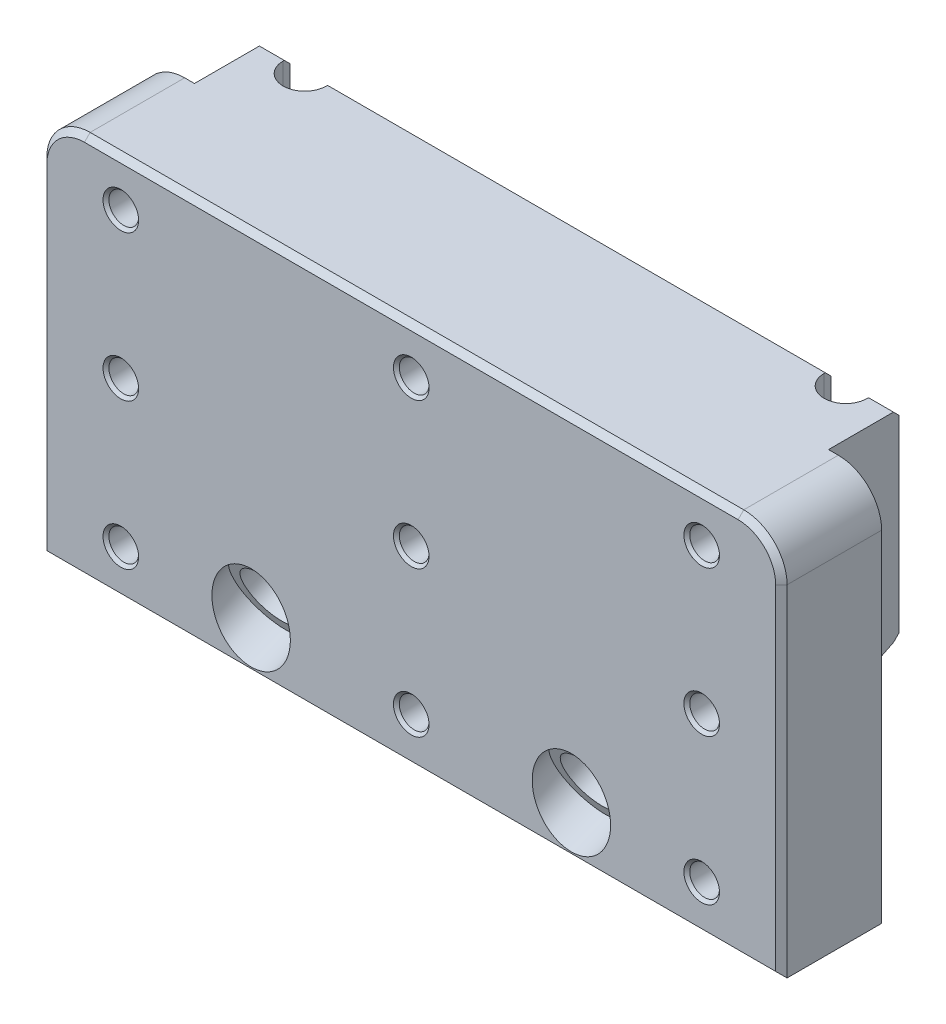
ISO-10303-21;
HEADER;
FILE_DESCRIPTION(('STEP AP214'),'2;1');
FILE_NAME('part.step','',(''),(''),'','','');
FILE_SCHEMA(('AUTOMOTIVE_DESIGN { 1 0 10303 214 1 1 1 1 }'));
ENDSEC;
DATA;
#1=APPLICATION_CONTEXT('core data for automotive mechanical design processes');
#2=APPLICATION_PROTOCOL_DEFINITION('international standard','automotive_design',2000,#1);
#3=PRODUCT_CONTEXT('',#1,'mechanical');
#4=PRODUCT('Part','Part','',(#3));
#5=PRODUCT_RELATED_PRODUCT_CATEGORY('part','',(#4));
#6=PRODUCT_DEFINITION_FORMATION('','',#4);
#7=PRODUCT_DEFINITION_CONTEXT('part definition',#1,'design');
#8=PRODUCT_DEFINITION('design','',#6,#7);
#9=PRODUCT_DEFINITION_SHAPE('','',#8);
#10=(LENGTH_UNIT() NAMED_UNIT(*) SI_UNIT(.MILLI.,.METRE.));
#11=(NAMED_UNIT(*) PLANE_ANGLE_UNIT() SI_UNIT($,.RADIAN.));
#12=(NAMED_UNIT(*) SI_UNIT($,.STERADIAN.) SOLID_ANGLE_UNIT());
#13=UNCERTAINTY_MEASURE_WITH_UNIT(LENGTH_MEASURE(1.E-05),#10,'distance_accuracy_value','');
#14=(GEOMETRIC_REPRESENTATION_CONTEXT(3) GLOBAL_UNCERTAINTY_ASSIGNED_CONTEXT((#13)) GLOBAL_UNIT_ASSIGNED_CONTEXT((#10,
#11,#12)) REPRESENTATION_CONTEXT('',''));
#15=CARTESIAN_POINT('',(0.,0.,0.));
#16=DIRECTION('',(0.,0.,1.));
#17=DIRECTION('',(1.,0.,0.));
#18=AXIS2_PLACEMENT_3D('',#15,#16,#17);
#19=CARTESIAN_POINT('',(0.,85.598,22.352));
#20=DIRECTION('',(0.,0.,-1.));
#21=DIRECTION('',(-1.,0.,0.));
#22=AXIS2_PLACEMENT_3D('',#19,#20,#21);
#23=PLANE('',#22);
#24=DIRECTION('',(0.999999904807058,-0.000436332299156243,0.));
#25=VECTOR('',#24,1.);
#26=CARTESIAN_POINT('',(68.738749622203,75.3092683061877,22.352));
#27=LINE('',#26,#25);
#28=CARTESIAN_POINT('',(68.7390036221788,75.3092681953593,22.352));
#29=VERTEX_POINT('',#28);
#30=CARTESIAN_POINT('',(68.738749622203,75.3092683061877,22.352));
#31=VERTEX_POINT('',#30);
#32=EDGE_CURVE('E643',#29,#31,#27,.F.);
#33=ORIENTED_EDGE('',*,*,#32,.F.);
#34=CARTESIAN_POINT('',(64.77,75.311,22.352));
#35=DIRECTION('',(0.,0.,1.));
#36=DIRECTION('',(1.,0.,0.));
#37=AXIS2_PLACEMENT_3D('',#34,#35,#36);
#38=CIRCLE('',#37,3.969004);
#39=CARTESIAN_POINT('',(68.739004,75.311,22.352));
#40=VERTEX_POINT('',#39);
#41=EDGE_CURVE('E594',#40,#29,#38,.T.);
#42=ORIENTED_EDGE('',*,*,#41,.F.);
#43=DIRECTION('',(1.,0.,0.));
#44=VECTOR('',#43,1.);
#45=CARTESIAN_POINT('',(68.73875,75.311,22.352));
#46=LINE('',#45,#44);
#47=CARTESIAN_POINT('',(68.73875,75.311,22.352));
#48=VERTEX_POINT('',#47);
#49=EDGE_CURVE('E40',#40,#48,#46,.F.);
#50=ORIENTED_EDGE('',*,*,#49,.T.);
#51=CARTESIAN_POINT('',(64.77,75.311,22.352));
#52=DIRECTION('',(0.,0.,-1.));
#53=DIRECTION('',(-1.,0.,0.));
#54=AXIS2_PLACEMENT_3D('',#51,#52,#53);
#55=CIRCLE('',#54,3.96875);
#56=EDGE_CURVE('E650',#48,#31,#55,.T.);
#57=ORIENTED_EDGE('',*,*,#56,.T.);
#58=EDGE_LOOP('',(#33,#42,#50,#57));
#59=FACE_BOUND('',#58,.T.);
#60=DIRECTION('',(0.999999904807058,-0.000436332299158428,0.));
#61=VECTOR('',#60,1.);
#62=CARTESIAN_POINT('',(3.96874962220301,10.2852683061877,22.352));
#63=LINE('',#62,#61);
#64=CARTESIAN_POINT('',(3.96900362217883,10.2852681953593,22.352));
#65=VERTEX_POINT('',#64);
#66=CARTESIAN_POINT('',(3.96874962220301,10.2852683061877,22.352));
#67=VERTEX_POINT('',#66);
#68=EDGE_CURVE('E1256',#65,#67,#63,.F.);
#69=ORIENTED_EDGE('',*,*,#68,.F.);
#70=CARTESIAN_POINT('',(0.,10.287,22.352));
#71=DIRECTION('',(0.,0.,1.));
#72=DIRECTION('',(1.,0.,0.));
#73=AXIS2_PLACEMENT_3D('',#70,#71,#72);
#74=CIRCLE('',#73,3.969004);
#75=CARTESIAN_POINT('',(3.969004,10.287,22.352));
#76=VERTEX_POINT('',#75);
#77=EDGE_CURVE('E1181',#76,#65,#74,.T.);
#78=ORIENTED_EDGE('',*,*,#77,.F.);
#79=DIRECTION('',(1.,0.,0.));
#80=VECTOR('',#79,1.);
#81=CARTESIAN_POINT('',(3.96875,10.287,22.352));
#82=LINE('',#81,#80);
#83=CARTESIAN_POINT('',(3.96875,10.287,22.352));
#84=VERTEX_POINT('',#83);
#85=EDGE_CURVE('E1247',#76,#84,#82,.F.);
#86=ORIENTED_EDGE('',*,*,#85,.T.);
#87=CARTESIAN_POINT('',(0.,10.287,22.352));
#88=DIRECTION('',(0.,0.,-1.));
#89=DIRECTION('',(-1.,0.,0.));
#90=AXIS2_PLACEMENT_3D('',#87,#88,#89);
#91=CIRCLE('',#90,3.96875);
#92=EDGE_CURVE('E1260',#84,#67,#91,.T.);
#93=ORIENTED_EDGE('',*,*,#92,.T.);
#94=EDGE_LOOP('',(#69,#78,#86,#93));
#95=FACE_BOUND('',#94,.T.);
#96=DIRECTION('',(0.999999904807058,-0.000436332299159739,0.));
#97=VECTOR('',#96,1.);
#98=CARTESIAN_POINT('',(3.96874962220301,75.3092683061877,22.352));
#99=LINE('',#98,#97);
#100=CARTESIAN_POINT('',(3.96900362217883,75.3092681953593,22.352));
#101=VERTEX_POINT('',#100);
#102=CARTESIAN_POINT('',(3.96874962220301,75.3092683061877,22.352));
#103=VERTEX_POINT('',#102);
#104=EDGE_CURVE('E3165',#101,#103,#99,.F.);
#105=ORIENTED_EDGE('',*,*,#104,.F.);
#106=CARTESIAN_POINT('',(0.,75.311,22.352));
#107=DIRECTION('',(0.,0.,1.));
#108=DIRECTION('',(1.,0.,0.));
#109=AXIS2_PLACEMENT_3D('',#106,#107,#108);
#110=CIRCLE('',#109,3.969004);
#111=CARTESIAN_POINT('',(3.969004,75.311,22.352));
#112=VERTEX_POINT('',#111);
#113=EDGE_CURVE('E3097',#112,#101,#110,.T.);
#114=ORIENTED_EDGE('',*,*,#113,.F.);
#115=DIRECTION('',(1.,0.,0.));
#116=VECTOR('',#115,1.);
#117=CARTESIAN_POINT('',(3.96875,75.311,22.352));
#118=LINE('',#117,#116);
#119=CARTESIAN_POINT('',(3.96875,75.311,22.352));
#120=VERTEX_POINT('',#119);
#121=EDGE_CURVE('E3058',#112,#120,#118,.F.);
#122=ORIENTED_EDGE('',*,*,#121,.T.);
#123=CARTESIAN_POINT('',(0.,75.311,22.352));
#124=DIRECTION('',(0.,0.,-1.));
#125=DIRECTION('',(-1.,0.,0.));
#126=AXIS2_PLACEMENT_3D('',#123,#124,#125);
#127=CIRCLE('',#126,3.96875);
#128=EDGE_CURVE('E2948',#120,#103,#127,.T.);
#129=ORIENTED_EDGE('',*,*,#128,.T.);
#130=EDGE_LOOP('',(#105,#114,#122,#129));
#131=FACE_BOUND('',#130,.T.);
#132=DIRECTION('',(0.999999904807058,-0.000436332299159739,0.));
#133=VECTOR('',#132,1.);
#134=CARTESIAN_POINT('',(-60.801250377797,42.7972683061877,22.352));
#135=LINE('',#134,#133);
#136=CARTESIAN_POINT('',(-60.8009963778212,42.7972681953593,22.352));
#137=VERTEX_POINT('',#136);
#138=CARTESIAN_POINT('',(-60.801250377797,42.7972683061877,22.352));
#139=VERTEX_POINT('',#138);
#140=EDGE_CURVE('E2908',#137,#139,#135,.F.);
#141=ORIENTED_EDGE('',*,*,#140,.F.);
#142=CARTESIAN_POINT('',(-64.77,42.799,22.352));
#143=DIRECTION('',(0.,0.,1.));
#144=DIRECTION('',(1.,0.,0.));
#145=AXIS2_PLACEMENT_3D('',#142,#143,#144);
#146=CIRCLE('',#145,3.969004);
#147=CARTESIAN_POINT('',(-60.800996,42.799,22.352));
#148=VERTEX_POINT('',#147);
#149=EDGE_CURVE('E2987',#148,#137,#146,.T.);
#150=ORIENTED_EDGE('',*,*,#149,.F.);
#151=DIRECTION('',(1.,0.,0.));
#152=VECTOR('',#151,1.);
#153=CARTESIAN_POINT('',(-60.80125,42.799,22.352));
#154=LINE('',#153,#152);
#155=CARTESIAN_POINT('',(-60.80125,42.799,22.352));
#156=VERTEX_POINT('',#155);
#157=EDGE_CURVE('E2940',#148,#156,#154,.F.);
#158=ORIENTED_EDGE('',*,*,#157,.T.);
#159=CARTESIAN_POINT('',(-64.77,42.799,22.352));
#160=DIRECTION('',(0.,0.,-1.));
#161=DIRECTION('',(-1.,0.,0.));
#162=AXIS2_PLACEMENT_3D('',#159,#160,#161);
#163=CIRCLE('',#162,3.96875);
#164=EDGE_CURVE('E975',#156,#139,#163,.T.);
#165=ORIENTED_EDGE('',*,*,#164,.T.);
#166=EDGE_LOOP('',(#141,#150,#158,#165));
#167=FACE_BOUND('',#166,.T.);
#168=CARTESIAN_POINT('',(-35.7124,11.0730822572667,22.352));
#169=DIRECTION('',(0.,0.,-1.));
#170=DIRECTION('',(0.,1.,0.));
#171=AXIS2_PLACEMENT_3D('',#168,#169,#170);
#172=ELLIPSE('',#171,9.49218243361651,8.7376);
#173=CARTESIAN_POINT('',(-35.7124,20.5652646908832,22.352));
#174=VERTEX_POINT('',#173);
#175=EDGE_CURVE('E821',#174,#174,#172,.F.);
#176=ORIENTED_EDGE('',*,*,#175,.F.);
#177=EDGE_LOOP('',(#176));
#178=FACE_BOUND('',#177,.T.);
#179=CARTESIAN_POINT('',(35.7124,11.0730822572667,22.352));
#180=DIRECTION('',(0.,0.,-1.));
#181=DIRECTION('',(0.,1.,0.));
#182=AXIS2_PLACEMENT_3D('',#179,#180,#181);
#183=ELLIPSE('',#182,9.49218243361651,8.7376);
#184=CARTESIAN_POINT('',(35.7124,20.5652646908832,22.352));
#185=VERTEX_POINT('',#184);
#186=EDGE_CURVE('E1090',#185,#185,#183,.F.);
#187=ORIENTED_EDGE('',*,*,#186,.F.);
#188=EDGE_LOOP('',(#187));
#189=FACE_BOUND('',#188,.T.);
#190=DIRECTION('',(1.,0.,0.));
#191=VECTOR('',#190,1.);
#192=CARTESIAN_POINT('',(82.5373,1.27,22.352));
#193=LINE('',#192,#191);
#194=CARTESIAN_POINT('',(-81.2673,1.27,22.352));
#195=VERTEX_POINT('',#194);
#196=CARTESIAN_POINT('',(81.2673,1.27,22.352));
#197=VERTEX_POINT('',#196);
#198=EDGE_CURVE('E903',#195,#197,#193,.T.);
#199=ORIENTED_EDGE('',*,*,#198,.T.);
#200=DIRECTION('',(0.,1.,0.));
#201=VECTOR('',#200,1.);
#202=CARTESIAN_POINT('',(81.2673,85.598,22.352));
#203=LINE('',#202,#201);
#204=CARTESIAN_POINT('',(81.2673,75.946,22.352));
#205=VERTEX_POINT('',#204);
#206=EDGE_CURVE('E910',#197,#205,#203,.T.);
#207=ORIENTED_EDGE('',*,*,#206,.T.);
#208=CARTESIAN_POINT('',(72.8853,75.946,22.352));
#209=DIRECTION('',(0.,0.,-1.));
#210=DIRECTION('',(-1.,0.,0.));
#211=AXIS2_PLACEMENT_3D('',#208,#209,#210);
#212=CIRCLE('',#211,8.382);
#213=CARTESIAN_POINT('',(72.8853,84.328,22.352));
#214=VERTEX_POINT('',#213);
#215=EDGE_CURVE('E908',#205,#214,#212,.F.);
#216=ORIENTED_EDGE('',*,*,#215,.T.);
#217=DIRECTION('',(-1.,0.,0.));
#218=VECTOR('',#217,1.);
#219=CARTESIAN_POINT('',(0.,84.328,22.352));
#220=LINE('',#219,#218);
#221=CARTESIAN_POINT('',(-72.8853,84.328,22.352));
#222=VERTEX_POINT('',#221);
#223=EDGE_CURVE('E906',#214,#222,#220,.T.);
#224=ORIENTED_EDGE('',*,*,#223,.T.);
#225=CARTESIAN_POINT('',(-72.8853,75.946,22.352));
#226=DIRECTION('',(0.,0.,-1.));
#227=DIRECTION('',(-1.,0.,0.));
#228=AXIS2_PLACEMENT_3D('',#225,#226,#227);
#229=CIRCLE('',#228,8.382);
#230=CARTESIAN_POINT('',(-81.2673,75.946,22.352));
#231=VERTEX_POINT('',#230);
#232=EDGE_CURVE('E901',#222,#231,#229,.F.);
#233=ORIENTED_EDGE('',*,*,#232,.T.);
#234=DIRECTION('',(0.,-1.,0.));
#235=VECTOR('',#234,1.);
#236=CARTESIAN_POINT('',(-81.2673,0.,22.352));
#237=LINE('',#236,#235);
#238=EDGE_CURVE('E899',#231,#195,#237,.T.);
#239=ORIENTED_EDGE('',*,*,#238,.T.);
#240=EDGE_LOOP('',(#199,#207,#216,#224,#233,#239));
#241=FACE_BOUND('',#240,.T.);
#242=DIRECTION('',(0.999999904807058,-0.00043633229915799,0.));
#243=VECTOR('',#242,1.);
#244=CARTESIAN_POINT('',(-60.801250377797,10.2852683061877,22.352));
#245=LINE('',#244,#243);
#246=CARTESIAN_POINT('',(-60.8009963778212,10.2852681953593,22.352));
#247=VERTEX_POINT('',#246);
#248=CARTESIAN_POINT('',(-60.801250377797,10.2852683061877,22.352));
#249=VERTEX_POINT('',#248);
#250=EDGE_CURVE('E990',#247,#249,#245,.F.);
#251=ORIENTED_EDGE('',*,*,#250,.F.);
#252=CARTESIAN_POINT('',(-64.77,10.287,22.352));
#253=DIRECTION('',(0.,0.,1.));
#254=DIRECTION('',(1.,0.,0.));
#255=AXIS2_PLACEMENT_3D('',#252,#253,#254);
#256=CIRCLE('',#255,3.969004);
#257=CARTESIAN_POINT('',(-60.800996,10.287,22.352));
#258=VERTEX_POINT('',#257);
#259=EDGE_CURVE('E2887',#258,#247,#256,.T.);
#260=ORIENTED_EDGE('',*,*,#259,.F.);
#261=DIRECTION('',(1.,0.,0.));
#262=VECTOR('',#261,1.);
#263=CARTESIAN_POINT('',(-60.80125,10.287,22.352));
#264=LINE('',#263,#262);
#265=CARTESIAN_POINT('',(-60.80125,10.287,22.352));
#266=VERTEX_POINT('',#265);
#267=EDGE_CURVE('E994',#258,#266,#264,.F.);
#268=ORIENTED_EDGE('',*,*,#267,.T.);
#269=CARTESIAN_POINT('',(-64.77,10.287,22.352));
#270=DIRECTION('',(0.,0.,-1.));
#271=DIRECTION('',(-1.,0.,0.));
#272=AXIS2_PLACEMENT_3D('',#269,#270,#271);
#273=CIRCLE('',#272,3.96875);
#274=EDGE_CURVE('E956',#266,#249,#273,.T.);
#275=ORIENTED_EDGE('',*,*,#274,.T.);
#276=EDGE_LOOP('',(#251,#260,#268,#275));
#277=FACE_BOUND('',#276,.T.);
#278=DIRECTION('',(0.999999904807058,-0.00043633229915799,0.));
#279=VECTOR('',#278,1.);
#280=CARTESIAN_POINT('',(3.96874962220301,42.7972683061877,22.352));
#281=LINE('',#280,#279);
#282=CARTESIAN_POINT('',(3.96900362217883,42.7972681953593,22.352));
#283=VERTEX_POINT('',#282);
#284=CARTESIAN_POINT('',(3.96874962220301,42.7972683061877,22.352));
#285=VERTEX_POINT('',#284);
#286=EDGE_CURVE('E1158',#283,#285,#281,.F.);
#287=ORIENTED_EDGE('',*,*,#286,.F.);
#288=CARTESIAN_POINT('',(0.,42.799,22.352));
#289=DIRECTION('',(0.,0.,1.));
#290=DIRECTION('',(1.,0.,0.));
#291=AXIS2_PLACEMENT_3D('',#288,#289,#290);
#292=CIRCLE('',#291,3.969004);
#293=CARTESIAN_POINT('',(3.969004,42.799,22.352));
#294=VERTEX_POINT('',#293);
#295=EDGE_CURVE('E3142',#294,#283,#292,.T.);
#296=ORIENTED_EDGE('',*,*,#295,.F.);
#297=DIRECTION('',(1.,0.,0.));
#298=VECTOR('',#297,1.);
#299=CARTESIAN_POINT('',(3.96875,42.799,22.352));
#300=LINE('',#299,#298);
#301=CARTESIAN_POINT('',(3.96875,42.799,22.352));
#302=VERTEX_POINT('',#301);
#303=EDGE_CURVE('E2965',#294,#302,#300,.F.);
#304=ORIENTED_EDGE('',*,*,#303,.T.);
#305=CARTESIAN_POINT('',(0.,42.799,22.352));
#306=DIRECTION('',(0.,0.,-1.));
#307=DIRECTION('',(-1.,0.,0.));
#308=AXIS2_PLACEMENT_3D('',#305,#306,#307);
#309=CIRCLE('',#308,3.96875);
#310=EDGE_CURVE('E2946',#302,#285,#309,.T.);
#311=ORIENTED_EDGE('',*,*,#310,.T.);
#312=EDGE_LOOP('',(#287,#296,#304,#311));
#313=FACE_BOUND('',#312,.T.);
#314=DIRECTION('',(0.999999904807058,-0.000436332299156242,0.));
#315=VECTOR('',#314,1.);
#316=CARTESIAN_POINT('',(-60.801250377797,75.3092683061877,22.352));
#317=LINE('',#316,#315);
#318=CARTESIAN_POINT('',(-60.8009963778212,75.3092681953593,22.352));
#319=VERTEX_POINT('',#318);
#320=CARTESIAN_POINT('',(-60.801250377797,75.3092683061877,22.352));
#321=VERTEX_POINT('',#320);
#322=EDGE_CURVE('E1164',#319,#321,#317,.F.);
#323=ORIENTED_EDGE('',*,*,#322,.F.);
#324=CARTESIAN_POINT('',(-64.77,75.311,22.352));
#325=DIRECTION('',(0.,0.,1.));
#326=DIRECTION('',(1.,0.,0.));
#327=AXIS2_PLACEMENT_3D('',#324,#325,#326);
#328=CIRCLE('',#327,3.969004);
#329=CARTESIAN_POINT('',(-60.800996,75.311,22.352));
#330=VERTEX_POINT('',#329);
#331=EDGE_CURVE('E3240',#330,#319,#328,.T.);
#332=ORIENTED_EDGE('',*,*,#331,.F.);
#333=DIRECTION('',(1.,0.,0.));
#334=VECTOR('',#333,1.);
#335=CARTESIAN_POINT('',(-60.80125,75.311,22.352));
#336=LINE('',#335,#334);
#337=CARTESIAN_POINT('',(-60.80125,75.311,22.352));
#338=VERTEX_POINT('',#337);
#339=EDGE_CURVE('E3076',#330,#338,#336,.F.);
#340=ORIENTED_EDGE('',*,*,#339,.T.);
#341=CARTESIAN_POINT('',(-64.77,75.311,22.352));
#342=DIRECTION('',(0.,0.,-1.));
#343=DIRECTION('',(-1.,0.,0.));
#344=AXIS2_PLACEMENT_3D('',#341,#342,#343);
#345=CIRCLE('',#344,3.96875);
#346=EDGE_CURVE('E3051',#338,#321,#345,.T.);
#347=ORIENTED_EDGE('',*,*,#346,.T.);
#348=EDGE_LOOP('',(#323,#332,#340,#347));
#349=FACE_BOUND('',#348,.T.);
#350=DIRECTION('',(0.999999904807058,-0.000436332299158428,0.));
#351=VECTOR('',#350,1.);
#352=CARTESIAN_POINT('',(68.738749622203,10.2852683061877,22.352));
#353=LINE('',#352,#351);
#354=CARTESIAN_POINT('',(68.7390036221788,10.2852681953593,22.352));
#355=VERTEX_POINT('',#354);
#356=CARTESIAN_POINT('',(68.738749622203,10.2852683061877,22.352));
#357=VERTEX_POINT('',#356);
#358=EDGE_CURVE('E1169',#355,#357,#353,.F.);
#359=ORIENTED_EDGE('',*,*,#358,.F.);
#360=CARTESIAN_POINT('',(64.77,10.287,22.352));
#361=DIRECTION('',(0.,0.,1.));
#362=DIRECTION('',(1.,0.,0.));
#363=AXIS2_PLACEMENT_3D('',#360,#361,#362);
#364=CIRCLE('',#363,3.969004);
#365=CARTESIAN_POINT('',(68.739004,10.287,22.352));
#366=VERTEX_POINT('',#365);
#367=EDGE_CURVE('E1172',#366,#355,#364,.T.);
#368=ORIENTED_EDGE('',*,*,#367,.F.);
#369=DIRECTION('',(1.,0.,0.));
#370=VECTOR('',#369,1.);
#371=CARTESIAN_POINT('',(68.73875,10.287,22.352));
#372=LINE('',#371,#370);
#373=CARTESIAN_POINT('',(68.73875,10.287,22.352));
#374=VERTEX_POINT('',#373);
#375=EDGE_CURVE('E1178',#366,#374,#372,.F.);
#376=ORIENTED_EDGE('',*,*,#375,.T.);
#377=CARTESIAN_POINT('',(64.77,10.287,22.352));
#378=DIRECTION('',(0.,0.,-1.));
#379=DIRECTION('',(-1.,0.,0.));
#380=AXIS2_PLACEMENT_3D('',#377,#378,#379);
#381=CIRCLE('',#380,3.96875);
#382=EDGE_CURVE('E649',#374,#357,#381,.T.);
#383=ORIENTED_EDGE('',*,*,#382,.T.);
#384=EDGE_LOOP('',(#359,#368,#376,#383));
#385=FACE_BOUND('',#384,.T.);
#386=DIRECTION('',(0.999999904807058,-0.000436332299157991,0.));
#387=VECTOR('',#386,1.);
#388=CARTESIAN_POINT('',(68.738749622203,42.7972683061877,22.352));
#389=LINE('',#388,#387);
#390=CARTESIAN_POINT('',(68.7390036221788,42.7972681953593,22.352));
#391=VERTEX_POINT('',#390);
#392=CARTESIAN_POINT('',(68.738749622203,42.7972683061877,22.352));
#393=VERTEX_POINT('',#392);
#394=EDGE_CURVE('E616',#391,#393,#389,.F.);
#395=ORIENTED_EDGE('',*,*,#394,.F.);
#396=CARTESIAN_POINT('',(64.77,42.799,22.352));
#397=DIRECTION('',(0.,0.,1.));
#398=DIRECTION('',(1.,0.,0.));
#399=AXIS2_PLACEMENT_3D('',#396,#397,#398);
#400=CIRCLE('',#399,3.969004);
#401=CARTESIAN_POINT('',(68.739004,42.799,22.352));
#402=VERTEX_POINT('',#401);
#403=EDGE_CURVE('E678',#402,#391,#400,.T.);
#404=ORIENTED_EDGE('',*,*,#403,.F.);
#405=DIRECTION('',(1.,0.,0.));
#406=VECTOR('',#405,1.);
#407=CARTESIAN_POINT('',(68.73875,42.799,22.352));
#408=LINE('',#407,#406);
#409=CARTESIAN_POINT('',(68.73875,42.799,22.352));
#410=VERTEX_POINT('',#409);
#411=EDGE_CURVE('E19',#402,#410,#408,.F.);
#412=ORIENTED_EDGE('',*,*,#411,.T.);
#413=CARTESIAN_POINT('',(64.77,42.799,22.352));
#414=DIRECTION('',(0.,0.,-1.));
#415=DIRECTION('',(-1.,0.,0.));
#416=AXIS2_PLACEMENT_3D('',#413,#414,#415);
#417=CIRCLE('',#416,3.96875);
#418=EDGE_CURVE('E646',#410,#393,#417,.T.);
#419=ORIENTED_EDGE('',*,*,#418,.T.);
#420=EDGE_LOOP('',(#395,#404,#412,#419));
#421=FACE_BOUND('',#420,.T.);
#422=ADVANCED_FACE('F15',(#59,#95,#131,#167,#178,#189,#241,#277,#313,#349,#385,#421),#23,.F.);
#423=CARTESIAN_POINT('',(70.7009,85.598,-15.748));
#424=DIRECTION('',(0.,0.,1.));
#425=DIRECTION('',(1.,0.,0.));
#426=AXIS2_PLACEMENT_3D('',#423,#424,#425);
#427=PLANE('',#426);
#428=DIRECTION('',(0.,1.,0.));
#429=VECTOR('',#428,1.);
#430=CARTESIAN_POINT('',(-55.499,85.598,-15.748));
#431=LINE('',#430,#429);
#432=CARTESIAN_POINT('',(-55.499,42.3652821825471,-15.748));
#433=VERTEX_POINT('',#432);
#434=CARTESIAN_POINT('',(-55.499,84.328,-15.748));
#435=VERTEX_POINT('',#434);
#436=EDGE_CURVE('E1065',#433,#435,#431,.T.);
#437=ORIENTED_EDGE('',*,*,#436,.T.);
#438=DIRECTION('',(1.,0.,0.));
#439=VECTOR('',#438,1.);
#440=CARTESIAN_POINT('',(70.7009,84.328,-15.748));
#441=LINE('',#440,#439);
#442=CARTESIAN_POINT('',(55.499,84.328,-15.748));
#443=VERTEX_POINT('',#442);
#444=EDGE_CURVE('E939',#435,#443,#441,.T.);
#445=ORIENTED_EDGE('',*,*,#444,.T.);
#446=DIRECTION('',(0.,-1.,0.));
#447=VECTOR('',#446,1.);
#448=CARTESIAN_POINT('',(55.499,85.598,-15.748));
#449=LINE('',#448,#447);
#450=CARTESIAN_POINT('',(55.499,42.3652821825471,-15.748));
#451=VERTEX_POINT('',#450);
#452=EDGE_CURVE('E1083',#443,#451,#449,.T.);
#453=ORIENTED_EDGE('',*,*,#452,.T.);
#454=DIRECTION('',(-1.,0.,0.));
#455=VECTOR('',#454,1.);
#456=CARTESIAN_POINT('',(70.7009,42.3652821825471,-15.748));
#457=LINE('',#456,#455);
#458=EDGE_CURVE('E880',#451,#433,#457,.T.);
#459=ORIENTED_EDGE('',*,*,#458,.T.);
#460=EDGE_LOOP('',(#437,#445,#453,#459));
#461=FACE_BOUND('',#460,.T.);
#462=ADVANCED_FACE('F715',(#461),#427,.F.);
#463=DIRECTION('',(0.,-1.,0.));
#464=VECTOR('',#463,1.);
#465=CARTESIAN_POINT('',(-70.7009,85.598,-15.748));
#466=LINE('',#465,#464);
#467=CARTESIAN_POINT('',(-70.7009,84.328,-15.748));
#468=VERTEX_POINT('',#467);
#469=CARTESIAN_POINT('',(-70.7009,42.3652821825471,-15.748));
#470=VERTEX_POINT('',#469);
#471=EDGE_CURVE('E1107',#468,#470,#466,.T.);
#472=ORIENTED_EDGE('',*,*,#471,.F.);
#473=DIRECTION('',(1.,0.,0.));
#474=VECTOR('',#473,1.);
#475=CARTESIAN_POINT('',(70.7009,84.328,-15.748));
#476=LINE('',#475,#474);
#477=CARTESIAN_POINT('',(-65.151,84.328,-15.748));
#478=VERTEX_POINT('',#477);
#479=EDGE_CURVE('E933',#468,#478,#476,.T.);
#480=ORIENTED_EDGE('',*,*,#479,.T.);
#481=DIRECTION('',(0.,-1.,0.));
#482=VECTOR('',#481,1.);
#483=CARTESIAN_POINT('',(-65.151,85.598,-15.748));
#484=LINE('',#483,#482);
#485=CARTESIAN_POINT('',(-65.151,42.3652821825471,-15.748));
#486=VERTEX_POINT('',#485);
#487=EDGE_CURVE('E1063',#478,#486,#484,.T.);
#488=ORIENTED_EDGE('',*,*,#487,.T.);
#489=DIRECTION('',(-1.,0.,0.));
#490=VECTOR('',#489,1.);
#491=CARTESIAN_POINT('',(70.7009,42.3652821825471,-15.748));
#492=LINE('',#491,#490);
#493=EDGE_CURVE('E866',#486,#470,#492,.T.);
#494=ORIENTED_EDGE('',*,*,#493,.T.);
#495=EDGE_LOOP('',(#472,#480,#488,#494));
#496=FACE_BOUND('',#495,.T.);
#497=ADVANCED_FACE('F721',(#496),#427,.F.);
#498=CARTESIAN_POINT('',(-82.5373,0.,22.352));
#499=DIRECTION('',(0.,-1.,0.));
#500=DIRECTION('',(0.,0.,-1.));
#501=AXIS2_PLACEMENT_3D('',#498,#499,#500);
#502=PLANE('',#501);
#503=DIRECTION('',(0.,0.,-1.));
#504=VECTOR('',#503,1.);
#505=CARTESIAN_POINT('',(82.5373,0.,22.352));
#506=LINE('',#505,#504);
#507=CARTESIAN_POINT('',(82.5373,0.,21.082));
#508=VERTEX_POINT('',#507);
#509=CARTESIAN_POINT('',(82.5373,0.,0.));
#510=VERTEX_POINT('',#509);
#511=EDGE_CURVE('E838',#508,#510,#506,.T.);
#512=ORIENTED_EDGE('',*,*,#511,.F.);
#513=DIRECTION('',(-1.,0.,0.));
#514=VECTOR('',#513,1.);
#515=CARTESIAN_POINT('',(-82.5373,0.,21.082));
#516=LINE('',#515,#514);
#517=CARTESIAN_POINT('',(-82.5373,0.,21.082));
#518=VERTEX_POINT('',#517);
#519=EDGE_CURVE('E896',#508,#518,#516,.T.);
#520=ORIENTED_EDGE('',*,*,#519,.T.);
#521=DIRECTION('',(0.,0.,-1.));
#522=VECTOR('',#521,1.);
#523=CARTESIAN_POINT('',(-82.5373,0.,22.352));
#524=LINE('',#523,#522);
#525=CARTESIAN_POINT('',(-82.5373,0.,0.));
#526=VERTEX_POINT('',#525);
#527=EDGE_CURVE('E842',#518,#526,#524,.T.);
#528=ORIENTED_EDGE('',*,*,#527,.T.);
#529=DIRECTION('',(-1.,0.,0.));
#530=VECTOR('',#529,1.);
#531=CARTESIAN_POINT('',(82.5373,0.,0.));
#532=LINE('',#531,#530);
#533=EDGE_CURVE('E841',#510,#526,#532,.T.);
#534=ORIENTED_EDGE('',*,*,#533,.F.);
#535=EDGE_LOOP('',(#512,#520,#528,#534));
#536=FACE_BOUND('',#535,.T.);
#537=ADVANCED_FACE('F749',(#536),#502,.T.);
#538=CARTESIAN_POINT('',(-70.7009,85.598,0.));
#539=DIRECTION('',(-1.,0.,0.));
#540=DIRECTION('',(0.,0.,1.));
#541=AXIS2_PLACEMENT_3D('',#538,#539,#540);
#542=PLANE('',#541);
#543=DIRECTION('',(0.,0.,1.));
#544=VECTOR('',#543,1.);
#545=CARTESIAN_POINT('',(-70.7009,85.598,0.));
#546=LINE('',#545,#544);
#547=CARTESIAN_POINT('',(-70.7009,85.598,-14.478));
#548=VERTEX_POINT('',#547);
#549=CARTESIAN_POINT('',(-70.7009,85.598,0.));
#550=VERTEX_POINT('',#549);
#551=EDGE_CURVE('E1057',#548,#550,#546,.T.);
#552=ORIENTED_EDGE('',*,*,#551,.F.);
#553=DIRECTION('',(0.,0.707106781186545,0.707106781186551));
#554=VECTOR('',#553,1.);
#555=CARTESIAN_POINT('',(-70.7009,92.837,-7.239));
#556=LINE('',#555,#554);
#557=EDGE_CURVE('E931',#548,#468,#556,.F.);
#558=ORIENTED_EDGE('',*,*,#557,.T.);
#559=ORIENTED_EDGE('',*,*,#471,.T.);
#560=DIRECTION('',(0.,0.707106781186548,-0.707106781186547));
#561=VECTOR('',#560,1.);
#562=CARTESIAN_POINT('',(-70.7009,56.1076410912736,-29.4903589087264));
#563=LINE('',#562,#561);
#564=CARTESIAN_POINT('',(-70.7009,41.1009034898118,-14.4836213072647));
#565=VERTEX_POINT('',#564);
#566=EDGE_CURVE('E869',#470,#565,#563,.F.);
#567=ORIENTED_EDGE('',*,*,#566,.T.);
#568=DIRECTION('',(0.,0.438371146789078,-0.898794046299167));
#569=VECTOR('',#568,1.);
#570=CARTESIAN_POINT('',(-70.7009,43.9452530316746,-20.3154020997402));
#571=LINE('',#570,#569);
#572=CARTESIAN_POINT('',(-70.7009,34.7325381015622,-1.42653728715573));
#573=VERTEX_POINT('',#572);
#574=EDGE_CURVE('E844',#573,#565,#571,.T.);
#575=ORIENTED_EDGE('',*,*,#574,.F.);
#576=CARTESIAN_POINT('',(-70.7009,32.4496012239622,-2.54));
#577=DIRECTION('',(-1.,0.,0.));
#578=DIRECTION('',(0.,0.,1.));
#579=AXIS2_PLACEMENT_3D('',#576,#577,#578);
#580=CIRCLE('',#579,2.54);
#581=CARTESIAN_POINT('',(-70.7009,32.4496012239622,0.));
#582=VERTEX_POINT('',#581);
#583=EDGE_CURVE('E861',#573,#582,#580,.F.);
#584=ORIENTED_EDGE('',*,*,#583,.T.);
#585=DIRECTION('',(0.,-1.,0.));
#586=VECTOR('',#585,1.);
#587=CARTESIAN_POINT('',(-70.7009,85.598,0.));
#588=LINE('',#587,#586);
#589=EDGE_CURVE('E1105',#550,#582,#588,.T.);
#590=ORIENTED_EDGE('',*,*,#589,.F.);
#591=EDGE_LOOP('',(#552,#558,#559,#567,#575,#584,#590));
#592=FACE_BOUND('',#591,.T.);
#593=ADVANCED_FACE('F742',(#592),#542,.T.);
#594=CARTESIAN_POINT('',(70.7009,85.598,0.));
#595=DIRECTION('',(-1.,0.,0.));
#596=DIRECTION('',(0.,0.,1.));
#597=AXIS2_PLACEMENT_3D('',#594,#595,#596);
#598=PLANE('',#597);
#599=DIRECTION('',(0.,-1.,0.));
#600=VECTOR('',#599,1.);
#601=CARTESIAN_POINT('',(70.7009,85.598,-15.748));
#602=LINE('',#601,#600);
#603=CARTESIAN_POINT('',(70.7009,84.328,-15.748));
#604=VERTEX_POINT('',#603);
#605=CARTESIAN_POINT('',(70.7009,42.3652821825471,-15.748));
#606=VERTEX_POINT('',#605);
#607=EDGE_CURVE('E1109',#604,#606,#602,.T.);
#608=ORIENTED_EDGE('',*,*,#607,.F.);
#609=DIRECTION('',(0.,-0.707106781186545,-0.707106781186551));
#610=VECTOR('',#609,1.);
#611=CARTESIAN_POINT('',(70.7009,85.598,-14.478));
#612=LINE('',#611,#610);
#613=CARTESIAN_POINT('',(70.7009,85.598,-14.478));
#614=VERTEX_POINT('',#613);
#615=EDGE_CURVE('E947',#604,#614,#612,.F.);
#616=ORIENTED_EDGE('',*,*,#615,.T.);
#617=DIRECTION('',(0.,0.,-1.));
#618=VECTOR('',#617,1.);
#619=CARTESIAN_POINT('',(70.7009,85.598,0.));
#620=LINE('',#619,#618);
#621=CARTESIAN_POINT('',(70.7009,85.598,0.));
#622=VERTEX_POINT('',#621);
#623=EDGE_CURVE('E1098',#622,#614,#620,.T.);
#624=ORIENTED_EDGE('',*,*,#623,.F.);
#625=DIRECTION('',(0.,-1.,0.));
#626=VECTOR('',#625,1.);
#627=CARTESIAN_POINT('',(70.7009,85.598,0.));
#628=LINE('',#627,#626);
#629=CARTESIAN_POINT('',(70.7009,32.4496012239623,0.));
#630=VERTEX_POINT('',#629);
#631=EDGE_CURVE('E1111',#622,#630,#628,.T.);
#632=ORIENTED_EDGE('',*,*,#631,.T.);
#633=CARTESIAN_POINT('',(70.7009,32.4496012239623,-2.54));
#634=DIRECTION('',(-1.,0.,0.));
#635=DIRECTION('',(0.,0.,1.));
#636=AXIS2_PLACEMENT_3D('',#633,#634,#635);
#637=CIRCLE('',#636,2.54);
#638=CARTESIAN_POINT('',(70.7009,34.7325381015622,-1.42653728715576));
#639=VERTEX_POINT('',#638);
#640=EDGE_CURVE('E864',#630,#639,#637,.T.);
#641=ORIENTED_EDGE('',*,*,#640,.T.);
#642=DIRECTION('',(0.,0.438371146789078,-0.898794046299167));
#643=VECTOR('',#642,1.);
#644=CARTESIAN_POINT('',(70.7009,43.9452530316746,-20.3154020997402));
#645=LINE('',#644,#643);
#646=CARTESIAN_POINT('',(70.7009,41.1009034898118,-14.4836213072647));
#647=VERTEX_POINT('',#646);
#648=EDGE_CURVE('E1087',#639,#647,#645,.T.);
#649=ORIENTED_EDGE('',*,*,#648,.T.);
#650=DIRECTION('',(0.,-0.707106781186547,0.707106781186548));
#651=VECTOR('',#650,1.);
#652=CARTESIAN_POINT('',(70.7009,42.3652821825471,-15.748));
#653=LINE('',#652,#651);
#654=EDGE_CURVE('E893',#647,#606,#653,.F.);
#655=ORIENTED_EDGE('',*,*,#654,.T.);
#656=EDGE_LOOP('',(#608,#616,#624,#632,#641,#649,#655));
#657=FACE_BOUND('',#656,.T.);
#658=ADVANCED_FACE('F740',(#657),#598,.F.);
#659=DIRECTION('',(0.,1.,0.));
#660=VECTOR('',#659,1.);
#661=CARTESIAN_POINT('',(65.151,85.598,-15.748));
#662=LINE('',#661,#660);
#663=CARTESIAN_POINT('',(65.151,42.3652821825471,-15.748));
#664=VERTEX_POINT('',#663);
#665=CARTESIAN_POINT('',(65.151,84.328,-15.748));
#666=VERTEX_POINT('',#665);
#667=EDGE_CURVE('E1078',#664,#666,#662,.T.);
#668=ORIENTED_EDGE('',*,*,#667,.T.);
#669=DIRECTION('',(1.,0.,0.));
#670=VECTOR('',#669,1.);
#671=CARTESIAN_POINT('',(70.7009,84.328,-15.748));
#672=LINE('',#671,#670);
#673=EDGE_CURVE('E945',#666,#604,#672,.T.);
#674=ORIENTED_EDGE('',*,*,#673,.T.);
#675=ORIENTED_EDGE('',*,*,#607,.T.);
#676=DIRECTION('',(-1.,0.,0.));
#677=VECTOR('',#676,1.);
#678=CARTESIAN_POINT('',(70.7009,42.3652821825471,-15.748));
#679=LINE('',#678,#677);
#680=EDGE_CURVE('E888',#606,#664,#679,.T.);
#681=ORIENTED_EDGE('',*,*,#680,.T.);
#682=EDGE_LOOP('',(#668,#674,#675,#681));
#683=FACE_BOUND('',#682,.T.);
#684=ADVANCED_FACE('F724',(#683),#427,.F.);
#685=CARTESIAN_POINT('',(-82.5373,85.598,22.352));
#686=DIRECTION('',(-1.,0.,0.));
#687=DIRECTION('',(0.,0.,1.));
#688=AXIS2_PLACEMENT_3D('',#685,#686,#687);
#689=PLANE('',#688);
#690=ORIENTED_EDGE('',*,*,#527,.F.);
#691=DIRECTION('',(0.,1.,0.));
#692=VECTOR('',#691,1.);
#693=CARTESIAN_POINT('',(-82.5373,75.946,21.082));
#694=LINE('',#693,#692);
#695=CARTESIAN_POINT('',(-82.5373,75.946,21.082));
#696=VERTEX_POINT('',#695);
#697=EDGE_CURVE('E929',#518,#696,#694,.T.);
#698=ORIENTED_EDGE('',*,*,#697,.T.);
#699=DIRECTION('',(0.,0.,-1.));
#700=VECTOR('',#699,1.);
#701=CARTESIAN_POINT('',(-82.5373,75.946,0.));
#702=LINE('',#701,#700);
#703=CARTESIAN_POINT('',(-82.5373,75.946,0.));
#704=VERTEX_POINT('',#703);
#705=EDGE_CURVE('E836',#696,#704,#702,.T.);
#706=ORIENTED_EDGE('',*,*,#705,.T.);
#707=DIRECTION('',(0.,-1.,0.));
#708=VECTOR('',#707,1.);
#709=CARTESIAN_POINT('',(-82.5373,85.598,0.));
#710=LINE('',#709,#708);
#711=EDGE_CURVE('E851',#704,#526,#710,.T.);
#712=ORIENTED_EDGE('',*,*,#711,.T.);
#713=EDGE_LOOP('',(#690,#698,#706,#712));
#714=FACE_BOUND('',#713,.T.);
#715=ADVANCED_FACE('F738',(#714),#689,.T.);
#716=CARTESIAN_POINT('',(82.5373,85.598,0.));
#717=DIRECTION('',(0.,0.,1.));
#718=DIRECTION('',(1.,0.,0.));
#719=AXIS2_PLACEMENT_3D('',#716,#717,#718);
#720=PLANE('',#719);
#721=CARTESIAN_POINT('',(-35.7124,20.5609433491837,0.));
#722=DIRECTION('',(0.,0.,1.));
#723=DIRECTION('',(0.,-1.,0.));
#724=AXIS2_PLACEMENT_3D('',#721,#722,#723);
#725=ELLIPSE('',#724,6.90528678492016,6.35635);
#726=CARTESIAN_POINT('',(-35.7124,13.6556565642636,0.));
#727=VERTEX_POINT('',#726);
#728=EDGE_CURVE('E817',#727,#727,#725,.T.);
#729=ORIENTED_EDGE('',*,*,#728,.T.);
#730=EDGE_LOOP('',(#729));
#731=FACE_BOUND('',#730,.T.);
#732=CARTESIAN_POINT('',(35.7124,20.5609433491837,0.));
#733=DIRECTION('',(0.,0.,1.));
#734=DIRECTION('',(0.,-1.,0.));
#735=AXIS2_PLACEMENT_3D('',#732,#733,#734);
#736=ELLIPSE('',#735,6.90528678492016,6.35635);
#737=CARTESIAN_POINT('',(35.7124,13.6556565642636,0.));
#738=VERTEX_POINT('',#737);
#739=EDGE_CURVE('E829',#738,#738,#736,.T.);
#740=ORIENTED_EDGE('',*,*,#739,.T.);
#741=EDGE_LOOP('',(#740));
#742=FACE_BOUND('',#741,.T.);
#743=ORIENTED_EDGE('',*,*,#589,.T.);
#744=DIRECTION('',(-1.,0.,0.));
#745=VECTOR('',#744,1.);
#746=CARTESIAN_POINT('',(70.7009,32.4496012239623,0.));
#747=LINE('',#746,#745);
#748=EDGE_CURVE('E857',#582,#630,#747,.F.);
#749=ORIENTED_EDGE('',*,*,#748,.T.);
#750=ORIENTED_EDGE('',*,*,#631,.F.);
#751=DIRECTION('',(-1.,0.,0.));
#752=VECTOR('',#751,1.);
#753=CARTESIAN_POINT('',(82.5373,85.598,0.));
#754=LINE('',#753,#752);
#755=CARTESIAN_POINT('',(72.8853,85.598,0.));
#756=VERTEX_POINT('',#755);
#757=EDGE_CURVE('E1095',#756,#622,#754,.T.);
#758=ORIENTED_EDGE('',*,*,#757,.F.);
#759=CARTESIAN_POINT('',(72.8853,75.946,0.));
#760=DIRECTION('',(0.,0.,1.));
#761=DIRECTION('',(1.,0.,0.));
#762=AXIS2_PLACEMENT_3D('',#759,#760,#761);
#763=CIRCLE('',#762,9.652);
#764=CARTESIAN_POINT('',(82.5373,75.946,0.));
#765=VERTEX_POINT('',#764);
#766=EDGE_CURVE('E837',#756,#765,#763,.F.);
#767=ORIENTED_EDGE('',*,*,#766,.T.);
#768=DIRECTION('',(0.,-1.,0.));
#769=VECTOR('',#768,1.);
#770=CARTESIAN_POINT('',(82.5373,85.598,0.));
#771=LINE('',#770,#769);
#772=EDGE_CURVE('E1097',#765,#510,#771,.T.);
#773=ORIENTED_EDGE('',*,*,#772,.T.);
#774=ORIENTED_EDGE('',*,*,#533,.T.);
#775=ORIENTED_EDGE('',*,*,#711,.F.);
#776=CARTESIAN_POINT('',(-72.8853,75.946,0.));
#777=DIRECTION('',(0.,0.,1.));
#778=DIRECTION('',(1.,0.,0.));
#779=AXIS2_PLACEMENT_3D('',#776,#777,#778);
#780=CIRCLE('',#779,9.652);
#781=CARTESIAN_POINT('',(-72.8853,85.598,0.));
#782=VERTEX_POINT('',#781);
#783=EDGE_CURVE('E853',#704,#782,#780,.F.);
#784=ORIENTED_EDGE('',*,*,#783,.T.);
#785=DIRECTION('',(1.,0.,0.));
#786=VECTOR('',#785,1.);
#787=CARTESIAN_POINT('',(-82.5373,85.598,0.));
#788=LINE('',#787,#786);
#789=EDGE_CURVE('E840',#782,#550,#788,.T.);
#790=ORIENTED_EDGE('',*,*,#789,.T.);
#791=EDGE_LOOP('',(#743,#749,#750,#758,#767,#773,#774,#775,#784,#790));
#792=FACE_BOUND('',#791,.T.);
#793=ADVANCED_FACE('F734',(#731,#742,#792),#720,.F.);
#794=CARTESIAN_POINT('',(82.5373,85.598,22.352));
#795=DIRECTION('',(-1.,0.,0.));
#796=DIRECTION('',(0.,0.,1.));
#797=AXIS2_PLACEMENT_3D('',#794,#795,#796);
#798=PLANE('',#797);
#799=DIRECTION('',(0.,0.,-1.));
#800=VECTOR('',#799,1.);
#801=CARTESIAN_POINT('',(82.5373,75.946,22.352));
#802=LINE('',#801,#800);
#803=CARTESIAN_POINT('',(82.5373,75.946,21.082));
#804=VERTEX_POINT('',#803);
#805=EDGE_CURVE('E833',#765,#804,#802,.F.);
#806=ORIENTED_EDGE('',*,*,#805,.T.);
#807=DIRECTION('',(0.,-1.,0.));
#808=VECTOR('',#807,1.);
#809=CARTESIAN_POINT('',(82.5373,85.598,21.082));
#810=LINE('',#809,#808);
#811=EDGE_CURVE('E912',#804,#508,#810,.T.);
#812=ORIENTED_EDGE('',*,*,#811,.T.);
#813=ORIENTED_EDGE('',*,*,#511,.T.);
#814=ORIENTED_EDGE('',*,*,#772,.F.);
#815=EDGE_LOOP('',(#806,#812,#813,#814));
#816=FACE_BOUND('',#815,.T.);
#817=ADVANCED_FACE('F731',(#816),#798,.F.);
#818=CARTESIAN_POINT('',(-82.5373,85.598,22.352));
#819=DIRECTION('',(0.,-1.,0.));
#820=DIRECTION('',(0.,0.,-1.));
#821=AXIS2_PLACEMENT_3D('',#818,#819,#820);
#822=PLANE('',#821);
#823=DIRECTION('',(0.,0.,-1.));
#824=VECTOR('',#823,1.);
#825=CARTESIAN_POINT('',(-72.8853,85.598,22.352));
#826=LINE('',#825,#824);
#827=CARTESIAN_POINT('',(-72.8853,85.598,21.082));
#828=VERTEX_POINT('',#827);
#829=EDGE_CURVE('E847',#782,#828,#826,.F.);
#830=ORIENTED_EDGE('',*,*,#829,.T.);
#831=DIRECTION('',(1.,0.,0.));
#832=VECTOR('',#831,1.);
#833=CARTESIAN_POINT('',(-82.5373,85.598,21.082));
#834=LINE('',#833,#832);
#835=CARTESIAN_POINT('',(72.8853,85.598,21.082));
#836=VERTEX_POINT('',#835);
#837=EDGE_CURVE('E927',#828,#836,#834,.T.);
#838=ORIENTED_EDGE('',*,*,#837,.T.);
#839=DIRECTION('',(0.,0.,-1.));
#840=VECTOR('',#839,1.);
#841=CARTESIAN_POINT('',(72.8853,85.598,22.352));
#842=LINE('',#841,#840);
#843=EDGE_CURVE('E850',#836,#756,#842,.T.);
#844=ORIENTED_EDGE('',*,*,#843,.T.);
#845=ORIENTED_EDGE('',*,*,#757,.T.);
#846=ORIENTED_EDGE('',*,*,#623,.T.);
#847=DIRECTION('',(-1.,0.,0.));
#848=VECTOR('',#847,1.);
#849=CARTESIAN_POINT('',(-82.5373,85.598,-14.478));
#850=LINE('',#849,#848);
#851=CARTESIAN_POINT('',(65.151,85.598,-14.478));
#852=VERTEX_POINT('',#851);
#853=EDGE_CURVE('E918',#614,#852,#850,.T.);
#854=ORIENTED_EDGE('',*,*,#853,.T.);
#855=DIRECTION('',(0.,0.,1.));
#856=VECTOR('',#855,1.);
#857=CARTESIAN_POINT('',(65.151,85.598,22.352));
#858=LINE('',#857,#856);
#859=CARTESIAN_POINT('',(65.151,85.598,-14.224));
#860=VERTEX_POINT('',#859);
#861=EDGE_CURVE('E1081',#852,#860,#858,.T.);
#862=ORIENTED_EDGE('',*,*,#861,.T.);
#863=CARTESIAN_POINT('',(60.325,85.598,-14.224));
#864=DIRECTION('',(0.,-1.,0.));
#865=DIRECTION('',(0.,0.,-1.));
#866=AXIS2_PLACEMENT_3D('',#863,#864,#865);
#867=CIRCLE('',#866,4.826);
#868=CARTESIAN_POINT('',(55.499,85.598,-14.224));
#869=VERTEX_POINT('',#868);
#870=EDGE_CURVE('E1075',#860,#869,#867,.T.);
#871=ORIENTED_EDGE('',*,*,#870,.T.);
#872=DIRECTION('',(0.,0.,-1.));
#873=VECTOR('',#872,1.);
#874=CARTESIAN_POINT('',(55.499,85.598,22.352));
#875=LINE('',#874,#873);
#876=CARTESIAN_POINT('',(55.499,85.598,-14.478));
#877=VERTEX_POINT('',#876);
#878=EDGE_CURVE('E823',#869,#877,#875,.T.);
#879=ORIENTED_EDGE('',*,*,#878,.T.);
#880=DIRECTION('',(-1.,0.,0.));
#881=VECTOR('',#880,1.);
#882=CARTESIAN_POINT('',(-82.5373,85.598,-14.478));
#883=LINE('',#882,#881);
#884=CARTESIAN_POINT('',(-55.499,85.598,-14.478));
#885=VERTEX_POINT('',#884);
#886=EDGE_CURVE('E921',#877,#885,#883,.T.);
#887=ORIENTED_EDGE('',*,*,#886,.T.);
#888=DIRECTION('',(0.,0.,1.));
#889=VECTOR('',#888,1.);
#890=CARTESIAN_POINT('',(-55.499,85.598,22.352));
#891=LINE('',#890,#889);
#892=CARTESIAN_POINT('',(-55.499,85.598,-14.224));
#893=VERTEX_POINT('',#892);
#894=EDGE_CURVE('E1068',#885,#893,#891,.T.);
#895=ORIENTED_EDGE('',*,*,#894,.T.);
#896=CARTESIAN_POINT('',(-60.325,85.598,-14.224));
#897=DIRECTION('',(0.,-1.,0.));
#898=DIRECTION('',(0.,0.,-1.));
#899=AXIS2_PLACEMENT_3D('',#896,#897,#898);
#900=CIRCLE('',#899,4.826);
#901=CARTESIAN_POINT('',(-65.151,85.598,-14.224));
#902=VERTEX_POINT('',#901);
#903=EDGE_CURVE('E1060',#893,#902,#900,.T.);
#904=ORIENTED_EDGE('',*,*,#903,.T.);
#905=DIRECTION('',(0.,0.,1.));
#906=VECTOR('',#905,1.);
#907=CARTESIAN_POINT('',(-65.151,85.598,-17.78));
#908=LINE('',#907,#906);
#909=CARTESIAN_POINT('',(-65.151,85.598,-14.478));
#910=VERTEX_POINT('',#909);
#911=EDGE_CURVE('E1053',#910,#902,#908,.T.);
#912=ORIENTED_EDGE('',*,*,#911,.F.);
#913=DIRECTION('',(-1.,0.,0.));
#914=VECTOR('',#913,1.);
#915=CARTESIAN_POINT('',(-82.5373,85.598,-14.478));
#916=LINE('',#915,#914);
#917=EDGE_CURVE('E924',#910,#548,#916,.T.);
#918=ORIENTED_EDGE('',*,*,#917,.T.);
#919=ORIENTED_EDGE('',*,*,#551,.T.);
#920=ORIENTED_EDGE('',*,*,#789,.F.);
#921=EDGE_LOOP('',(#830,#838,#844,#845,#846,#854,#862,#871,#879,#887,#895,#904,#912,#918,#919,#920));
#922=FACE_BOUND('',#921,.T.);
#923=ADVANCED_FACE('F729',(#922),#822,.F.);
#924=CARTESIAN_POINT('',(345.201166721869,34.036769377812,0.));
#925=DIRECTION('',(0.,0.898794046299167,0.438371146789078));
#926=DIRECTION('',(0.,-0.438371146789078,0.898794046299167));
#927=AXIS2_PLACEMENT_3D('',#924,#925,#926);
#928=PLANE('',#927);
#929=ORIENTED_EDGE('',*,*,#574,.T.);
#930=DIRECTION('',(1.,0.,0.));
#931=VECTOR('',#930,1.);
#932=CARTESIAN_POINT('',(345.201166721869,41.1009034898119,-14.4836213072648));
#933=LINE('',#932,#931);
#934=CARTESIAN_POINT('',(-65.151,41.1009034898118,-14.4836213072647));
#935=VERTEX_POINT('',#934);
#936=EDGE_CURVE('E875',#565,#935,#933,.T.);
#937=ORIENTED_EDGE('',*,*,#936,.T.);
#938=DIRECTION('',(0.,-0.438371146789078,0.898794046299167));
#939=VECTOR('',#938,1.);
#940=CARTESIAN_POINT('',(-65.151,34.036769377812,0.));
#941=LINE('',#940,#939);
#942=CARTESIAN_POINT('',(-65.151,40.9742777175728,-14.224));
#943=VERTEX_POINT('',#942);
#944=EDGE_CURVE('E1131',#935,#943,#941,.T.);
#945=ORIENTED_EDGE('',*,*,#944,.T.);
#946=CARTESIAN_POINT('',(-60.325,40.9742777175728,-14.224));
#947=DIRECTION('',(0.,0.898794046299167,0.438371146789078));
#948=DIRECTION('',(0.,-0.438371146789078,0.898794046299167));
#949=AXIS2_PLACEMENT_3D('',#946,#947,#948);
#950=ELLIPSE('',#949,5.36941696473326,4.826);
#951=CARTESIAN_POINT('',(-55.499,40.9742777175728,-14.224));
#952=VERTEX_POINT('',#951);
#953=EDGE_CURVE('E1128',#943,#952,#950,.T.);
#954=ORIENTED_EDGE('',*,*,#953,.T.);
#955=DIRECTION('',(0.,0.438371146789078,-0.898794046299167));
#956=VECTOR('',#955,1.);
#957=CARTESIAN_POINT('',(-55.499,34.036769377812,0.));
#958=LINE('',#957,#956);
#959=CARTESIAN_POINT('',(-55.499,41.1009034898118,-14.4836213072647));
#960=VERTEX_POINT('',#959);
#961=EDGE_CURVE('E858',#952,#960,#958,.T.);
#962=ORIENTED_EDGE('',*,*,#961,.T.);
#963=DIRECTION('',(1.,0.,0.));
#964=VECTOR('',#963,1.);
#965=CARTESIAN_POINT('',(345.201166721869,41.1009034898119,-14.4836213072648));
#966=LINE('',#965,#964);
#967=CARTESIAN_POINT('',(55.499,41.1009034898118,-14.4836213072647));
#968=VERTEX_POINT('',#967);
#969=EDGE_CURVE('E873',#960,#968,#966,.T.);
#970=ORIENTED_EDGE('',*,*,#969,.T.);
#971=DIRECTION('',(0.,-0.438371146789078,0.898794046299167));
#972=VECTOR('',#971,1.);
#973=CARTESIAN_POINT('',(55.499,34.036769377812,0.));
#974=LINE('',#973,#972);
#975=CARTESIAN_POINT('',(55.499,40.9742777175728,-14.224));
#976=VERTEX_POINT('',#975);
#977=EDGE_CURVE('E1126',#968,#976,#974,.T.);
#978=ORIENTED_EDGE('',*,*,#977,.T.);
#979=CARTESIAN_POINT('',(60.325,40.9742777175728,-14.224));
#980=DIRECTION('',(0.,0.898794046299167,0.438371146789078));
#981=DIRECTION('',(0.,-0.438371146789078,0.898794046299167));
#982=AXIS2_PLACEMENT_3D('',#979,#980,#981);
#983=ELLIPSE('',#982,5.36941696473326,4.826);
#984=CARTESIAN_POINT('',(65.151,40.9742777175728,-14.224));
#985=VERTEX_POINT('',#984);
#986=EDGE_CURVE('E846',#976,#985,#983,.T.);
#987=ORIENTED_EDGE('',*,*,#986,.T.);
#988=DIRECTION('',(0.,0.438371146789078,-0.898794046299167));
#989=VECTOR('',#988,1.);
#990=CARTESIAN_POINT('',(65.151,34.036769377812,0.));
#991=LINE('',#990,#989);
#992=CARTESIAN_POINT('',(65.151,41.1009034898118,-14.4836213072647));
#993=VERTEX_POINT('',#992);
#994=EDGE_CURVE('E1123',#985,#993,#991,.T.);
#995=ORIENTED_EDGE('',*,*,#994,.T.);
#996=DIRECTION('',(1.,0.,0.));
#997=VECTOR('',#996,1.);
#998=CARTESIAN_POINT('',(345.201166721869,41.1009034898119,-14.4836213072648));
#999=LINE('',#998,#997);
#1000=EDGE_CURVE('E871',#993,#647,#999,.T.);
#1001=ORIENTED_EDGE('',*,*,#1000,.T.);
#1002=ORIENTED_EDGE('',*,*,#648,.F.);
#1003=DIRECTION('',(-1.,0.,0.));
#1004=VECTOR('',#1003,1.);
#1005=CARTESIAN_POINT('',(-70.7009,34.7325381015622,-1.42653728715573));
#1006=LINE('',#1005,#1004);
#1007=EDGE_CURVE('E854',#639,#573,#1006,.T.);
#1008=ORIENTED_EDGE('',*,*,#1007,.T.);
#1009=EDGE_LOOP('',(#929,#937,#945,#954,#962,#970,#978,#987,#995,#1001,#1002,#1008));
#1010=FACE_BOUND('',#1009,.T.);
#1011=ADVANCED_FACE('F1143',(#1010),#928,.F.);
#1012=CARTESIAN_POINT('',(35.7124,2.4649898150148,42.6313949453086));
#1013=DIRECTION('',(0.,0.390731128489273,-0.92050485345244));
#1014=DIRECTION('',(0.,0.92050485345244,0.390731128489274));
#1015=AXIS2_PLACEMENT_3D('',#1012,#1013,#1014);
#1016=CYLINDRICAL_SURFACE('',#1015,8.7376);
#1017=CARTESIAN_POINT('',(35.7124,12.9093201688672,18.0260945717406));
#1018=DIRECTION('',(0.,-0.390731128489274,0.920504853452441));
#1019=DIRECTION('',(0.,-0.92050485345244,-0.390731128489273));
#1020=AXIS2_PLACEMENT_3D('',#1017,#1018,#1019);
#1021=CIRCLE('',#1020,8.7376);
#1022=CARTESIAN_POINT('',(35.7124,4.86631696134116,14.6120422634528));
#1023=VERTEX_POINT('',#1022);
#1024=EDGE_CURVE('E832',#1023,#1023,#1021,.T.);
#1025=ORIENTED_EDGE('',*,*,#1024,.F.);
#1026=EDGE_LOOP('',(#1025));
#1027=FACE_BOUND('',#1026,.T.);
#1028=ORIENTED_EDGE('',*,*,#186,.T.);
#1029=EDGE_LOOP('',(#1028));
#1030=FACE_BOUND('',#1029,.T.);
#1031=ADVANCED_FACE('F757',(#1027,#1030),#1016,.F.);
#1032=CARTESIAN_POINT('',(35.7124,12.9093201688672,18.0260945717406));
#1033=DIRECTION('',(0.,-0.390731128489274,0.920504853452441));
#1034=DIRECTION('',(0.,-0.92050485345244,-0.390731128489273));
#1035=AXIS2_PLACEMENT_3D('',#1032,#1033,#1034);
#1036=PLANE('',#1035);
#1037=CARTESIAN_POINT('',(35.7124,12.9093201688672,18.0260945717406));
#1038=DIRECTION('',(0.,-0.390731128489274,0.920504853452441));
#1039=DIRECTION('',(0.,-0.92050485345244,-0.390731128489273));
#1040=AXIS2_PLACEMENT_3D('',#1037,#1038,#1039);
#1041=CIRCLE('',#1040,6.35635);
#1042=CARTESIAN_POINT('',(35.7124,7.05826914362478,15.5424707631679));
#1043=VERTEX_POINT('',#1042);
#1044=EDGE_CURVE('E826',#1043,#1043,#1041,.T.);
#1045=ORIENTED_EDGE('',*,*,#1044,.F.);
#1046=EDGE_LOOP('',(#1045));
#1047=FACE_BOUND('',#1046,.T.);
#1048=ORIENTED_EDGE('',*,*,#1024,.T.);
#1049=EDGE_LOOP('',(#1048));
#1050=FACE_BOUND('',#1049,.T.);
#1051=ADVANCED_FACE('F754',(#1047,#1050),#1036,.T.);
#1052=CARTESIAN_POINT('',(35.7124,22.3141311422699,-4.13025161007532));
#1053=DIRECTION('',(0.,-0.390731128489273,0.92050485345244));
#1054=DIRECTION('',(0.,-0.92050485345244,-0.390731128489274));
#1055=AXIS2_PLACEMENT_3D('',#1052,#1053,#1054);
#1056=CYLINDRICAL_SURFACE('',#1055,6.35635);
#1057=ORIENTED_EDGE('',*,*,#1044,.T.);
#1058=EDGE_LOOP('',(#1057));
#1059=FACE_BOUND('',#1058,.T.);
#1060=ORIENTED_EDGE('',*,*,#739,.F.);
#1061=EDGE_LOOP('',(#1060));
#1062=FACE_BOUND('',#1061,.T.);
#1063=ADVANCED_FACE('F17',(#1059,#1062),#1056,.F.);
#1064=CARTESIAN_POINT('',(72.8853,75.946,22.352));
#1065=DIRECTION('',(0.,0.,-1.));
#1066=DIRECTION('',(-1.,0.,0.));
#1067=AXIS2_PLACEMENT_3D('',#1064,#1065,#1066);
#1068=CYLINDRICAL_SURFACE('',#1067,9.652);
#1069=ORIENTED_EDGE('',*,*,#843,.F.);
#1070=CARTESIAN_POINT('',(72.8853,75.946,21.082));
#1071=DIRECTION('',(0.,0.,-1.));
#1072=DIRECTION('',(-1.,0.,0.));
#1073=AXIS2_PLACEMENT_3D('',#1070,#1071,#1072);
#1074=CIRCLE('',#1073,9.652);
#1075=EDGE_CURVE('E914',#836,#804,#1074,.T.);
#1076=ORIENTED_EDGE('',*,*,#1075,.T.);
#1077=ORIENTED_EDGE('',*,*,#805,.F.);
#1078=ORIENTED_EDGE('',*,*,#766,.F.);
#1079=EDGE_LOOP('',(#1069,#1076,#1077,#1078));
#1080=FACE_BOUND('',#1079,.T.);
#1081=ADVANCED_FACE('F1658',(#1080),#1068,.T.);
#1082=CARTESIAN_POINT('',(-72.8853,75.946,22.352));
#1083=DIRECTION('',(0.,0.,1.));
#1084=DIRECTION('',(1.,0.,0.));
#1085=AXIS2_PLACEMENT_3D('',#1082,#1083,#1084);
#1086=CYLINDRICAL_SURFACE('',#1085,9.652);
#1087=ORIENTED_EDGE('',*,*,#705,.F.);
#1088=CARTESIAN_POINT('',(-72.8853,75.946,21.082));
#1089=DIRECTION('',(0.,0.,-1.));
#1090=DIRECTION('',(-1.,0.,0.));
#1091=AXIS2_PLACEMENT_3D('',#1088,#1089,#1090);
#1092=CIRCLE('',#1091,9.652);
#1093=EDGE_CURVE('E916',#696,#828,#1092,.T.);
#1094=ORIENTED_EDGE('',*,*,#1093,.T.);
#1095=ORIENTED_EDGE('',*,*,#829,.F.);
#1096=ORIENTED_EDGE('',*,*,#783,.F.);
#1097=EDGE_LOOP('',(#1087,#1094,#1095,#1096));
#1098=FACE_BOUND('',#1097,.T.);
#1099=ADVANCED_FACE('F1654',(#1098),#1086,.T.);
#1100=CARTESIAN_POINT('',(-35.7124,2.4649898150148,42.6313949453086));
#1101=DIRECTION('',(0.,0.390731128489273,-0.92050485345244));
#1102=DIRECTION('',(0.,0.92050485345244,0.390731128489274));
#1103=AXIS2_PLACEMENT_3D('',#1100,#1101,#1102);
#1104=CYLINDRICAL_SURFACE('',#1103,8.7376);
#1105=CARTESIAN_POINT('',(-35.7124,12.9093201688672,18.0260945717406));
#1106=DIRECTION('',(0.,-0.390731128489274,0.920504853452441));
#1107=DIRECTION('',(0.,-0.92050485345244,-0.390731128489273));
#1108=AXIS2_PLACEMENT_3D('',#1105,#1106,#1107);
#1109=CIRCLE('',#1108,8.7376);
#1110=CARTESIAN_POINT('',(-35.7124,4.86631696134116,14.6120422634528));
#1111=VERTEX_POINT('',#1110);
#1112=EDGE_CURVE('E818',#1111,#1111,#1109,.F.);
#1113=ORIENTED_EDGE('',*,*,#1112,.T.);
#1114=EDGE_LOOP('',(#1113));
#1115=FACE_BOUND('',#1114,.T.);
#1116=ORIENTED_EDGE('',*,*,#175,.T.);
#1117=EDGE_LOOP('',(#1116));
#1118=FACE_BOUND('',#1117,.T.);
#1119=ADVANCED_FACE('F763',(#1115,#1118),#1104,.F.);
#1120=CARTESIAN_POINT('',(-35.7124,12.9093201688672,18.0260945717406));
#1121=DIRECTION('',(0.,-0.390731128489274,0.920504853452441));
#1122=DIRECTION('',(0.,-0.92050485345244,-0.390731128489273));
#1123=AXIS2_PLACEMENT_3D('',#1120,#1121,#1122);
#1124=PLANE('',#1123);
#1125=CARTESIAN_POINT('',(-35.7124,12.9093201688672,18.0260945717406));
#1126=DIRECTION('',(0.,-0.390731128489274,0.920504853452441));
#1127=DIRECTION('',(0.,-0.92050485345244,-0.390731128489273));
#1128=AXIS2_PLACEMENT_3D('',#1125,#1126,#1127);
#1129=CIRCLE('',#1128,6.35635);
#1130=CARTESIAN_POINT('',(-35.7124,7.05826914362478,15.5424707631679));
#1131=VERTEX_POINT('',#1130);
#1132=EDGE_CURVE('E814',#1131,#1131,#1129,.T.);
#1133=ORIENTED_EDGE('',*,*,#1132,.F.);
#1134=EDGE_LOOP('',(#1133));
#1135=FACE_BOUND('',#1134,.T.);
#1136=ORIENTED_EDGE('',*,*,#1112,.F.);
#1137=EDGE_LOOP('',(#1136));
#1138=FACE_BOUND('',#1137,.T.);
#1139=ADVANCED_FACE('F759',(#1135,#1138),#1124,.T.);
#1140=CARTESIAN_POINT('',(-35.7124,22.3141311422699,-4.13025161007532));
#1141=DIRECTION('',(0.,-0.390731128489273,0.92050485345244));
#1142=DIRECTION('',(0.,-0.92050485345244,-0.390731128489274));
#1143=AXIS2_PLACEMENT_3D('',#1140,#1141,#1142);
#1144=CYLINDRICAL_SURFACE('',#1143,6.35635);
#1145=ORIENTED_EDGE('',*,*,#1132,.T.);
#1146=EDGE_LOOP('',(#1145));
#1147=FACE_BOUND('',#1146,.T.);
#1148=ORIENTED_EDGE('',*,*,#728,.F.);
#1149=EDGE_LOOP('',(#1148));
#1150=FACE_BOUND('',#1149,.T.);
#1151=ADVANCED_FACE('F762',(#1147,#1150),#1144,.F.);
#1152=CARTESIAN_POINT('',(55.499,254.,-14.224));
#1153=DIRECTION('',(-1.,0.,0.));
#1154=DIRECTION('',(0.,0.,1.));
#1155=AXIS2_PLACEMENT_3D('',#1152,#1153,#1154);
#1156=PLANE('',#1155);
#1157=ORIENTED_EDGE('',*,*,#452,.F.);
#1158=DIRECTION('',(0.,-0.707106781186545,-0.707106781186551));
#1159=VECTOR('',#1158,1.);
#1160=CARTESIAN_POINT('',(55.499,85.598,-14.478));
#1161=LINE('',#1160,#1159);
#1162=EDGE_CURVE('E941',#443,#877,#1161,.F.);
#1163=ORIENTED_EDGE('',*,*,#1162,.T.);
#1164=ORIENTED_EDGE('',*,*,#878,.F.);
#1165=DIRECTION('',(0.,-1.,0.));
#1166=VECTOR('',#1165,1.);
#1167=CARTESIAN_POINT('',(55.499,254.,-14.224));
#1168=LINE('',#1167,#1166);
#1169=EDGE_CURVE('E1070',#869,#976,#1168,.T.);
#1170=ORIENTED_EDGE('',*,*,#1169,.T.);
#1171=ORIENTED_EDGE('',*,*,#977,.F.);
#1172=DIRECTION('',(0.,-0.707106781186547,0.707106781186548));
#1173=VECTOR('',#1172,1.);
#1174=CARTESIAN_POINT('',(55.499,42.3652821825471,-15.748));
#1175=LINE('',#1174,#1173);
#1176=EDGE_CURVE('E885',#968,#451,#1175,.F.);
#1177=ORIENTED_EDGE('',*,*,#1176,.T.);
#1178=EDGE_LOOP('',(#1157,#1163,#1164,#1170,#1171,#1177));
#1179=FACE_BOUND('',#1178,.T.);
#1180=ADVANCED_FACE('F803',(#1179),#1156,.F.);
#1181=CARTESIAN_POINT('',(65.151,254.,-17.78));
#1182=DIRECTION('',(1.,0.,0.));
#1183=DIRECTION('',(0.,0.,-1.));
#1184=AXIS2_PLACEMENT_3D('',#1181,#1182,#1183);
#1185=PLANE('',#1184);
#1186=ORIENTED_EDGE('',*,*,#861,.F.);
#1187=DIRECTION('',(0.,0.707106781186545,0.707106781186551));
#1188=VECTOR('',#1187,1.);
#1189=CARTESIAN_POINT('',(65.151,85.598,-14.478));
#1190=LINE('',#1189,#1188);
#1191=EDGE_CURVE('E943',#852,#666,#1190,.F.);
#1192=ORIENTED_EDGE('',*,*,#1191,.T.);
#1193=ORIENTED_EDGE('',*,*,#667,.F.);
#1194=DIRECTION('',(0.,0.707106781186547,-0.707106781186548));
#1195=VECTOR('',#1194,1.);
#1196=CARTESIAN_POINT('',(65.151,42.3652821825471,-15.748));
#1197=LINE('',#1196,#1195);
#1198=EDGE_CURVE('E891',#664,#993,#1197,.F.);
#1199=ORIENTED_EDGE('',*,*,#1198,.T.);
#1200=ORIENTED_EDGE('',*,*,#994,.F.);
#1201=DIRECTION('',(0.,-1.,0.));
#1202=VECTOR('',#1201,1.);
#1203=CARTESIAN_POINT('',(65.151,254.,-14.224));
#1204=LINE('',#1203,#1202);
#1205=EDGE_CURVE('E1073',#860,#985,#1204,.T.);
#1206=ORIENTED_EDGE('',*,*,#1205,.F.);
#1207=EDGE_LOOP('',(#1186,#1192,#1193,#1199,#1200,#1206));
#1208=FACE_BOUND('',#1207,.T.);
#1209=ADVANCED_FACE('F808',(#1208),#1185,.F.);
#1210=CARTESIAN_POINT('',(60.325,254.,-14.224));
#1211=DIRECTION('',(0.,-1.,0.));
#1212=DIRECTION('',(0.,0.,-1.));
#1213=AXIS2_PLACEMENT_3D('',#1210,#1211,#1212);
#1214=CYLINDRICAL_SURFACE('',#1213,4.826);
#1215=ORIENTED_EDGE('',*,*,#1205,.T.);
#1216=ORIENTED_EDGE('',*,*,#986,.F.);
#1217=ORIENTED_EDGE('',*,*,#1169,.F.);
#1218=ORIENTED_EDGE('',*,*,#870,.F.);
#1219=EDGE_LOOP('',(#1215,#1216,#1217,#1218));
#1220=FACE_BOUND('',#1219,.T.);
#1221=ADVANCED_FACE('F1644',(#1220),#1214,.F.);
#1222=CARTESIAN_POINT('',(-55.499,254.,-14.224));
#1223=DIRECTION('',(1.,0.,0.));
#1224=DIRECTION('',(0.,0.,1.));
#1225=AXIS2_PLACEMENT_3D('',#1222,#1223,#1224);
#1226=PLANE('',#1225);
#1227=ORIENTED_EDGE('',*,*,#894,.F.);
#1228=DIRECTION('',(0.,0.707106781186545,0.707106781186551));
#1229=VECTOR('',#1228,1.);
#1230=CARTESIAN_POINT('',(-55.499,85.598,-14.478));
#1231=LINE('',#1230,#1229);
#1232=EDGE_CURVE('E937',#885,#435,#1231,.F.);
#1233=ORIENTED_EDGE('',*,*,#1232,.T.);
#1234=ORIENTED_EDGE('',*,*,#436,.F.);
#1235=DIRECTION('',(0.,0.707106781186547,-0.707106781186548));
#1236=VECTOR('',#1235,1.);
#1237=CARTESIAN_POINT('',(-55.499,42.3652821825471,-15.748));
#1238=LINE('',#1237,#1236);
#1239=EDGE_CURVE('E883',#433,#960,#1238,.F.);
#1240=ORIENTED_EDGE('',*,*,#1239,.T.);
#1241=ORIENTED_EDGE('',*,*,#961,.F.);
#1242=DIRECTION('',(0.,-1.,0.));
#1243=VECTOR('',#1242,1.);
#1244=CARTESIAN_POINT('',(-55.499,254.,-14.224));
#1245=LINE('',#1244,#1243);
#1246=EDGE_CURVE('E1054',#893,#952,#1245,.T.);
#1247=ORIENTED_EDGE('',*,*,#1246,.F.);
#1248=EDGE_LOOP('',(#1227,#1233,#1234,#1240,#1241,#1247));
#1249=FACE_BOUND('',#1248,.T.);
#1250=ADVANCED_FACE('F1640',(#1249),#1226,.F.);
#1251=CARTESIAN_POINT('',(-65.151,254.,-17.78));
#1252=DIRECTION('',(-1.,0.,0.));
#1253=DIRECTION('',(0.,0.,-1.));
#1254=AXIS2_PLACEMENT_3D('',#1251,#1252,#1253);
#1255=PLANE('',#1254);
#1256=ORIENTED_EDGE('',*,*,#487,.F.);
#1257=DIRECTION('',(0.,-0.707106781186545,-0.707106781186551));
#1258=VECTOR('',#1257,1.);
#1259=CARTESIAN_POINT('',(-65.151,85.598,-14.478));
#1260=LINE('',#1259,#1258);
#1261=EDGE_CURVE('E935',#478,#910,#1260,.F.);
#1262=ORIENTED_EDGE('',*,*,#1261,.T.);
#1263=ORIENTED_EDGE('',*,*,#911,.T.);
#1264=DIRECTION('',(0.,-1.,0.));
#1265=VECTOR('',#1264,1.);
#1266=CARTESIAN_POINT('',(-65.151,254.,-14.224));
#1267=LINE('',#1266,#1265);
#1268=EDGE_CURVE('E1056',#902,#943,#1267,.T.);
#1269=ORIENTED_EDGE('',*,*,#1268,.T.);
#1270=ORIENTED_EDGE('',*,*,#944,.F.);
#1271=DIRECTION('',(0.,-0.707106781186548,0.707106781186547));
#1272=VECTOR('',#1271,1.);
#1273=CARTESIAN_POINT('',(-65.151,42.3652821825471,-15.748));
#1274=LINE('',#1273,#1272);
#1275=EDGE_CURVE('E877',#935,#486,#1274,.F.);
#1276=ORIENTED_EDGE('',*,*,#1275,.T.);
#1277=EDGE_LOOP('',(#1256,#1262,#1263,#1269,#1270,#1276));
#1278=FACE_BOUND('',#1277,.T.);
#1279=ADVANCED_FACE('F1636',(#1278),#1255,.F.);
#1280=CARTESIAN_POINT('',(-60.325,254.,-14.224));
#1281=DIRECTION('',(0.,-1.,0.));
#1282=DIRECTION('',(0.,0.,-1.));
#1283=AXIS2_PLACEMENT_3D('',#1280,#1281,#1282);
#1284=CYLINDRICAL_SURFACE('',#1283,4.826);
#1285=ORIENTED_EDGE('',*,*,#1246,.T.);
#1286=ORIENTED_EDGE('',*,*,#953,.F.);
#1287=ORIENTED_EDGE('',*,*,#1268,.F.);
#1288=ORIENTED_EDGE('',*,*,#903,.F.);
#1289=EDGE_LOOP('',(#1285,#1286,#1287,#1288));
#1290=FACE_BOUND('',#1289,.T.);
#1291=ADVANCED_FACE('F798',(#1290),#1284,.F.);
#1292=CARTESIAN_POINT('',(64.77,42.799,5.1816));
#1293=DIRECTION('',(0.,0.,1.));
#1294=DIRECTION('',(1.,0.,0.));
#1295=AXIS2_PLACEMENT_3D('',#1292,#1293,#1294);
#1296=CYLINDRICAL_SURFACE('',#1295,3.3147);
#1297=CARTESIAN_POINT('',(64.77,42.799,21.69795));
#1298=DIRECTION('',(0.,0.,-1.));
#1299=DIRECTION('',(-1.,0.,0.));
#1300=AXIS2_PLACEMENT_3D('',#1297,#1298,#1299);
#1301=CIRCLE('',#1300,3.3147);
#1302=CARTESIAN_POINT('',(61.4553,42.799,21.69795));
#1303=VERTEX_POINT('',#1302);
#1304=EDGE_CURVE('E25',#1303,#1303,#1301,.F.);
#1305=ORIENTED_EDGE('',*,*,#1304,.T.);
#1306=EDGE_LOOP('',(#1305));
#1307=FACE_BOUND('',#1306,.T.);
#1308=CARTESIAN_POINT('',(64.77,42.799,5.207));
#1309=DIRECTION('',(0.,0.,-1.));
#1310=DIRECTION('',(-1.,0.,0.));
#1311=AXIS2_PLACEMENT_3D('',#1308,#1309,#1310);
#1312=CIRCLE('',#1311,3.3147);
#1313=CARTESIAN_POINT('',(61.4553,42.799,5.207));
#1314=VERTEX_POINT('',#1313);
#1315=EDGE_CURVE('E1029',#1314,#1314,#1312,.T.);
#1316=ORIENTED_EDGE('',*,*,#1315,.T.);
#1317=EDGE_LOOP('',(#1316));
#1318=FACE_BOUND('',#1317,.T.);
#1319=ADVANCED_FACE('F784',(#1307,#1318),#1296,.F.);
#1320=CARTESIAN_POINT('',(0.,75.311,5.1816));
#1321=DIRECTION('',(0.,0.,1.));
#1322=DIRECTION('',(1.,0.,0.));
#1323=AXIS2_PLACEMENT_3D('',#1320,#1321,#1322);
#1324=CYLINDRICAL_SURFACE('',#1323,3.3147);
#1325=CARTESIAN_POINT('',(0.,75.311,21.69795));
#1326=DIRECTION('',(0.,0.,-1.));
#1327=DIRECTION('',(-1.,0.,0.));
#1328=AXIS2_PLACEMENT_3D('',#1325,#1326,#1327);
#1329=CIRCLE('',#1328,3.3147);
#1330=CARTESIAN_POINT('',(-3.3147,75.311,21.69795));
#1331=VERTEX_POINT('',#1330);
#1332=EDGE_CURVE('E959',#1331,#1331,#1329,.F.);
#1333=ORIENTED_EDGE('',*,*,#1332,.T.);
#1334=EDGE_LOOP('',(#1333));
#1335=FACE_BOUND('',#1334,.T.);
#1336=CARTESIAN_POINT('',(0.,75.311,5.207));
#1337=DIRECTION('',(0.,0.,-1.));
#1338=DIRECTION('',(-1.,0.,0.));
#1339=AXIS2_PLACEMENT_3D('',#1336,#1337,#1338);
#1340=CIRCLE('',#1339,3.3147);
#1341=CARTESIAN_POINT('',(-3.3147,75.311,5.207));
#1342=VERTEX_POINT('',#1341);
#1343=EDGE_CURVE('E1035',#1342,#1342,#1340,.T.);
#1344=ORIENTED_EDGE('',*,*,#1343,.T.);
#1345=EDGE_LOOP('',(#1344));
#1346=FACE_BOUND('',#1345,.T.);
#1347=ADVANCED_FACE('F781',(#1335,#1346),#1324,.F.);
#1348=CARTESIAN_POINT('',(64.77,10.287,5.1816));
#1349=DIRECTION('',(0.,0.,1.));
#1350=DIRECTION('',(1.,0.,0.));
#1351=AXIS2_PLACEMENT_3D('',#1348,#1349,#1350);
#1352=CYLINDRICAL_SURFACE('',#1351,3.3147);
#1353=CARTESIAN_POINT('',(64.77,10.287,21.69795));
#1354=DIRECTION('',(0.,0.,-1.));
#1355=DIRECTION('',(-1.,0.,0.));
#1356=AXIS2_PLACEMENT_3D('',#1353,#1354,#1355);
#1357=CIRCLE('',#1356,3.3147);
#1358=CARTESIAN_POINT('',(61.4553,10.287,21.69795));
#1359=VERTEX_POINT('',#1358);
#1360=EDGE_CURVE('E968',#1359,#1359,#1357,.F.);
#1361=ORIENTED_EDGE('',*,*,#1360,.T.);
#1362=EDGE_LOOP('',(#1361));
#1363=FACE_BOUND('',#1362,.T.);
#1364=CARTESIAN_POINT('',(64.77,10.287,5.207));
#1365=DIRECTION('',(0.,0.,-1.));
#1366=DIRECTION('',(-1.,0.,0.));
#1367=AXIS2_PLACEMENT_3D('',#1364,#1365,#1366);
#1368=CIRCLE('',#1367,3.3147);
#1369=CARTESIAN_POINT('',(61.4553,10.287,5.207));
#1370=VERTEX_POINT('',#1369);
#1371=EDGE_CURVE('E1026',#1370,#1370,#1368,.T.);
#1372=ORIENTED_EDGE('',*,*,#1371,.T.);
#1373=EDGE_LOOP('',(#1372));
#1374=FACE_BOUND('',#1373,.T.);
#1375=ADVANCED_FACE('F773',(#1363,#1374),#1352,.F.);
#1376=CARTESIAN_POINT('',(-64.77,42.799,5.1816));
#1377=DIRECTION('',(0.,0.,1.));
#1378=DIRECTION('',(1.,0.,0.));
#1379=AXIS2_PLACEMENT_3D('',#1376,#1377,#1378);
#1380=CYLINDRICAL_SURFACE('',#1379,3.3147);
#1381=CARTESIAN_POINT('',(-64.77,42.799,21.69795));
#1382=DIRECTION('',(0.,0.,-1.));
#1383=DIRECTION('',(-1.,0.,0.));
#1384=AXIS2_PLACEMENT_3D('',#1381,#1382,#1383);
#1385=CIRCLE('',#1384,3.3147);
#1386=CARTESIAN_POINT('',(-68.0847,42.799,21.69795));
#1387=VERTEX_POINT('',#1386);
#1388=EDGE_CURVE('E952',#1387,#1387,#1385,.F.);
#1389=ORIENTED_EDGE('',*,*,#1388,.T.);
#1390=EDGE_LOOP('',(#1389));
#1391=FACE_BOUND('',#1390,.T.);
#1392=CARTESIAN_POINT('',(-64.77,42.799,5.207));
#1393=DIRECTION('',(0.,0.,-1.));
#1394=DIRECTION('',(-1.,0.,0.));
#1395=AXIS2_PLACEMENT_3D('',#1392,#1393,#1394);
#1396=CIRCLE('',#1395,3.3147);
#1397=CARTESIAN_POINT('',(-68.0847,42.799,5.207));
#1398=VERTEX_POINT('',#1397);
#1399=EDGE_CURVE('E1047',#1398,#1398,#1396,.T.);
#1400=ORIENTED_EDGE('',*,*,#1399,.T.);
#1401=EDGE_LOOP('',(#1400));
#1402=FACE_BOUND('',#1401,.T.);
#1403=ADVANCED_FACE('F769',(#1391,#1402),#1380,.F.);
#1404=CARTESIAN_POINT('',(-64.77,10.287,5.1816));
#1405=DIRECTION('',(0.,0.,1.));
#1406=DIRECTION('',(1.,0.,0.));
#1407=AXIS2_PLACEMENT_3D('',#1404,#1405,#1406);
#1408=CYLINDRICAL_SURFACE('',#1407,3.3147);
#1409=CARTESIAN_POINT('',(-64.77,10.287,21.69795));
#1410=DIRECTION('',(0.,0.,-1.));
#1411=DIRECTION('',(-1.,0.,0.));
#1412=AXIS2_PLACEMENT_3D('',#1409,#1410,#1411);
#1413=CIRCLE('',#1412,3.3147);
#1414=CARTESIAN_POINT('',(-68.0847,10.287,21.69795));
#1415=VERTEX_POINT('',#1414);
#1416=EDGE_CURVE('E949',#1415,#1415,#1413,.F.);
#1417=ORIENTED_EDGE('',*,*,#1416,.T.);
#1418=EDGE_LOOP('',(#1417));
#1419=FACE_BOUND('',#1418,.T.);
#1420=CARTESIAN_POINT('',(-64.77,10.287,5.207));
#1421=DIRECTION('',(0.,0.,-1.));
#1422=DIRECTION('',(-1.,0.,0.));
#1423=AXIS2_PLACEMENT_3D('',#1420,#1421,#1422);
#1424=CIRCLE('',#1423,3.3147);
#1425=CARTESIAN_POINT('',(-68.0847,10.287,5.207));
#1426=VERTEX_POINT('',#1425);
#1427=EDGE_CURVE('E1044',#1426,#1426,#1424,.T.);
#1428=ORIENTED_EDGE('',*,*,#1427,.T.);
#1429=EDGE_LOOP('',(#1428));
#1430=FACE_BOUND('',#1429,.T.);
#1431=ADVANCED_FACE('F765',(#1419,#1430),#1408,.F.);
#1432=CARTESIAN_POINT('',(0.,10.287,5.1816));
#1433=DIRECTION('',(0.,0.,1.));
#1434=DIRECTION('',(1.,0.,0.));
#1435=AXIS2_PLACEMENT_3D('',#1432,#1433,#1434);
#1436=CYLINDRICAL_SURFACE('',#1435,3.3147);
#1437=CARTESIAN_POINT('',(0.,10.287,21.69795));
#1438=DIRECTION('',(0.,0.,-1.));
#1439=DIRECTION('',(-1.,0.,0.));
#1440=AXIS2_PLACEMENT_3D('',#1437,#1438,#1439);
#1441=CIRCLE('',#1440,3.3147);
#1442=CARTESIAN_POINT('',(-3.3147,10.287,21.69795));
#1443=VERTEX_POINT('',#1442);
#1444=EDGE_CURVE('E965',#1443,#1443,#1441,.F.);
#1445=ORIENTED_EDGE('',*,*,#1444,.T.);
#1446=EDGE_LOOP('',(#1445));
#1447=FACE_BOUND('',#1446,.T.);
#1448=CARTESIAN_POINT('',(0.,10.287,5.207));
#1449=DIRECTION('',(0.,0.,-1.));
#1450=DIRECTION('',(-1.,0.,0.));
#1451=AXIS2_PLACEMENT_3D('',#1448,#1449,#1450);
#1452=CIRCLE('',#1451,3.3147);
#1453=CARTESIAN_POINT('',(-3.3147,10.287,5.207));
#1454=VERTEX_POINT('',#1453);
#1455=EDGE_CURVE('E1041',#1454,#1454,#1452,.T.);
#1456=ORIENTED_EDGE('',*,*,#1455,.T.);
#1457=EDGE_LOOP('',(#1456));
#1458=FACE_BOUND('',#1457,.T.);
#1459=ADVANCED_FACE('F768',(#1447,#1458),#1436,.F.);
#1460=CARTESIAN_POINT('',(0.,42.799,5.1816));
#1461=DIRECTION('',(0.,0.,1.));
#1462=DIRECTION('',(1.,0.,0.));
#1463=AXIS2_PLACEMENT_3D('',#1460,#1461,#1462);
#1464=CYLINDRICAL_SURFACE('',#1463,3.3147);
#1465=CARTESIAN_POINT('',(0.,42.799,21.69795));
#1466=DIRECTION('',(0.,0.,-1.));
#1467=DIRECTION('',(-1.,0.,0.));
#1468=AXIS2_PLACEMENT_3D('',#1465,#1466,#1467);
#1469=CIRCLE('',#1468,3.3147);
#1470=CARTESIAN_POINT('',(-3.3147,42.799,21.69795));
#1471=VERTEX_POINT('',#1470);
#1472=EDGE_CURVE('E962',#1471,#1471,#1469,.F.);
#1473=ORIENTED_EDGE('',*,*,#1472,.T.);
#1474=EDGE_LOOP('',(#1473));
#1475=FACE_BOUND('',#1474,.T.);
#1476=CARTESIAN_POINT('',(0.,42.799,5.207));
#1477=DIRECTION('',(0.,0.,-1.));
#1478=DIRECTION('',(-1.,0.,0.));
#1479=AXIS2_PLACEMENT_3D('',#1476,#1477,#1478);
#1480=CIRCLE('',#1479,3.3147);
#1481=CARTESIAN_POINT('',(-3.3147,42.799,5.207));
#1482=VERTEX_POINT('',#1481);
#1483=EDGE_CURVE('E1038',#1482,#1482,#1480,.T.);
#1484=ORIENTED_EDGE('',*,*,#1483,.T.);
#1485=EDGE_LOOP('',(#1484));
#1486=FACE_BOUND('',#1485,.T.);
#1487=ADVANCED_FACE('F786',(#1475,#1486),#1464,.F.);
#1488=CARTESIAN_POINT('',(64.77,75.311,5.1816));
#1489=DIRECTION('',(0.,0.,1.));
#1490=DIRECTION('',(1.,0.,0.));
#1491=AXIS2_PLACEMENT_3D('',#1488,#1489,#1490);
#1492=CYLINDRICAL_SURFACE('',#1491,3.3147);
#1493=CARTESIAN_POINT('',(64.77,75.311,21.69795));
#1494=DIRECTION('',(0.,0.,-1.));
#1495=DIRECTION('',(-1.,0.,0.));
#1496=AXIS2_PLACEMENT_3D('',#1493,#1494,#1495);
#1497=CIRCLE('',#1496,3.3147);
#1498=CARTESIAN_POINT('',(61.4553,75.311,21.69795));
#1499=VERTEX_POINT('',#1498);
#1500=EDGE_CURVE('E9',#1499,#1499,#1497,.F.);
#1501=ORIENTED_EDGE('',*,*,#1500,.T.);
#1502=EDGE_LOOP('',(#1501));
#1503=FACE_BOUND('',#1502,.T.);
#1504=CARTESIAN_POINT('',(64.77,75.311,5.207));
#1505=DIRECTION('',(0.,0.,-1.));
#1506=DIRECTION('',(-1.,0.,0.));
#1507=AXIS2_PLACEMENT_3D('',#1504,#1505,#1506);
#1508=CIRCLE('',#1507,3.3147);
#1509=CARTESIAN_POINT('',(61.4553,75.311,5.207));
#1510=VERTEX_POINT('',#1509);
#1511=EDGE_CURVE('E1032',#1510,#1510,#1508,.T.);
#1512=ORIENTED_EDGE('',*,*,#1511,.T.);
#1513=EDGE_LOOP('',(#1512));
#1514=FACE_BOUND('',#1513,.T.);
#1515=ADVANCED_FACE('F779',(#1503,#1514),#1492,.F.);
#1516=CARTESIAN_POINT('',(-64.77,75.311,5.1816));
#1517=DIRECTION('',(0.,0.,1.));
#1518=DIRECTION('',(1.,0.,0.));
#1519=AXIS2_PLACEMENT_3D('',#1516,#1517,#1518);
#1520=CYLINDRICAL_SURFACE('',#1519,3.3147);
#1521=CARTESIAN_POINT('',(-64.77,75.311,21.69795));
#1522=DIRECTION('',(0.,0.,-1.));
#1523=DIRECTION('',(-1.,0.,0.));
#1524=AXIS2_PLACEMENT_3D('',#1521,#1522,#1523);
#1525=CIRCLE('',#1524,3.3147);
#1526=CARTESIAN_POINT('',(-68.0847,75.311,21.69795));
#1527=VERTEX_POINT('',#1526);
#1528=EDGE_CURVE('E955',#1527,#1527,#1525,.F.);
#1529=ORIENTED_EDGE('',*,*,#1528,.T.);
#1530=EDGE_LOOP('',(#1529));
#1531=FACE_BOUND('',#1530,.T.);
#1532=CARTESIAN_POINT('',(-64.77,75.311,5.207));
#1533=DIRECTION('',(0.,0.,-1.));
#1534=DIRECTION('',(-1.,0.,0.));
#1535=AXIS2_PLACEMENT_3D('',#1532,#1533,#1534);
#1536=CIRCLE('',#1535,3.3147);
#1537=CARTESIAN_POINT('',(-68.0847,75.311,5.207));
#1538=VERTEX_POINT('',#1537);
#1539=EDGE_CURVE('E1050',#1538,#1538,#1536,.T.);
#1540=ORIENTED_EDGE('',*,*,#1539,.T.);
#1541=EDGE_LOOP('',(#1540));
#1542=FACE_BOUND('',#1541,.T.);
#1543=ADVANCED_FACE('F775',(#1531,#1542),#1520,.F.);
#1544=CARTESIAN_POINT('',(-64.77,75.311,5.207));
#1545=DIRECTION('',(0.,0.,1.));
#1546=DIRECTION('',(1.,0.,0.));
#1547=AXIS2_PLACEMENT_3D('',#1544,#1545,#1546);
#1548=CONICAL_SURFACE('',#1547,3.3147,1.02974425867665);
#1549=ORIENTED_EDGE('',*,*,#1539,.F.);
#1550=EDGE_LOOP('',(#1549));
#1551=FACE_BOUND('',#1550,.T.);
#1552=CARTESIAN_POINT('',(-64.77,75.311,3.21532730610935));
#1553=VERTEX_POINT('',#1552);
#1554=VERTEX_LOOP('',#1553);
#1555=FACE_BOUND('',#1554,.T.);
#1556=ADVANCED_FACE('F778',(#1551,#1555),#1548,.F.);
#1557=CARTESIAN_POINT('',(-64.77,42.799,5.207));
#1558=DIRECTION('',(0.,0.,1.));
#1559=DIRECTION('',(1.,0.,0.));
#1560=AXIS2_PLACEMENT_3D('',#1557,#1558,#1559);
#1561=CONICAL_SURFACE('',#1560,3.3147,1.02974425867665);
#1562=ORIENTED_EDGE('',*,*,#1399,.F.);
#1563=EDGE_LOOP('',(#1562));
#1564=FACE_BOUND('',#1563,.T.);
#1565=CARTESIAN_POINT('',(-64.77,42.799,3.21532730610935));
#1566=VERTEX_POINT('',#1565);
#1567=VERTEX_LOOP('',#1566);
#1568=FACE_BOUND('',#1567,.T.);
#1569=ADVANCED_FACE('F1626',(#1564,#1568),#1561,.F.);
#1570=CARTESIAN_POINT('',(-64.77,10.287,5.207));
#1571=DIRECTION('',(0.,0.,1.));
#1572=DIRECTION('',(1.,0.,0.));
#1573=AXIS2_PLACEMENT_3D('',#1570,#1571,#1572);
#1574=CONICAL_SURFACE('',#1573,3.3147,1.02974425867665);
#1575=ORIENTED_EDGE('',*,*,#1427,.F.);
#1576=EDGE_LOOP('',(#1575));
#1577=FACE_BOUND('',#1576,.T.);
#1578=CARTESIAN_POINT('',(-64.77,10.287,3.21532730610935));
#1579=VERTEX_POINT('',#1578);
#1580=VERTEX_LOOP('',#1579);
#1581=FACE_BOUND('',#1580,.T.);
#1582=ADVANCED_FACE('F1622',(#1577,#1581),#1574,.F.);
#1583=CARTESIAN_POINT('',(0.,10.287,5.207));
#1584=DIRECTION('',(0.,0.,1.));
#1585=DIRECTION('',(1.,0.,0.));
#1586=AXIS2_PLACEMENT_3D('',#1583,#1584,#1585);
#1587=CONICAL_SURFACE('',#1586,3.3147,1.02974425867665);
#1588=ORIENTED_EDGE('',*,*,#1455,.F.);
#1589=EDGE_LOOP('',(#1588));
#1590=FACE_BOUND('',#1589,.T.);
#1591=CARTESIAN_POINT('',(0.,10.287,3.21532730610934));
#1592=VERTEX_POINT('',#1591);
#1593=VERTEX_LOOP('',#1592);
#1594=FACE_BOUND('',#1593,.T.);
#1595=ADVANCED_FACE('F1618',(#1590,#1594),#1587,.F.);
#1596=CARTESIAN_POINT('',(0.,42.799,5.207));
#1597=DIRECTION('',(0.,0.,1.));
#1598=DIRECTION('',(1.,0.,0.));
#1599=AXIS2_PLACEMENT_3D('',#1596,#1597,#1598);
#1600=CONICAL_SURFACE('',#1599,3.3147,1.02974425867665);
#1601=ORIENTED_EDGE('',*,*,#1483,.F.);
#1602=EDGE_LOOP('',(#1601));
#1603=FACE_BOUND('',#1602,.T.);
#1604=CARTESIAN_POINT('',(0.,42.799,3.21532730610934));
#1605=VERTEX_POINT('',#1604);
#1606=VERTEX_LOOP('',#1605);
#1607=FACE_BOUND('',#1606,.T.);
#1608=ADVANCED_FACE('F1614',(#1603,#1607),#1600,.F.);
#1609=CARTESIAN_POINT('',(0.,75.311,5.207));
#1610=DIRECTION('',(0.,0.,1.));
#1611=DIRECTION('',(1.,0.,0.));
#1612=AXIS2_PLACEMENT_3D('',#1609,#1610,#1611);
#1613=CONICAL_SURFACE('',#1612,3.3147,1.02974425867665);
#1614=ORIENTED_EDGE('',*,*,#1343,.F.);
#1615=EDGE_LOOP('',(#1614));
#1616=FACE_BOUND('',#1615,.T.);
#1617=CARTESIAN_POINT('',(0.,75.311,3.21532730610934));
#1618=VERTEX_POINT('',#1617);
#1619=VERTEX_LOOP('',#1618);
#1620=FACE_BOUND('',#1619,.T.);
#1621=ADVANCED_FACE('F1610',(#1616,#1620),#1613,.F.);
#1622=CARTESIAN_POINT('',(64.77,75.311,5.207));
#1623=DIRECTION('',(0.,0.,1.));
#1624=DIRECTION('',(1.,0.,0.));
#1625=AXIS2_PLACEMENT_3D('',#1622,#1623,#1624);
#1626=CONICAL_SURFACE('',#1625,3.3147,1.02974425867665);
#1627=ORIENTED_EDGE('',*,*,#1511,.F.);
#1628=EDGE_LOOP('',(#1627));
#1629=FACE_BOUND('',#1628,.T.);
#1630=CARTESIAN_POINT('',(64.77,75.311,3.21532730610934));
#1631=VERTEX_POINT('',#1630);
#1632=VERTEX_LOOP('',#1631);
#1633=FACE_BOUND('',#1632,.T.);
#1634=ADVANCED_FACE('F1606',(#1629,#1633),#1626,.F.);
#1635=CARTESIAN_POINT('',(64.77,42.799,5.207));
#1636=DIRECTION('',(0.,0.,1.));
#1637=DIRECTION('',(1.,0.,0.));
#1638=AXIS2_PLACEMENT_3D('',#1635,#1636,#1637);
#1639=CONICAL_SURFACE('',#1638,3.3147,1.02974425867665);
#1640=ORIENTED_EDGE('',*,*,#1315,.F.);
#1641=EDGE_LOOP('',(#1640));
#1642=FACE_BOUND('',#1641,.T.);
#1643=CARTESIAN_POINT('',(64.77,42.799,3.21532730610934));
#1644=VERTEX_POINT('',#1643);
#1645=VERTEX_LOOP('',#1644);
#1646=FACE_BOUND('',#1645,.T.);
#1647=ADVANCED_FACE('F1602',(#1642,#1646),#1639,.F.);
#1648=CARTESIAN_POINT('',(64.77,10.287,5.207));
#1649=DIRECTION('',(0.,0.,1.));
#1650=DIRECTION('',(1.,0.,0.));
#1651=AXIS2_PLACEMENT_3D('',#1648,#1649,#1650);
#1652=CONICAL_SURFACE('',#1651,3.3147,1.02974425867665);
#1653=ORIENTED_EDGE('',*,*,#1371,.F.);
#1654=EDGE_LOOP('',(#1653));
#1655=FACE_BOUND('',#1654,.T.);
#1656=CARTESIAN_POINT('',(64.77,10.287,3.21532730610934));
#1657=VERTEX_POINT('',#1656);
#1658=VERTEX_LOOP('',#1657);
#1659=FACE_BOUND('',#1658,.T.);
#1660=ADVANCED_FACE('F1598',(#1655,#1659),#1652,.F.);
#1661=CARTESIAN_POINT('',(345.201166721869,32.4496012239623,-2.54000000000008));
#1662=DIRECTION('',(1.,0.,0.));
#1663=DIRECTION('',(0.,0.,-1.));
#1664=AXIS2_PLACEMENT_3D('',#1661,#1662,#1663);
#1665=CYLINDRICAL_SURFACE('',#1664,2.54);
#1666=ORIENTED_EDGE('',*,*,#640,.F.);
#1667=ORIENTED_EDGE('',*,*,#748,.F.);
#1668=ORIENTED_EDGE('',*,*,#583,.F.);
#1669=ORIENTED_EDGE('',*,*,#1007,.F.);
#1670=EDGE_LOOP('',(#1666,#1667,#1668,#1669));
#1671=FACE_BOUND('',#1670,.T.);
#1672=ADVANCED_FACE('F1594',(#1671),#1665,.F.);
#1673=CARTESIAN_POINT('',(70.7009,42.3652821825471,-15.748));
#1674=DIRECTION('',(0.,0.707106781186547,0.707106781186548));
#1675=DIRECTION('',(0.,-0.707106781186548,0.707106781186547));
#1676=AXIS2_PLACEMENT_3D('',#1673,#1674,#1675);
#1677=PLANE('',#1676);
#1678=ORIENTED_EDGE('',*,*,#1275,.F.);
#1679=ORIENTED_EDGE('',*,*,#936,.F.);
#1680=ORIENTED_EDGE('',*,*,#566,.F.);
#1681=ORIENTED_EDGE('',*,*,#493,.F.);
#1682=EDGE_LOOP('',(#1678,#1679,#1680,#1681));
#1683=FACE_BOUND('',#1682,.T.);
#1684=ADVANCED_FACE('F1590',(#1683),#1677,.F.);
#1685=CARTESIAN_POINT('',(70.7009,42.3652821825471,-15.748));
#1686=DIRECTION('',(0.,0.707106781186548,0.707106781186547));
#1687=DIRECTION('',(0.,-0.707106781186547,0.707106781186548));
#1688=AXIS2_PLACEMENT_3D('',#1685,#1686,#1687);
#1689=PLANE('',#1688);
#1690=ORIENTED_EDGE('',*,*,#1176,.F.);
#1691=ORIENTED_EDGE('',*,*,#969,.F.);
#1692=ORIENTED_EDGE('',*,*,#1239,.F.);
#1693=ORIENTED_EDGE('',*,*,#458,.F.);
#1694=EDGE_LOOP('',(#1690,#1691,#1692,#1693));
#1695=FACE_BOUND('',#1694,.T.);
#1696=ADVANCED_FACE('F1586',(#1695),#1689,.F.);
#1697=CARTESIAN_POINT('',(70.7009,42.3652821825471,-15.748));
#1698=DIRECTION('',(0.,0.707106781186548,0.707106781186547));
#1699=DIRECTION('',(0.,-0.707106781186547,0.707106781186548));
#1700=AXIS2_PLACEMENT_3D('',#1697,#1698,#1699);
#1701=PLANE('',#1700);
#1702=ORIENTED_EDGE('',*,*,#654,.F.);
#1703=ORIENTED_EDGE('',*,*,#1000,.F.);
#1704=ORIENTED_EDGE('',*,*,#1198,.F.);
#1705=ORIENTED_EDGE('',*,*,#680,.F.);
#1706=EDGE_LOOP('',(#1702,#1703,#1704,#1705));
#1707=FACE_BOUND('',#1706,.T.);
#1708=ADVANCED_FACE('F1582',(#1707),#1701,.F.);
#1709=CARTESIAN_POINT('',(0.,84.328,22.352));
#1710=DIRECTION('',(0.,-0.707106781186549,-0.707106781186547));
#1711=DIRECTION('',(0.,0.707106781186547,-0.707106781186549));
#1712=AXIS2_PLACEMENT_3D('',#1709,#1710,#1711);
#1713=PLANE('',#1712);
#1714=DIRECTION('',(0.,0.707106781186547,-0.707106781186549));
#1715=VECTOR('',#1714,1.);
#1716=CARTESIAN_POINT('',(-72.8853,84.328,22.352));
#1717=LINE('',#1716,#1715);
#1718=EDGE_CURVE('E1020',#222,#828,#1717,.T.);
#1719=ORIENTED_EDGE('',*,*,#1718,.F.);
#1720=ORIENTED_EDGE('',*,*,#223,.F.);
#1721=DIRECTION('',(0.,-0.707106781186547,0.707106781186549));
#1722=VECTOR('',#1721,1.);
#1723=CARTESIAN_POINT('',(72.8853,85.598,21.082));
#1724=LINE('',#1723,#1722);
#1725=EDGE_CURVE('E1023',#836,#214,#1724,.T.);
#1726=ORIENTED_EDGE('',*,*,#1725,.F.);
#1727=ORIENTED_EDGE('',*,*,#837,.F.);
#1728=EDGE_LOOP('',(#1719,#1720,#1726,#1727));
#1729=FACE_BOUND('',#1728,.T.);
#1730=ADVANCED_FACE('F1578',(#1729),#1713,.F.);
#1731=CARTESIAN_POINT('',(72.8853,75.946,22.352));
#1732=DIRECTION('',(0.,0.,-1.));
#1733=DIRECTION('',(-1.,0.,0.));
#1734=AXIS2_PLACEMENT_3D('',#1731,#1732,#1733);
#1735=CONICAL_SURFACE('',#1734,8.382,0.785398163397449);
#1736=ORIENTED_EDGE('',*,*,#1725,.T.);
#1737=ORIENTED_EDGE('',*,*,#215,.F.);
#1738=DIRECTION('',(-0.707106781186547,0.,0.707106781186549));
#1739=VECTOR('',#1738,1.);
#1740=CARTESIAN_POINT('',(82.5373,75.946,21.082));
#1741=LINE('',#1740,#1739);
#1742=EDGE_CURVE('E1017',#804,#205,#1741,.T.);
#1743=ORIENTED_EDGE('',*,*,#1742,.F.);
#1744=ORIENTED_EDGE('',*,*,#1075,.F.);
#1745=EDGE_LOOP('',(#1736,#1737,#1743,#1744));
#1746=FACE_BOUND('',#1745,.T.);
#1747=ADVANCED_FACE('F1574',(#1746),#1735,.T.);
#1748=CARTESIAN_POINT('',(-72.8853,75.946,21.082));
#1749=DIRECTION('',(0.,0.,-1.));
#1750=DIRECTION('',(-1.,0.,0.));
#1751=AXIS2_PLACEMENT_3D('',#1748,#1749,#1750);
#1752=CONICAL_SURFACE('',#1751,9.652,0.785398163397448);
#1753=ORIENTED_EDGE('',*,*,#1718,.T.);
#1754=ORIENTED_EDGE('',*,*,#1093,.F.);
#1755=DIRECTION('',(-0.707106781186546,0.,-0.70710678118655));
#1756=VECTOR('',#1755,1.);
#1757=CARTESIAN_POINT('',(-81.2673,75.946,22.352));
#1758=LINE('',#1757,#1756);
#1759=EDGE_CURVE('E1014',#231,#696,#1758,.T.);
#1760=ORIENTED_EDGE('',*,*,#1759,.F.);
#1761=ORIENTED_EDGE('',*,*,#232,.F.);
#1762=EDGE_LOOP('',(#1753,#1754,#1760,#1761));
#1763=FACE_BOUND('',#1762,.T.);
#1764=ADVANCED_FACE('F1570',(#1763),#1752,.T.);
#1765=CARTESIAN_POINT('',(81.2673,85.598,22.352));
#1766=DIRECTION('',(-0.707106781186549,0.,-0.707106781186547));
#1767=DIRECTION('',(-0.707106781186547,0.,0.707106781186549));
#1768=AXIS2_PLACEMENT_3D('',#1765,#1766,#1767);
#1769=PLANE('',#1768);
#1770=ORIENTED_EDGE('',*,*,#1742,.T.);
#1771=ORIENTED_EDGE('',*,*,#206,.F.);
#1772=DIRECTION('',(-0.577350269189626,0.577350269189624,0.577350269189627));
#1773=VECTOR('',#1772,1.);
#1774=CARTESIAN_POINT('',(53.1579666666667,29.3793333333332,50.4613333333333));
#1775=LINE('',#1774,#1773);
#1776=EDGE_CURVE('E1012',#508,#197,#1775,.T.);
#1777=ORIENTED_EDGE('',*,*,#1776,.F.);
#1778=ORIENTED_EDGE('',*,*,#811,.F.);
#1779=EDGE_LOOP('',(#1770,#1771,#1777,#1778));
#1780=FACE_BOUND('',#1779,.T.);
#1781=ADVANCED_FACE('F1566',(#1780),#1769,.F.);
#1782=CARTESIAN_POINT('',(-82.5373,85.598,21.082));
#1783=DIRECTION('',(-0.70710678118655,0.,0.707106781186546));
#1784=DIRECTION('',(0.707106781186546,0.,0.70710678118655));
#1785=AXIS2_PLACEMENT_3D('',#1782,#1783,#1784);
#1786=PLANE('',#1785);
#1787=ORIENTED_EDGE('',*,*,#1759,.T.);
#1788=ORIENTED_EDGE('',*,*,#697,.F.);
#1789=DIRECTION('',(0.577350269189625,0.577350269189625,0.577350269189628));
#1790=VECTOR('',#1789,1.);
#1791=CARTESIAN_POINT('',(-54.0046333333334,28.5326666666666,49.6146666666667));
#1792=LINE('',#1791,#1790);
#1793=EDGE_CURVE('E993',#195,#518,#1792,.F.);
#1794=ORIENTED_EDGE('',*,*,#1793,.F.);
#1795=ORIENTED_EDGE('',*,*,#238,.F.);
#1796=EDGE_LOOP('',(#1787,#1788,#1794,#1795));
#1797=FACE_BOUND('',#1796,.T.);
#1798=ADVANCED_FACE('F1562',(#1797),#1786,.T.);
#1799=CARTESIAN_POINT('',(-82.5373,0.,21.082));
#1800=DIRECTION('',(0.,-0.70710678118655,0.707106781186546));
#1801=DIRECTION('',(0.,-0.707106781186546,-0.70710678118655));
#1802=AXIS2_PLACEMENT_3D('',#1799,#1800,#1801);
#1803=PLANE('',#1802);
#1804=ORIENTED_EDGE('',*,*,#1776,.T.);
#1805=ORIENTED_EDGE('',*,*,#198,.F.);
#1806=ORIENTED_EDGE('',*,*,#1793,.T.);
#1807=ORIENTED_EDGE('',*,*,#519,.F.);
#1808=EDGE_LOOP('',(#1804,#1805,#1806,#1807));
#1809=FACE_BOUND('',#1808,.T.);
#1810=ADVANCED_FACE('F1558',(#1809),#1803,.T.);
#1811=CARTESIAN_POINT('',(-82.5373,85.598,-14.478));
#1812=DIRECTION('',(0.,-0.70710678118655,0.707106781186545));
#1813=DIRECTION('',(0.,-0.707106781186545,-0.707106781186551));
#1814=AXIS2_PLACEMENT_3D('',#1811,#1812,#1813);
#1815=PLANE('',#1814);
#1816=ORIENTED_EDGE('',*,*,#1261,.F.);
#1817=ORIENTED_EDGE('',*,*,#479,.F.);
#1818=ORIENTED_EDGE('',*,*,#557,.F.);
#1819=ORIENTED_EDGE('',*,*,#917,.F.);
#1820=EDGE_LOOP('',(#1816,#1817,#1818,#1819));
#1821=FACE_BOUND('',#1820,.T.);
#1822=ADVANCED_FACE('F1554',(#1821),#1815,.F.);
#1823=CARTESIAN_POINT('',(-82.5373,85.598,-14.478));
#1824=DIRECTION('',(0.,-0.70710678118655,0.707106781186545));
#1825=DIRECTION('',(0.,-0.707106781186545,-0.707106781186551));
#1826=AXIS2_PLACEMENT_3D('',#1823,#1824,#1825);
#1827=PLANE('',#1826);
#1828=ORIENTED_EDGE('',*,*,#1162,.F.);
#1829=ORIENTED_EDGE('',*,*,#444,.F.);
#1830=ORIENTED_EDGE('',*,*,#1232,.F.);
#1831=ORIENTED_EDGE('',*,*,#886,.F.);
#1832=EDGE_LOOP('',(#1828,#1829,#1830,#1831));
#1833=FACE_BOUND('',#1832,.T.);
#1834=ADVANCED_FACE('F1550',(#1833),#1827,.F.);
#1835=CARTESIAN_POINT('',(-82.5373,85.598,-14.478));
#1836=DIRECTION('',(0.,-0.70710678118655,0.707106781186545));
#1837=DIRECTION('',(0.,-0.707106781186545,-0.707106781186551));
#1838=AXIS2_PLACEMENT_3D('',#1835,#1836,#1837);
#1839=PLANE('',#1838);
#1840=ORIENTED_EDGE('',*,*,#615,.F.);
#1841=ORIENTED_EDGE('',*,*,#673,.F.);
#1842=ORIENTED_EDGE('',*,*,#1191,.F.);
#1843=ORIENTED_EDGE('',*,*,#853,.F.);
#1844=EDGE_LOOP('',(#1840,#1841,#1842,#1843));
#1845=FACE_BOUND('',#1844,.T.);
#1846=ADVANCED_FACE('F1546',(#1845),#1839,.F.);
#1847=CARTESIAN_POINT('',(-64.77,10.287,21.69795));
#1848=DIRECTION('',(0.,0.,1.));
#1849=DIRECTION('',(1.,0.,0.));
#1850=AXIS2_PLACEMENT_3D('',#1847,#1848,#1849);
#1851=CONICAL_SURFACE('',#1850,3.3147,0.785398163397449);
#1852=ORIENTED_EDGE('',*,*,#274,.F.);
#1853=CARTESIAN_POINT('',(-64.77,10.287,22.352));
#1854=DIRECTION('',(0.,0.,1.));
#1855=DIRECTION('',(1.,0.,0.));
#1856=AXIS2_PLACEMENT_3D('',#1853,#1854,#1855);
#1857=CIRCLE('',#1856,3.96875);
#1858=EDGE_CURVE('E981',#266,#249,#1857,.T.);
#1859=ORIENTED_EDGE('',*,*,#1858,.T.);
#1860=EDGE_LOOP('',(#1852,#1859));
#1861=FACE_BOUND('',#1860,.T.);
#1862=ORIENTED_EDGE('',*,*,#1416,.F.);
#1863=EDGE_LOOP('',(#1862));
#1864=FACE_BOUND('',#1863,.T.);
#1865=ADVANCED_FACE('F1542',(#1861,#1864),#1851,.F.);
#1866=CARTESIAN_POINT('',(-64.77,42.799,21.69795));
#1867=DIRECTION('',(0.,0.,1.));
#1868=DIRECTION('',(1.,0.,0.));
#1869=AXIS2_PLACEMENT_3D('',#1866,#1867,#1868);
#1870=CONICAL_SURFACE('',#1869,3.3147,0.785398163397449);
#1871=ORIENTED_EDGE('',*,*,#164,.F.);
#1872=CARTESIAN_POINT('',(-64.77,42.799,22.352));
#1873=DIRECTION('',(0.,0.,1.));
#1874=DIRECTION('',(1.,0.,0.));
#1875=AXIS2_PLACEMENT_3D('',#1872,#1873,#1874);
#1876=CIRCLE('',#1875,3.96875);
#1877=EDGE_CURVE('E3035',#156,#139,#1876,.T.);
#1878=ORIENTED_EDGE('',*,*,#1877,.T.);
#1879=EDGE_LOOP('',(#1871,#1878));
#1880=FACE_BOUND('',#1879,.T.);
#1881=ORIENTED_EDGE('',*,*,#1388,.F.);
#1882=EDGE_LOOP('',(#1881));
#1883=FACE_BOUND('',#1882,.T.);
#1884=ADVANCED_FACE('F1538',(#1880,#1883),#1870,.F.);
#1885=CARTESIAN_POINT('',(-64.77,75.311,21.69795));
#1886=DIRECTION('',(0.,0.,1.));
#1887=DIRECTION('',(1.,0.,0.));
#1888=AXIS2_PLACEMENT_3D('',#1885,#1886,#1887);
#1889=CONICAL_SURFACE('',#1888,3.3147,0.785398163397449);
#1890=ORIENTED_EDGE('',*,*,#346,.F.);
#1891=CARTESIAN_POINT('',(-64.77,75.311,22.352));
#1892=DIRECTION('',(0.,0.,1.));
#1893=DIRECTION('',(1.,0.,0.));
#1894=AXIS2_PLACEMENT_3D('',#1891,#1892,#1893);
#1895=CIRCLE('',#1894,3.96875);
#1896=EDGE_CURVE('E3066',#338,#321,#1895,.T.);
#1897=ORIENTED_EDGE('',*,*,#1896,.T.);
#1898=EDGE_LOOP('',(#1890,#1897));
#1899=FACE_BOUND('',#1898,.T.);
#1900=ORIENTED_EDGE('',*,*,#1528,.F.);
#1901=EDGE_LOOP('',(#1900));
#1902=FACE_BOUND('',#1901,.T.);
#1903=ADVANCED_FACE('F1534',(#1899,#1902),#1889,.F.);
#1904=CARTESIAN_POINT('',(0.,75.311,21.69795));
#1905=DIRECTION('',(0.,0.,1.));
#1906=DIRECTION('',(1.,0.,0.));
#1907=AXIS2_PLACEMENT_3D('',#1904,#1905,#1906);
#1908=CONICAL_SURFACE('',#1907,3.3147,0.785398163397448);
#1909=ORIENTED_EDGE('',*,*,#128,.F.);
#1910=CARTESIAN_POINT('',(0.,75.311,22.352));
#1911=DIRECTION('',(0.,0.,1.));
#1912=DIRECTION('',(1.,0.,0.));
#1913=AXIS2_PLACEMENT_3D('',#1910,#1911,#1912);
#1914=CIRCLE('',#1913,3.96875);
#1915=EDGE_CURVE('E3203',#120,#103,#1914,.T.);
#1916=ORIENTED_EDGE('',*,*,#1915,.T.);
#1917=EDGE_LOOP('',(#1909,#1916));
#1918=FACE_BOUND('',#1917,.T.);
#1919=ORIENTED_EDGE('',*,*,#1332,.F.);
#1920=EDGE_LOOP('',(#1919));
#1921=FACE_BOUND('',#1920,.T.);
#1922=ADVANCED_FACE('F1530',(#1918,#1921),#1908,.F.);
#1923=CARTESIAN_POINT('',(0.,42.799,21.69795));
#1924=DIRECTION('',(0.,0.,1.));
#1925=DIRECTION('',(1.,0.,0.));
#1926=AXIS2_PLACEMENT_3D('',#1923,#1924,#1925);
#1927=CONICAL_SURFACE('',#1926,3.3147,0.785398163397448);
#1928=ORIENTED_EDGE('',*,*,#310,.F.);
#1929=CARTESIAN_POINT('',(0.,42.799,22.352));
#1930=DIRECTION('',(0.,0.,1.));
#1931=DIRECTION('',(1.,0.,0.));
#1932=AXIS2_PLACEMENT_3D('',#1929,#1930,#1931);
#1933=CIRCLE('',#1932,3.96875);
#1934=EDGE_CURVE('E2954',#302,#285,#1933,.T.);
#1935=ORIENTED_EDGE('',*,*,#1934,.T.);
#1936=EDGE_LOOP('',(#1928,#1935));
#1937=FACE_BOUND('',#1936,.T.);
#1938=ORIENTED_EDGE('',*,*,#1472,.F.);
#1939=EDGE_LOOP('',(#1938));
#1940=FACE_BOUND('',#1939,.T.);
#1941=ADVANCED_FACE('F1526',(#1937,#1940),#1927,.F.);
#1942=CARTESIAN_POINT('',(0.,10.287,21.69795));
#1943=DIRECTION('',(0.,0.,1.));
#1944=DIRECTION('',(1.,0.,0.));
#1945=AXIS2_PLACEMENT_3D('',#1942,#1943,#1944);
#1946=CONICAL_SURFACE('',#1945,3.3147,0.785398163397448);
#1947=ORIENTED_EDGE('',*,*,#92,.F.);
#1948=CARTESIAN_POINT('',(0.,10.287,22.352));
#1949=DIRECTION('',(0.,0.,1.));
#1950=DIRECTION('',(1.,0.,0.));
#1951=AXIS2_PLACEMENT_3D('',#1948,#1949,#1950);
#1952=CIRCLE('',#1951,3.96875);
#1953=EDGE_CURVE('E3281',#84,#67,#1952,.T.);
#1954=ORIENTED_EDGE('',*,*,#1953,.T.);
#1955=EDGE_LOOP('',(#1947,#1954));
#1956=FACE_BOUND('',#1955,.T.);
#1957=ORIENTED_EDGE('',*,*,#1444,.F.);
#1958=EDGE_LOOP('',(#1957));
#1959=FACE_BOUND('',#1958,.T.);
#1960=ADVANCED_FACE('F1523',(#1956,#1959),#1946,.F.);
#1961=CARTESIAN_POINT('',(64.77,10.287,21.69795));
#1962=DIRECTION('',(0.,0.,1.));
#1963=DIRECTION('',(1.,0.,0.));
#1964=AXIS2_PLACEMENT_3D('',#1961,#1962,#1963);
#1965=CONICAL_SURFACE('',#1964,3.3147,0.785398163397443);
#1966=ORIENTED_EDGE('',*,*,#382,.F.);
#1967=CARTESIAN_POINT('',(64.77,10.287,22.352));
#1968=DIRECTION('',(0.,0.,1.));
#1969=DIRECTION('',(1.,0.,0.));
#1970=AXIS2_PLACEMENT_3D('',#1967,#1968,#1969);
#1971=CIRCLE('',#1970,3.96875);
#1972=EDGE_CURVE('E1195',#374,#357,#1971,.T.);
#1973=ORIENTED_EDGE('',*,*,#1972,.T.);
#1974=EDGE_LOOP('',(#1966,#1973));
#1975=FACE_BOUND('',#1974,.T.);
#1976=ORIENTED_EDGE('',*,*,#1360,.F.);
#1977=EDGE_LOOP('',(#1976));
#1978=FACE_BOUND('',#1977,.T.);
#1979=ADVANCED_FACE('F1268',(#1975,#1978),#1965,.F.);
#1980=CARTESIAN_POINT('',(64.77,42.799,21.69795));
#1981=DIRECTION('',(0.,0.,1.));
#1982=DIRECTION('',(1.,0.,0.));
#1983=AXIS2_PLACEMENT_3D('',#1980,#1981,#1982);
#1984=CONICAL_SURFACE('',#1983,3.3147,0.785398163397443);
#1985=ORIENTED_EDGE('',*,*,#418,.F.);
#1986=CARTESIAN_POINT('',(64.77,42.799,22.352));
#1987=DIRECTION('',(0.,0.,1.));
#1988=DIRECTION('',(1.,0.,0.));
#1989=AXIS2_PLACEMENT_3D('',#1986,#1987,#1988);
#1990=CIRCLE('',#1989,3.96875);
#1991=EDGE_CURVE('E654',#410,#393,#1990,.T.);
#1992=ORIENTED_EDGE('',*,*,#1991,.T.);
#1993=EDGE_LOOP('',(#1985,#1992));
#1994=FACE_BOUND('',#1993,.T.);
#1995=ORIENTED_EDGE('',*,*,#1304,.F.);
#1996=EDGE_LOOP('',(#1995));
#1997=FACE_BOUND('',#1996,.T.);
#1998=ADVANCED_FACE('F699',(#1994,#1997),#1984,.F.);
#1999=CARTESIAN_POINT('',(64.77,75.311,21.69795));
#2000=DIRECTION('',(0.,0.,1.));
#2001=DIRECTION('',(1.,0.,0.));
#2002=AXIS2_PLACEMENT_3D('',#1999,#2000,#2001);
#2003=CONICAL_SURFACE('',#2002,3.3147,0.785398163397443);
#2004=ORIENTED_EDGE('',*,*,#56,.F.);
#2005=CARTESIAN_POINT('',(64.77,75.311,22.352));
#2006=DIRECTION('',(0.,0.,1.));
#2007=DIRECTION('',(1.,0.,0.));
#2008=AXIS2_PLACEMENT_3D('',#2005,#2006,#2007);
#2009=CIRCLE('',#2008,3.96875);
#2010=EDGE_CURVE('E2831',#48,#31,#2009,.T.);
#2011=ORIENTED_EDGE('',*,*,#2010,.T.);
#2012=EDGE_LOOP('',(#2004,#2011));
#2013=FACE_BOUND('',#2012,.T.);
#2014=ORIENTED_EDGE('',*,*,#1500,.F.);
#2015=EDGE_LOOP('',(#2014));
#2016=FACE_BOUND('',#2015,.T.);
#2017=ADVANCED_FACE('F1511',(#2013,#2016),#2003,.F.);
#2018=CARTESIAN_POINT('',(-60.80125,10.287,7.112));
#2019=DIRECTION('',(0.,-1.,0.));
#2020=DIRECTION('',(-0.5,0.,-0.866025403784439));
#2021=AXIS2_PLACEMENT_3D('',#2018,#2019,#2020);
#2022=PLANE('',#2021);
#2023=DIRECTION('',(0.5,0.,0.86602540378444));
#2024=VECTOR('',#2023,1.);
#2025=CARTESIAN_POINT('',(-60.8010300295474,10.287,7.111873));
#2026=LINE('',#2025,#2024);
#2027=CARTESIAN_POINT('',(-60.800996,10.287,7.112));
#2028=VERTEX_POINT('',#2027);
#2029=CARTESIAN_POINT('',(-61.4423800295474,10.287,6.00102221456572));
#2030=VERTEX_POINT('',#2029);
#2031=EDGE_CURVE('E2925',#2028,#2030,#2026,.F.);
#2032=ORIENTED_EDGE('',*,*,#2031,.T.);
#2033=DIRECTION('',(0.86602540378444,0.,-0.5));
#2034=VECTOR('',#2033,1.);
#2035=CARTESIAN_POINT('',(-61.4426,10.287,6.00114921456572));
#2036=LINE('',#2035,#2034);
#2037=CARTESIAN_POINT('',(-61.4426,10.287,6.00114921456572));
#2038=VERTEX_POINT('',#2037);
#2039=EDGE_CURVE('E1005',#2030,#2038,#2036,.F.);
#2040=ORIENTED_EDGE('',*,*,#2039,.T.);
#2041=DIRECTION('',(-0.5,0.,-0.866025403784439));
#2042=VECTOR('',#2041,1.);
#2043=CARTESIAN_POINT('',(-60.80125,10.287,7.112));
#2044=LINE('',#2043,#2042);
#2045=CARTESIAN_POINT('',(-60.80125,10.287,7.112));
#2046=VERTEX_POINT('',#2045);
#2047=EDGE_CURVE('E2913',#2046,#2038,#2044,.T.);
#2048=ORIENTED_EDGE('',*,*,#2047,.F.);
#2049=DIRECTION('',(0.,0.,-1.));
#2050=VECTOR('',#2049,1.);
#2051=CARTESIAN_POINT('',(-60.80125,10.287,22.352));
#2052=LINE('',#2051,#2050);
#2053=EDGE_CURVE('E987',#266,#2046,#2052,.T.);
#2054=ORIENTED_EDGE('',*,*,#2053,.F.);
#2055=ORIENTED_EDGE('',*,*,#267,.F.);
#2056=DIRECTION('',(0.,0.,1.));
#2057=VECTOR('',#2056,1.);
#2058=CARTESIAN_POINT('',(-60.800996,10.287,22.352));
#2059=LINE('',#2058,#2057);
#2060=EDGE_CURVE('E2891',#258,#2028,#2059,.F.);
#2061=ORIENTED_EDGE('',*,*,#2060,.T.);
#2062=EDGE_LOOP('',(#2032,#2040,#2048,#2054,#2055,#2061));
#2063=FACE_BOUND('',#2062,.T.);
#2064=ADVANCED_FACE('F1507',(#2063),#2022,.F.);
#2065=CARTESIAN_POINT('',(-64.77,10.287,6.00114921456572));
#2066=DIRECTION('',(0.,0.,-1.));
#2067=DIRECTION('',(-1.,0.,0.));
#2068=AXIS2_PLACEMENT_3D('',#2065,#2066,#2067);
#2069=CONICAL_SURFACE('',#2068,3.3274,1.0471975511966);
#2070=ORIENTED_EDGE('',*,*,#2039,.F.);
#2071=CARTESIAN_POINT('',(-64.77,10.287,6.00102221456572));
#2072=DIRECTION('',(0.,0.,1.));
#2073=DIRECTION('',(1.,0.,0.));
#2074=AXIS2_PLACEMENT_3D('',#2071,#2072,#2073);
#2075=CIRCLE('',#2074,3.32761997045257);
#2076=CARTESIAN_POINT('',(-61.4423803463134,10.2855480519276,6.00102221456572));
#2077=VERTEX_POINT('',#2076);
#2078=EDGE_CURVE('E982',#2030,#2077,#2075,.T.);
#2079=ORIENTED_EDGE('',*,*,#2078,.T.);
#2080=DIRECTION('',(0.866025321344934,-0.000377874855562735,-0.5));
#2081=VECTOR('',#2080,1.);
#2082=CARTESIAN_POINT('',(-61.442600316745,10.2855481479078,6.00114921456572));
#2083=LINE('',#2082,#2081);
#2084=CARTESIAN_POINT('',(-61.442600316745,10.2855481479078,6.00114921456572));
#2085=VERTEX_POINT('',#2084);
#2086=EDGE_CURVE('E2919',#2077,#2085,#2083,.F.);
#2087=ORIENTED_EDGE('',*,*,#2086,.T.);
#2088=CARTESIAN_POINT('',(-64.77,10.287,6.00114921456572));
#2089=DIRECTION('',(0.,0.,1.));
#2090=DIRECTION('',(1.,0.,0.));
#2091=AXIS2_PLACEMENT_3D('',#2088,#2089,#2090);
#2092=CIRCLE('',#2091,3.3274);
#2093=EDGE_CURVE('E2916',#2038,#2085,#2092,.T.);
#2094=ORIENTED_EDGE('',*,*,#2093,.F.);
#2095=EDGE_LOOP('',(#2070,#2079,#2087,#2094));
#2096=FACE_BOUND('',#2095,.T.);
#2097=ADVANCED_FACE('F1504',(#2096),#2069,.T.);
#2098=CARTESIAN_POINT('',(-60.801250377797,10.2852683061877,14.732));
#2099=DIRECTION('',(-0.00043633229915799,-0.999999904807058,0.));
#2100=DIRECTION('',(0.,0.,-1.));
#2101=AXIS2_PLACEMENT_3D('',#2098,#2099,#2100);
#2102=PLANE('',#2101);
#2103=DIRECTION('',(0.,0.,1.));
#2104=VECTOR('',#2103,1.);
#2105=CARTESIAN_POINT('',(-60.8009963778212,10.2852681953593,22.352));
#2106=LINE('',#2105,#2104);
#2107=CARTESIAN_POINT('',(-60.8009963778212,10.2852681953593,7.112));
#2108=VERTEX_POINT('',#2107);
#2109=EDGE_CURVE('E2899',#247,#2108,#2106,.F.);
#2110=ORIENTED_EDGE('',*,*,#2109,.F.);
#2111=ORIENTED_EDGE('',*,*,#250,.T.);
#2112=DIRECTION('',(0.,0.,-1.));
#2113=VECTOR('',#2112,1.);
#2114=CARTESIAN_POINT('',(-60.801250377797,10.2852683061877,22.352));
#2115=LINE('',#2114,#2113);
#2116=CARTESIAN_POINT('',(-60.801250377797,10.2852683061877,7.112));
#2117=VERTEX_POINT('',#2116);
#2118=EDGE_CURVE('E978',#249,#2117,#2115,.T.);
#2119=ORIENTED_EDGE('',*,*,#2118,.T.);
#2120=DIRECTION('',(-0.499999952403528,0.000218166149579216,-0.866025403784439));
#2121=VECTOR('',#2120,1.);
#2122=CARTESIAN_POINT('',(-60.801250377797,10.2852683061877,7.112));
#2123=LINE('',#2122,#2121);
#2124=EDGE_CURVE('E2911',#2117,#2085,#2123,.T.);
#2125=ORIENTED_EDGE('',*,*,#2124,.T.);
#2126=ORIENTED_EDGE('',*,*,#2086,.F.);
#2127=DIRECTION('',(0.499999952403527,-0.000218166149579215,0.86602540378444));
#2128=VECTOR('',#2127,1.);
#2129=CARTESIAN_POINT('',(-60.8010304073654,10.2852682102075,7.111873));
#2130=LINE('',#2129,#2128);
#2131=EDGE_CURVE('E2897',#2108,#2077,#2130,.F.);
#2132=ORIENTED_EDGE('',*,*,#2131,.F.);
#2133=EDGE_LOOP('',(#2110,#2111,#2119,#2125,#2126,#2132));
#2134=FACE_BOUND('',#2133,.T.);
#2135=ADVANCED_FACE('F1502',(#2134),#2102,.T.);
#2136=CARTESIAN_POINT('',(-64.77,10.287,7.112));
#2137=DIRECTION('',(0.,0.,1.));
#2138=DIRECTION('',(1.,0.,0.));
#2139=AXIS2_PLACEMENT_3D('',#2136,#2137,#2138);
#2140=CONICAL_SURFACE('',#2139,3.96875,0.523598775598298);
#2141=ORIENTED_EDGE('',*,*,#2124,.F.);
#2142=CARTESIAN_POINT('',(-64.77,10.287,7.112));
#2143=DIRECTION('',(0.,0.,1.));
#2144=DIRECTION('',(1.,0.,0.));
#2145=AXIS2_PLACEMENT_3D('',#2142,#2143,#2144);
#2146=CIRCLE('',#2145,3.96875);
#2147=EDGE_CURVE('E999',#2046,#2117,#2146,.T.);
#2148=ORIENTED_EDGE('',*,*,#2147,.F.);
#2149=ORIENTED_EDGE('',*,*,#2047,.T.);
#2150=ORIENTED_EDGE('',*,*,#2093,.T.);
#2151=EDGE_LOOP('',(#2141,#2148,#2149,#2150));
#2152=FACE_BOUND('',#2151,.T.);
#2153=ADVANCED_FACE('F1498',(#2152),#2140,.T.);
#2154=CARTESIAN_POINT('',(-64.77,10.287,22.352));
#2155=DIRECTION('',(0.,0.,1.));
#2156=DIRECTION('',(1.,0.,0.));
#2157=AXIS2_PLACEMENT_3D('',#2154,#2155,#2156);
#2158=CYLINDRICAL_SURFACE('',#2157,3.96875);
#2159=ORIENTED_EDGE('',*,*,#2118,.F.);
#2160=ORIENTED_EDGE('',*,*,#1858,.F.);
#2161=ORIENTED_EDGE('',*,*,#2053,.T.);
#2162=ORIENTED_EDGE('',*,*,#2147,.T.);
#2163=EDGE_LOOP('',(#2159,#2160,#2161,#2162));
#2164=FACE_BOUND('',#2163,.T.);
#2165=ADVANCED_FACE('F1491',(#2164),#2158,.T.);
#2166=CARTESIAN_POINT('',(-64.77,10.287,7.111873));
#2167=DIRECTION('',(0.,0.,1.));
#2168=DIRECTION('',(1.,0.,0.));
#2169=AXIS2_PLACEMENT_3D('',#2166,#2167,#2168);
#2170=CONICAL_SURFACE('',#2169,3.96896997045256,0.523598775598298);
#2171=ORIENTED_EDGE('',*,*,#2131,.T.);
#2172=ORIENTED_EDGE('',*,*,#2078,.F.);
#2173=ORIENTED_EDGE('',*,*,#2031,.F.);
#2174=CARTESIAN_POINT('',(-64.77,10.287,7.11193194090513));
#2175=DIRECTION('',(0.,0.,1.));
#2176=DIRECTION('',(1.,0.,0.));
#2177=AXIS2_PLACEMENT_3D('',#2174,#2175,#2176);
#2178=CIRCLE('',#2177,3.969004);
#2179=EDGE_CURVE('E2894',#2028,#2108,#2178,.T.);
#2180=ORIENTED_EDGE('',*,*,#2179,.T.);
#2181=EDGE_LOOP('',(#2171,#2172,#2173,#2180));
#2182=FACE_BOUND('',#2181,.T.);
#2183=ADVANCED_FACE('F1488',(#2182),#2170,.F.);
#2184=CARTESIAN_POINT('',(-64.77,10.287,22.352));
#2185=DIRECTION('',(0.,0.,1.));
#2186=DIRECTION('',(1.,0.,0.));
#2187=AXIS2_PLACEMENT_3D('',#2184,#2185,#2186);
#2188=CYLINDRICAL_SURFACE('',#2187,3.969004);
#2189=ORIENTED_EDGE('',*,*,#2109,.T.);
#2190=ORIENTED_EDGE('',*,*,#2179,.F.);
#2191=ORIENTED_EDGE('',*,*,#2060,.F.);
#2192=ORIENTED_EDGE('',*,*,#259,.T.);
#2193=EDGE_LOOP('',(#2189,#2190,#2191,#2192));
#2194=FACE_BOUND('',#2193,.T.);
#2195=ADVANCED_FACE('F1483',(#2194),#2188,.F.);
#2196=CARTESIAN_POINT('',(-60.80125,42.799,7.112));
#2197=DIRECTION('',(0.,-1.,0.));
#2198=DIRECTION('',(-0.5,0.,-0.866025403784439));
#2199=AXIS2_PLACEMENT_3D('',#2196,#2197,#2198);
#2200=PLANE('',#2199);
#2201=DIRECTION('',(0.5,0.,0.86602540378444));
#2202=VECTOR('',#2201,1.);
#2203=CARTESIAN_POINT('',(-60.8010300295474,42.799,7.111873));
#2204=LINE('',#2203,#2202);
#2205=CARTESIAN_POINT('',(-60.800996,42.799,7.112));
#2206=VERTEX_POINT('',#2205);
#2207=CARTESIAN_POINT('',(-61.4423800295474,42.799,6.00102221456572));
#2208=VERTEX_POINT('',#2207);
#2209=EDGE_CURVE('E2986',#2206,#2208,#2204,.F.);
#2210=ORIENTED_EDGE('',*,*,#2209,.T.);
#2211=DIRECTION('',(0.86602540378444,0.,-0.5));
#2212=VECTOR('',#2211,1.);
#2213=CARTESIAN_POINT('',(-61.4426,42.799,6.00114921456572));
#2214=LINE('',#2213,#2212);
#2215=CARTESIAN_POINT('',(-61.4426,42.799,6.00114921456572));
#2216=VERTEX_POINT('',#2215);
#2217=EDGE_CURVE('E2937',#2208,#2216,#2214,.F.);
#2218=ORIENTED_EDGE('',*,*,#2217,.T.);
#2219=DIRECTION('',(-0.5,0.,-0.866025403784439));
#2220=VECTOR('',#2219,1.);
#2221=CARTESIAN_POINT('',(-60.80125,42.799,7.112));
#2222=LINE('',#2221,#2220);
#2223=CARTESIAN_POINT('',(-60.80125,42.799,7.112));
#2224=VERTEX_POINT('',#2223);
#2225=EDGE_CURVE('E3013',#2224,#2216,#2222,.T.);
#2226=ORIENTED_EDGE('',*,*,#2225,.F.);
#2227=DIRECTION('',(0.,0.,-1.));
#2228=VECTOR('',#2227,1.);
#2229=CARTESIAN_POINT('',(-60.80125,42.799,22.352));
#2230=LINE('',#2229,#2228);
#2231=EDGE_CURVE('E3021',#156,#2224,#2230,.T.);
#2232=ORIENTED_EDGE('',*,*,#2231,.F.);
#2233=ORIENTED_EDGE('',*,*,#157,.F.);
#2234=DIRECTION('',(0.,0.,1.));
#2235=VECTOR('',#2234,1.);
#2236=CARTESIAN_POINT('',(-60.800996,42.799,22.352));
#2237=LINE('',#2236,#2235);
#2238=EDGE_CURVE('E2990',#148,#2206,#2237,.F.);
#2239=ORIENTED_EDGE('',*,*,#2238,.T.);
#2240=EDGE_LOOP('',(#2210,#2218,#2226,#2232,#2233,#2239));
#2241=FACE_BOUND('',#2240,.T.);
#2242=ADVANCED_FACE('F1479',(#2241),#2200,.F.);
#2243=CARTESIAN_POINT('',(-64.77,42.799,6.00114921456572));
#2244=DIRECTION('',(0.,0.,-1.));
#2245=DIRECTION('',(-1.,0.,0.));
#2246=AXIS2_PLACEMENT_3D('',#2243,#2244,#2245);
#2247=CONICAL_SURFACE('',#2246,3.3274,1.0471975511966);
#2248=ORIENTED_EDGE('',*,*,#2217,.F.);
#2249=CARTESIAN_POINT('',(-64.77,42.799,6.00102221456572));
#2250=DIRECTION('',(0.,0.,1.));
#2251=DIRECTION('',(1.,0.,0.));
#2252=AXIS2_PLACEMENT_3D('',#2249,#2250,#2251);
#2253=CIRCLE('',#2252,3.32761997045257);
#2254=CARTESIAN_POINT('',(-61.4423803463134,42.7975480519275,6.00102221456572));
#2255=VERTEX_POINT('',#2254);
#2256=EDGE_CURVE('E2982',#2208,#2255,#2253,.T.);
#2257=ORIENTED_EDGE('',*,*,#2256,.T.);
#2258=DIRECTION('',(0.866025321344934,-0.000377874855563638,-0.5));
#2259=VECTOR('',#2258,1.);
#2260=CARTESIAN_POINT('',(-61.442600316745,42.7975481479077,6.00114921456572));
#2261=LINE('',#2260,#2259);
#2262=CARTESIAN_POINT('',(-61.442600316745,42.7975481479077,6.00114921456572));
#2263=VERTEX_POINT('',#2262);
#2264=EDGE_CURVE('E3020',#2255,#2263,#2261,.F.);
#2265=ORIENTED_EDGE('',*,*,#2264,.T.);
#2266=CARTESIAN_POINT('',(-64.77,42.799,6.00114921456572));
#2267=DIRECTION('',(0.,0.,1.));
#2268=DIRECTION('',(1.,0.,0.));
#2269=AXIS2_PLACEMENT_3D('',#2266,#2267,#2268);
#2270=CIRCLE('',#2269,3.3274);
#2271=EDGE_CURVE('E3017',#2216,#2263,#2270,.T.);
#2272=ORIENTED_EDGE('',*,*,#2271,.F.);
#2273=EDGE_LOOP('',(#2248,#2257,#2265,#2272));
#2274=FACE_BOUND('',#2273,.T.);
#2275=ADVANCED_FACE('F1476',(#2274),#2247,.T.);
#2276=CARTESIAN_POINT('',(-60.801250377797,42.7972683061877,14.732));
#2277=DIRECTION('',(-0.000436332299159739,-0.999999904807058,0.));
#2278=DIRECTION('',(0.,0.,-1.));
#2279=AXIS2_PLACEMENT_3D('',#2276,#2277,#2278);
#2280=PLANE('',#2279);
#2281=DIRECTION('',(0.,0.,1.));
#2282=VECTOR('',#2281,1.);
#2283=CARTESIAN_POINT('',(-60.8009963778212,42.7972681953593,22.352));
#2284=LINE('',#2283,#2282);
#2285=CARTESIAN_POINT('',(-60.8009963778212,42.7972681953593,7.112));
#2286=VERTEX_POINT('',#2285);
#2287=EDGE_CURVE('E2964',#137,#2286,#2284,.F.);
#2288=ORIENTED_EDGE('',*,*,#2287,.F.);
#2289=ORIENTED_EDGE('',*,*,#140,.T.);
#2290=DIRECTION('',(0.,0.,-1.));
#2291=VECTOR('',#2290,1.);
#2292=CARTESIAN_POINT('',(-60.801250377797,42.7972683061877,22.352));
#2293=LINE('',#2292,#2291);
#2294=CARTESIAN_POINT('',(-60.801250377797,42.7972683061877,7.112));
#2295=VERTEX_POINT('',#2294);
#2296=EDGE_CURVE('E2985',#139,#2295,#2293,.T.);
#2297=ORIENTED_EDGE('',*,*,#2296,.T.);
#2298=DIRECTION('',(-0.499999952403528,0.000218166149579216,-0.866025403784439));
#2299=VECTOR('',#2298,1.);
#2300=CARTESIAN_POINT('',(-60.801250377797,42.7972683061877,7.112));
#2301=LINE('',#2300,#2299);
#2302=EDGE_CURVE('E3011',#2295,#2263,#2301,.T.);
#2303=ORIENTED_EDGE('',*,*,#2302,.T.);
#2304=ORIENTED_EDGE('',*,*,#2264,.F.);
#2305=DIRECTION('',(0.499999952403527,-0.000218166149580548,0.86602540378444));
#2306=VECTOR('',#2305,1.);
#2307=CARTESIAN_POINT('',(-60.8010304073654,42.7972682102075,7.111873));
#2308=LINE('',#2307,#2306);
#2309=EDGE_CURVE('E2993',#2286,#2255,#2308,.F.);
#2310=ORIENTED_EDGE('',*,*,#2309,.F.);
#2311=EDGE_LOOP('',(#2288,#2289,#2297,#2303,#2304,#2310));
#2312=FACE_BOUND('',#2311,.T.);
#2313=ADVANCED_FACE('F1474',(#2312),#2280,.T.);
#2314=CARTESIAN_POINT('',(-64.77,42.799,7.112));
#2315=DIRECTION('',(0.,0.,1.));
#2316=DIRECTION('',(1.,0.,0.));
#2317=AXIS2_PLACEMENT_3D('',#2314,#2315,#2316);
#2318=CONICAL_SURFACE('',#2317,3.96875,0.523598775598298);
#2319=ORIENTED_EDGE('',*,*,#2302,.F.);
#2320=CARTESIAN_POINT('',(-64.77,42.799,7.112));
#2321=DIRECTION('',(0.,0.,1.));
#2322=DIRECTION('',(1.,0.,0.));
#2323=AXIS2_PLACEMENT_3D('',#2320,#2321,#2322);
#2324=CIRCLE('',#2323,3.96875);
#2325=EDGE_CURVE('E3014',#2224,#2295,#2324,.T.);
#2326=ORIENTED_EDGE('',*,*,#2325,.F.);
#2327=ORIENTED_EDGE('',*,*,#2225,.T.);
#2328=ORIENTED_EDGE('',*,*,#2271,.T.);
#2329=EDGE_LOOP('',(#2319,#2326,#2327,#2328));
#2330=FACE_BOUND('',#2329,.T.);
#2331=ADVANCED_FACE('F1470',(#2330),#2318,.T.);
#2332=CARTESIAN_POINT('',(-64.77,42.799,22.352));
#2333=DIRECTION('',(0.,0.,1.));
#2334=DIRECTION('',(1.,0.,0.));
#2335=AXIS2_PLACEMENT_3D('',#2332,#2333,#2334);
#2336=CYLINDRICAL_SURFACE('',#2335,3.96875);
#2337=ORIENTED_EDGE('',*,*,#2296,.F.);
#2338=ORIENTED_EDGE('',*,*,#1877,.F.);
#2339=ORIENTED_EDGE('',*,*,#2231,.T.);
#2340=ORIENTED_EDGE('',*,*,#2325,.T.);
#2341=EDGE_LOOP('',(#2337,#2338,#2339,#2340));
#2342=FACE_BOUND('',#2341,.T.);
#2343=ADVANCED_FACE('F1463',(#2342),#2336,.T.);
#2344=CARTESIAN_POINT('',(-64.77,42.799,7.111873));
#2345=DIRECTION('',(0.,0.,1.));
#2346=DIRECTION('',(1.,0.,0.));
#2347=AXIS2_PLACEMENT_3D('',#2344,#2345,#2346);
#2348=CONICAL_SURFACE('',#2347,3.96896997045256,0.523598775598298);
#2349=ORIENTED_EDGE('',*,*,#2309,.T.);
#2350=ORIENTED_EDGE('',*,*,#2256,.F.);
#2351=ORIENTED_EDGE('',*,*,#2209,.F.);
#2352=CARTESIAN_POINT('',(-64.77,42.799,7.11193194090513));
#2353=DIRECTION('',(0.,0.,1.));
#2354=DIRECTION('',(1.,0.,0.));
#2355=AXIS2_PLACEMENT_3D('',#2352,#2353,#2354);
#2356=CIRCLE('',#2355,3.969004);
#2357=EDGE_CURVE('E2991',#2206,#2286,#2356,.T.);
#2358=ORIENTED_EDGE('',*,*,#2357,.T.);
#2359=EDGE_LOOP('',(#2349,#2350,#2351,#2358));
#2360=FACE_BOUND('',#2359,.T.);
#2361=ADVANCED_FACE('F1460',(#2360),#2348,.F.);
#2362=CARTESIAN_POINT('',(-64.77,42.799,22.352));
#2363=DIRECTION('',(0.,0.,1.));
#2364=DIRECTION('',(1.,0.,0.));
#2365=AXIS2_PLACEMENT_3D('',#2362,#2363,#2364);
#2366=CYLINDRICAL_SURFACE('',#2365,3.969004);
#2367=ORIENTED_EDGE('',*,*,#2287,.T.);
#2368=ORIENTED_EDGE('',*,*,#2357,.F.);
#2369=ORIENTED_EDGE('',*,*,#2238,.F.);
#2370=ORIENTED_EDGE('',*,*,#149,.T.);
#2371=EDGE_LOOP('',(#2367,#2368,#2369,#2370));
#2372=FACE_BOUND('',#2371,.T.);
#2373=ADVANCED_FACE('F1455',(#2372),#2366,.F.);
#2374=CARTESIAN_POINT('',(3.96875,42.799,7.112));
#2375=DIRECTION('',(0.,-1.,0.));
#2376=DIRECTION('',(-0.5,0.,-0.866025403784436));
#2377=AXIS2_PLACEMENT_3D('',#2374,#2375,#2376);
#2378=PLANE('',#2377);
#2379=DIRECTION('',(0.5,0.,0.866025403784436));
#2380=VECTOR('',#2379,1.);
#2381=CARTESIAN_POINT('',(3.96896997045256,42.799,7.111873));
#2382=LINE('',#2381,#2380);
#2383=CARTESIAN_POINT('',(3.969004,42.799,7.112));
#2384=VERTEX_POINT('',#2383);
#2385=CARTESIAN_POINT('',(3.32761997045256,42.799,6.00102221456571));
#2386=VERTEX_POINT('',#2385);
#2387=EDGE_CURVE('E3141',#2384,#2386,#2382,.F.);
#2388=ORIENTED_EDGE('',*,*,#2387,.T.);
#2389=DIRECTION('',(0.866025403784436,0.,-0.5));
#2390=VECTOR('',#2389,1.);
#2391=CARTESIAN_POINT('',(3.3274,42.799,6.00114921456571));
#2392=LINE('',#2391,#2390);
#2393=CARTESIAN_POINT('',(3.3274,42.799,6.00114921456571));
#2394=VERTEX_POINT('',#2393);
#2395=EDGE_CURVE('E2976',#2386,#2394,#2392,.F.);
#2396=ORIENTED_EDGE('',*,*,#2395,.T.);
#2397=DIRECTION('',(-0.5,0.,-0.866025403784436));
#2398=VECTOR('',#2397,1.);
#2399=CARTESIAN_POINT('',(3.96875,42.799,7.112));
#2400=LINE('',#2399,#2398);
#2401=CARTESIAN_POINT('',(3.96875,42.799,7.112));
#2402=VERTEX_POINT('',#2401);
#2403=EDGE_CURVE('E3170',#2402,#2394,#2400,.T.);
#2404=ORIENTED_EDGE('',*,*,#2403,.F.);
#2405=DIRECTION('',(0.,0.,-1.));
#2406=VECTOR('',#2405,1.);
#2407=CARTESIAN_POINT('',(3.96875,42.799,22.352));
#2408=LINE('',#2407,#2406);
#2409=EDGE_CURVE('E2960',#302,#2402,#2408,.T.);
#2410=ORIENTED_EDGE('',*,*,#2409,.F.);
#2411=ORIENTED_EDGE('',*,*,#303,.F.);
#2412=DIRECTION('',(0.,0.,1.));
#2413=VECTOR('',#2412,1.);
#2414=CARTESIAN_POINT('',(3.969004,42.799,22.352));
#2415=LINE('',#2414,#2413);
#2416=EDGE_CURVE('E3145',#294,#2384,#2415,.F.);
#2417=ORIENTED_EDGE('',*,*,#2416,.T.);
#2418=EDGE_LOOP('',(#2388,#2396,#2404,#2410,#2411,#2417));
#2419=FACE_BOUND('',#2418,.T.);
#2420=ADVANCED_FACE('F1451',(#2419),#2378,.F.);
#2421=CARTESIAN_POINT('',(0.,42.799,6.00114921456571));
#2422=DIRECTION('',(0.,0.,-1.));
#2423=DIRECTION('',(-1.,0.,0.));
#2424=AXIS2_PLACEMENT_3D('',#2421,#2422,#2423);
#2425=CONICAL_SURFACE('',#2424,3.3274,1.0471975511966);
#2426=ORIENTED_EDGE('',*,*,#2395,.F.);
#2427=CARTESIAN_POINT('',(0.,42.799,6.00102221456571));
#2428=DIRECTION('',(0.,0.,1.));
#2429=DIRECTION('',(1.,0.,0.));
#2430=AXIS2_PLACEMENT_3D('',#2427,#2428,#2429);
#2431=CIRCLE('',#2430,3.32761997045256);
#2432=CARTESIAN_POINT('',(3.32761965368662,42.7975480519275,6.00102221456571));
#2433=VERTEX_POINT('',#2432);
#2434=EDGE_CURVE('E2955',#2386,#2433,#2431,.T.);
#2435=ORIENTED_EDGE('',*,*,#2434,.T.);
#2436=DIRECTION('',(0.86602532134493,-0.000377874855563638,-0.5));
#2437=VECTOR('',#2436,1.);
#2438=CARTESIAN_POINT('',(3.32739968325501,42.7975481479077,6.00114921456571));
#2439=LINE('',#2438,#2437);
#2440=CARTESIAN_POINT('',(3.32739968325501,42.7975481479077,6.00114921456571));
#2441=VERTEX_POINT('',#2440);
#2442=EDGE_CURVE('E3176',#2433,#2441,#2439,.F.);
#2443=ORIENTED_EDGE('',*,*,#2442,.T.);
#2444=CARTESIAN_POINT('',(0.,42.799,6.00114921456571));
#2445=DIRECTION('',(0.,0.,1.));
#2446=DIRECTION('',(1.,0.,0.));
#2447=AXIS2_PLACEMENT_3D('',#2444,#2445,#2446);
#2448=CIRCLE('',#2447,3.3274);
#2449=EDGE_CURVE('E3173',#2394,#2441,#2448,.T.);
#2450=ORIENTED_EDGE('',*,*,#2449,.F.);
#2451=EDGE_LOOP('',(#2426,#2435,#2443,#2450));
#2452=FACE_BOUND('',#2451,.T.);
#2453=ADVANCED_FACE('F1448',(#2452),#2425,.T.);
#2454=CARTESIAN_POINT('',(3.96874962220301,42.7972683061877,14.732));
#2455=DIRECTION('',(-0.00043633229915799,-0.999999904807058,0.));
#2456=DIRECTION('',(0.,0.,-1.));
#2457=AXIS2_PLACEMENT_3D('',#2454,#2455,#2456);
#2458=PLANE('',#2457);
#2459=DIRECTION('',(0.,0.,1.));
#2460=VECTOR('',#2459,1.);
#2461=CARTESIAN_POINT('',(3.96900362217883,42.7972681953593,22.352));
#2462=LINE('',#2461,#2460);
#2463=CARTESIAN_POINT('',(3.96900362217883,42.7972681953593,7.112));
#2464=VERTEX_POINT('',#2463);
#2465=EDGE_CURVE('E3146',#283,#2464,#2462,.F.);
#2466=ORIENTED_EDGE('',*,*,#2465,.F.);
#2467=ORIENTED_EDGE('',*,*,#286,.T.);
#2468=DIRECTION('',(0.,0.,-1.));
#2469=VECTOR('',#2468,1.);
#2470=CARTESIAN_POINT('',(3.96874962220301,42.7972683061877,22.352));
#2471=LINE('',#2470,#2469);
#2472=CARTESIAN_POINT('',(3.96874962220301,42.7972683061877,7.112));
#2473=VERTEX_POINT('',#2472);
#2474=EDGE_CURVE('E2951',#285,#2473,#2471,.T.);
#2475=ORIENTED_EDGE('',*,*,#2474,.T.);
#2476=DIRECTION('',(-0.499999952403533,0.000218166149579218,-0.866025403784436));
#2477=VECTOR('',#2476,1.);
#2478=CARTESIAN_POINT('',(3.96874962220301,42.7972683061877,7.112));
#2479=LINE('',#2478,#2477);
#2480=EDGE_CURVE('E3168',#2473,#2441,#2479,.T.);
#2481=ORIENTED_EDGE('',*,*,#2480,.T.);
#2482=ORIENTED_EDGE('',*,*,#2442,.F.);
#2483=DIRECTION('',(0.499999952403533,-0.000218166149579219,0.866025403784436));
#2484=VECTOR('',#2483,1.);
#2485=CARTESIAN_POINT('',(3.96896959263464,42.7972682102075,7.111873));
#2486=LINE('',#2485,#2484);
#2487=EDGE_CURVE('E3149',#2464,#2433,#2486,.F.);
#2488=ORIENTED_EDGE('',*,*,#2487,.F.);
#2489=EDGE_LOOP('',(#2466,#2467,#2475,#2481,#2482,#2488));
#2490=FACE_BOUND('',#2489,.T.);
#2491=ADVANCED_FACE('F1446',(#2490),#2458,.T.);
#2492=CARTESIAN_POINT('',(0.,42.799,7.112));
#2493=DIRECTION('',(0.,0.,1.));
#2494=DIRECTION('',(1.,0.,0.));
#2495=AXIS2_PLACEMENT_3D('',#2492,#2493,#2494);
#2496=CONICAL_SURFACE('',#2495,3.96875,0.5235987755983);
#2497=ORIENTED_EDGE('',*,*,#2480,.F.);
#2498=CARTESIAN_POINT('',(0.,42.799,7.112));
#2499=DIRECTION('',(0.,0.,1.));
#2500=DIRECTION('',(1.,0.,0.));
#2501=AXIS2_PLACEMENT_3D('',#2498,#2499,#2500);
#2502=CIRCLE('',#2501,3.96875);
#2503=EDGE_CURVE('E2970',#2402,#2473,#2502,.T.);
#2504=ORIENTED_EDGE('',*,*,#2503,.F.);
#2505=ORIENTED_EDGE('',*,*,#2403,.T.);
#2506=ORIENTED_EDGE('',*,*,#2449,.T.);
#2507=EDGE_LOOP('',(#2497,#2504,#2505,#2506));
#2508=FACE_BOUND('',#2507,.T.);
#2509=ADVANCED_FACE('F1442',(#2508),#2496,.T.);
#2510=CARTESIAN_POINT('',(0.,42.799,22.352));
#2511=DIRECTION('',(0.,0.,1.));
#2512=DIRECTION('',(1.,0.,0.));
#2513=AXIS2_PLACEMENT_3D('',#2510,#2511,#2512);
#2514=CYLINDRICAL_SURFACE('',#2513,3.96875);
#2515=ORIENTED_EDGE('',*,*,#2474,.F.);
#2516=ORIENTED_EDGE('',*,*,#1934,.F.);
#2517=ORIENTED_EDGE('',*,*,#2409,.T.);
#2518=ORIENTED_EDGE('',*,*,#2503,.T.);
#2519=EDGE_LOOP('',(#2515,#2516,#2517,#2518));
#2520=FACE_BOUND('',#2519,.T.);
#2521=ADVANCED_FACE('F1435',(#2520),#2514,.T.);
#2522=CARTESIAN_POINT('',(0.,42.799,7.111873));
#2523=DIRECTION('',(0.,0.,1.));
#2524=DIRECTION('',(1.,0.,0.));
#2525=AXIS2_PLACEMENT_3D('',#2522,#2523,#2524);
#2526=CONICAL_SURFACE('',#2525,3.96896997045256,0.5235987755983);
#2527=ORIENTED_EDGE('',*,*,#2487,.T.);
#2528=ORIENTED_EDGE('',*,*,#2434,.F.);
#2529=ORIENTED_EDGE('',*,*,#2387,.F.);
#2530=CARTESIAN_POINT('',(0.,42.799,7.11193194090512));
#2531=DIRECTION('',(0.,0.,1.));
#2532=DIRECTION('',(1.,0.,0.));
#2533=AXIS2_PLACEMENT_3D('',#2530,#2531,#2532);
#2534=CIRCLE('',#2533,3.969004);
#2535=EDGE_CURVE('E3147',#2384,#2464,#2534,.T.);
#2536=ORIENTED_EDGE('',*,*,#2535,.T.);
#2537=EDGE_LOOP('',(#2527,#2528,#2529,#2536));
#2538=FACE_BOUND('',#2537,.T.);
#2539=ADVANCED_FACE('F1432',(#2538),#2526,.F.);
#2540=CARTESIAN_POINT('',(0.,42.799,22.352));
#2541=DIRECTION('',(0.,0.,1.));
#2542=DIRECTION('',(1.,0.,0.));
#2543=AXIS2_PLACEMENT_3D('',#2540,#2541,#2542);
#2544=CYLINDRICAL_SURFACE('',#2543,3.969004);
#2545=ORIENTED_EDGE('',*,*,#2465,.T.);
#2546=ORIENTED_EDGE('',*,*,#2535,.F.);
#2547=ORIENTED_EDGE('',*,*,#2416,.F.);
#2548=ORIENTED_EDGE('',*,*,#295,.T.);
#2549=EDGE_LOOP('',(#2545,#2546,#2547,#2548));
#2550=FACE_BOUND('',#2549,.T.);
#2551=ADVANCED_FACE('F1427',(#2550),#2544,.F.);
#2552=CARTESIAN_POINT('',(3.96875,75.311,7.112));
#2553=DIRECTION('',(0.,-1.,0.));
#2554=DIRECTION('',(-0.5,0.,-0.866025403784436));
#2555=AXIS2_PLACEMENT_3D('',#2552,#2553,#2554);
#2556=PLANE('',#2555);
#2557=DIRECTION('',(0.5,0.,0.866025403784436));
#2558=VECTOR('',#2557,1.);
#2559=CARTESIAN_POINT('',(3.96896997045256,75.311,7.111873));
#2560=LINE('',#2559,#2558);
#2561=CARTESIAN_POINT('',(3.969004,75.311,7.112));
#2562=VERTEX_POINT('',#2561);
#2563=CARTESIAN_POINT('',(3.32761997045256,75.311,6.00102221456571));
#2564=VERTEX_POINT('',#2563);
#2565=EDGE_CURVE('E3096',#2562,#2564,#2560,.F.);
#2566=ORIENTED_EDGE('',*,*,#2565,.T.);
#2567=DIRECTION('',(0.866025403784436,0.,-0.5));
#2568=VECTOR('',#2567,1.);
#2569=CARTESIAN_POINT('',(3.3274,75.311,6.00114921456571));
#2570=LINE('',#2569,#2568);
#2571=CARTESIAN_POINT('',(3.3274,75.311,6.00114921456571));
#2572=VERTEX_POINT('',#2571);
#2573=EDGE_CURVE('E3135',#2564,#2572,#2570,.F.);
#2574=ORIENTED_EDGE('',*,*,#2573,.T.);
#2575=DIRECTION('',(-0.5,0.,-0.866025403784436));
#2576=VECTOR('',#2575,1.);
#2577=CARTESIAN_POINT('',(3.96875,75.311,7.112));
#2578=LINE('',#2577,#2576);
#2579=CARTESIAN_POINT('',(3.96875,75.311,7.112));
#2580=VERTEX_POINT('',#2579);
#2581=EDGE_CURVE('E3123',#2580,#2572,#2578,.T.);
#2582=ORIENTED_EDGE('',*,*,#2581,.F.);
#2583=DIRECTION('',(0.,0.,-1.));
#2584=VECTOR('',#2583,1.);
#2585=CARTESIAN_POINT('',(3.96875,75.311,22.352));
#2586=LINE('',#2585,#2584);
#2587=EDGE_CURVE('E3132',#120,#2580,#2586,.T.);
#2588=ORIENTED_EDGE('',*,*,#2587,.F.);
#2589=ORIENTED_EDGE('',*,*,#121,.F.);
#2590=DIRECTION('',(0.,0.,1.));
#2591=VECTOR('',#2590,1.);
#2592=CARTESIAN_POINT('',(3.969004,75.311,22.352));
#2593=LINE('',#2592,#2591);
#2594=EDGE_CURVE('E3100',#112,#2562,#2593,.F.);
#2595=ORIENTED_EDGE('',*,*,#2594,.T.);
#2596=EDGE_LOOP('',(#2566,#2574,#2582,#2588,#2589,#2595));
#2597=FACE_BOUND('',#2596,.T.);
#2598=ADVANCED_FACE('F1423',(#2597),#2556,.F.);
#2599=CARTESIAN_POINT('',(0.,75.311,6.00114921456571));
#2600=DIRECTION('',(0.,0.,-1.));
#2601=DIRECTION('',(-1.,0.,0.));
#2602=AXIS2_PLACEMENT_3D('',#2599,#2600,#2601);
#2603=CONICAL_SURFACE('',#2602,3.3274,1.0471975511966);
#2604=ORIENTED_EDGE('',*,*,#2573,.F.);
#2605=CARTESIAN_POINT('',(0.,75.311,6.00102221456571));
#2606=DIRECTION('',(0.,0.,1.));
#2607=DIRECTION('',(1.,0.,0.));
#2608=AXIS2_PLACEMENT_3D('',#2605,#2606,#2607);
#2609=CIRCLE('',#2608,3.32761997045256);
#2610=CARTESIAN_POINT('',(3.32761965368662,75.3095480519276,6.00102221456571));
#2611=VERTEX_POINT('',#2610);
#2612=EDGE_CURVE('E3092',#2564,#2611,#2609,.T.);
#2613=ORIENTED_EDGE('',*,*,#2612,.T.);
#2614=DIRECTION('',(0.86602532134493,-0.000377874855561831,-0.5));
#2615=VECTOR('',#2614,1.);
#2616=CARTESIAN_POINT('',(3.32739968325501,75.3095481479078,6.00114921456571));
#2617=LINE('',#2616,#2615);
#2618=CARTESIAN_POINT('',(3.32739968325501,75.3095481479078,6.00114921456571));
#2619=VERTEX_POINT('',#2618);
#2620=EDGE_CURVE('E3130',#2611,#2619,#2617,.F.);
#2621=ORIENTED_EDGE('',*,*,#2620,.T.);
#2622=CARTESIAN_POINT('',(0.,75.311,6.00114921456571));
#2623=DIRECTION('',(0.,0.,1.));
#2624=DIRECTION('',(1.,0.,0.));
#2625=AXIS2_PLACEMENT_3D('',#2622,#2623,#2624);
#2626=CIRCLE('',#2625,3.3274);
#2627=EDGE_CURVE('E3127',#2572,#2619,#2626,.T.);
#2628=ORIENTED_EDGE('',*,*,#2627,.F.);
#2629=EDGE_LOOP('',(#2604,#2613,#2621,#2628));
#2630=FACE_BOUND('',#2629,.T.);
#2631=ADVANCED_FACE('F1420',(#2630),#2603,.T.);
#2632=CARTESIAN_POINT('',(3.96874962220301,75.3092683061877,14.732));
#2633=DIRECTION('',(-0.000436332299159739,-0.999999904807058,0.));
#2634=DIRECTION('',(0.,0.,-1.));
#2635=AXIS2_PLACEMENT_3D('',#2632,#2633,#2634);
#2636=PLANE('',#2635);
#2637=DIRECTION('',(0.,0.,1.));
#2638=VECTOR('',#2637,1.);
#2639=CARTESIAN_POINT('',(3.96900362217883,75.3092681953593,22.352));
#2640=LINE('',#2639,#2638);
#2641=CARTESIAN_POINT('',(3.96900362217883,75.3092681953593,7.112));
#2642=VERTEX_POINT('',#2641);
#2643=EDGE_CURVE('E3075',#101,#2642,#2640,.F.);
#2644=ORIENTED_EDGE('',*,*,#2643,.F.);
#2645=ORIENTED_EDGE('',*,*,#104,.T.);
#2646=DIRECTION('',(0.,0.,-1.));
#2647=VECTOR('',#2646,1.);
#2648=CARTESIAN_POINT('',(3.96874962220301,75.3092683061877,22.352));
#2649=LINE('',#2648,#2647);
#2650=CARTESIAN_POINT('',(3.96874962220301,75.3092683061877,7.112));
#2651=VERTEX_POINT('',#2650);
#2652=EDGE_CURVE('E3095',#103,#2651,#2649,.T.);
#2653=ORIENTED_EDGE('',*,*,#2652,.T.);
#2654=DIRECTION('',(-0.499999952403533,0.000218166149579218,-0.866025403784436));
#2655=VECTOR('',#2654,1.);
#2656=CARTESIAN_POINT('',(3.96874962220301,75.3092683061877,7.112));
#2657=LINE('',#2656,#2655);
#2658=EDGE_CURVE('E3121',#2651,#2619,#2657,.T.);
#2659=ORIENTED_EDGE('',*,*,#2658,.T.);
#2660=ORIENTED_EDGE('',*,*,#2620,.F.);
#2661=DIRECTION('',(0.499999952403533,-0.000218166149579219,0.866025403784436));
#2662=VECTOR('',#2661,1.);
#2663=CARTESIAN_POINT('',(3.96896959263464,75.3092682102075,7.111873));
#2664=LINE('',#2663,#2662);
#2665=EDGE_CURVE('E3103',#2642,#2611,#2664,.F.);
#2666=ORIENTED_EDGE('',*,*,#2665,.F.);
#2667=EDGE_LOOP('',(#2644,#2645,#2653,#2659,#2660,#2666));
#2668=FACE_BOUND('',#2667,.T.);
#2669=ADVANCED_FACE('F1418',(#2668),#2636,.T.);
#2670=CARTESIAN_POINT('',(0.,75.311,7.112));
#2671=DIRECTION('',(0.,0.,1.));
#2672=DIRECTION('',(1.,0.,0.));
#2673=AXIS2_PLACEMENT_3D('',#2670,#2671,#2672);
#2674=CONICAL_SURFACE('',#2673,3.96875,0.5235987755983);
#2675=ORIENTED_EDGE('',*,*,#2658,.F.);
#2676=CARTESIAN_POINT('',(0.,75.311,7.112));
#2677=DIRECTION('',(0.,0.,1.));
#2678=DIRECTION('',(1.,0.,0.));
#2679=AXIS2_PLACEMENT_3D('',#2676,#2677,#2678);
#2680=CIRCLE('',#2679,3.96875);
#2681=EDGE_CURVE('E3124',#2580,#2651,#2680,.T.);
#2682=ORIENTED_EDGE('',*,*,#2681,.F.);
#2683=ORIENTED_EDGE('',*,*,#2581,.T.);
#2684=ORIENTED_EDGE('',*,*,#2627,.T.);
#2685=EDGE_LOOP('',(#2675,#2682,#2683,#2684));
#2686=FACE_BOUND('',#2685,.T.);
#2687=ADVANCED_FACE('F1414',(#2686),#2674,.T.);
#2688=CARTESIAN_POINT('',(0.,75.311,22.352));
#2689=DIRECTION('',(0.,0.,1.));
#2690=DIRECTION('',(1.,0.,0.));
#2691=AXIS2_PLACEMENT_3D('',#2688,#2689,#2690);
#2692=CYLINDRICAL_SURFACE('',#2691,3.96875);
#2693=ORIENTED_EDGE('',*,*,#2652,.F.);
#2694=ORIENTED_EDGE('',*,*,#1915,.F.);
#2695=ORIENTED_EDGE('',*,*,#2587,.T.);
#2696=ORIENTED_EDGE('',*,*,#2681,.T.);
#2697=EDGE_LOOP('',(#2693,#2694,#2695,#2696));
#2698=FACE_BOUND('',#2697,.T.);
#2699=ADVANCED_FACE('F1407',(#2698),#2692,.T.);
#2700=CARTESIAN_POINT('',(0.,75.311,7.111873));
#2701=DIRECTION('',(0.,0.,1.));
#2702=DIRECTION('',(1.,0.,0.));
#2703=AXIS2_PLACEMENT_3D('',#2700,#2701,#2702);
#2704=CONICAL_SURFACE('',#2703,3.96896997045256,0.5235987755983);
#2705=ORIENTED_EDGE('',*,*,#2665,.T.);
#2706=ORIENTED_EDGE('',*,*,#2612,.F.);
#2707=ORIENTED_EDGE('',*,*,#2565,.F.);
#2708=CARTESIAN_POINT('',(0.,75.311,7.11193194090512));
#2709=DIRECTION('',(0.,0.,1.));
#2710=DIRECTION('',(1.,0.,0.));
#2711=AXIS2_PLACEMENT_3D('',#2708,#2709,#2710);
#2712=CIRCLE('',#2711,3.969004);
#2713=EDGE_CURVE('E3101',#2562,#2642,#2712,.T.);
#2714=ORIENTED_EDGE('',*,*,#2713,.T.);
#2715=EDGE_LOOP('',(#2705,#2706,#2707,#2714));
#2716=FACE_BOUND('',#2715,.T.);
#2717=ADVANCED_FACE('F1404',(#2716),#2704,.F.);
#2718=CARTESIAN_POINT('',(0.,75.311,22.352));
#2719=DIRECTION('',(0.,0.,1.));
#2720=DIRECTION('',(1.,0.,0.));
#2721=AXIS2_PLACEMENT_3D('',#2718,#2719,#2720);
#2722=CYLINDRICAL_SURFACE('',#2721,3.969004);
#2723=ORIENTED_EDGE('',*,*,#2643,.T.);
#2724=ORIENTED_EDGE('',*,*,#2713,.F.);
#2725=ORIENTED_EDGE('',*,*,#2594,.F.);
#2726=ORIENTED_EDGE('',*,*,#113,.T.);
#2727=EDGE_LOOP('',(#2723,#2724,#2725,#2726));
#2728=FACE_BOUND('',#2727,.T.);
#2729=ADVANCED_FACE('F1399',(#2728),#2722,.F.);
#2730=CARTESIAN_POINT('',(-60.80125,75.311,7.112));
#2731=DIRECTION('',(0.,-1.,0.));
#2732=DIRECTION('',(-0.5,0.,-0.866025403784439));
#2733=AXIS2_PLACEMENT_3D('',#2730,#2731,#2732);
#2734=PLANE('',#2733);
#2735=DIRECTION('',(0.5,0.,0.86602540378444));
#2736=VECTOR('',#2735,1.);
#2737=CARTESIAN_POINT('',(-60.8010300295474,75.311,7.111873));
#2738=LINE('',#2737,#2736);
#2739=CARTESIAN_POINT('',(-60.800996,75.311,7.112));
#2740=VERTEX_POINT('',#2739);
#2741=CARTESIAN_POINT('',(-61.4423800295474,75.311,6.00102221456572));
#2742=VERTEX_POINT('',#2741);
#2743=EDGE_CURVE('E3249',#2740,#2742,#2738,.F.);
#2744=ORIENTED_EDGE('',*,*,#2743,.T.);
#2745=DIRECTION('',(0.86602540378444,0.,-0.5));
#2746=VECTOR('',#2745,1.);
#2747=CARTESIAN_POINT('',(-61.4426,75.311,6.00114921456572));
#2748=LINE('',#2747,#2746);
#2749=CARTESIAN_POINT('',(-61.4426,75.311,6.00114921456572));
#2750=VERTEX_POINT('',#2749);
#2751=EDGE_CURVE('E3086',#2742,#2750,#2748,.F.);
#2752=ORIENTED_EDGE('',*,*,#2751,.T.);
#2753=DIRECTION('',(-0.5,0.,-0.866025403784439));
#2754=VECTOR('',#2753,1.);
#2755=CARTESIAN_POINT('',(-60.80125,75.311,7.112));
#2756=LINE('',#2755,#2754);
#2757=CARTESIAN_POINT('',(-60.80125,75.311,7.112));
#2758=VERTEX_POINT('',#2757);
#2759=EDGE_CURVE('E3231',#2758,#2750,#2756,.T.);
#2760=ORIENTED_EDGE('',*,*,#2759,.F.);
#2761=DIRECTION('',(0.,0.,-1.));
#2762=VECTOR('',#2761,1.);
#2763=CARTESIAN_POINT('',(-60.80125,75.311,22.352));
#2764=LINE('',#2763,#2762);
#2765=EDGE_CURVE('E3071',#338,#2758,#2764,.T.);
#2766=ORIENTED_EDGE('',*,*,#2765,.F.);
#2767=ORIENTED_EDGE('',*,*,#339,.F.);
#2768=DIRECTION('',(0.,0.,1.));
#2769=VECTOR('',#2768,1.);
#2770=CARTESIAN_POINT('',(-60.800996,75.311,22.352));
#2771=LINE('',#2770,#2769);
#2772=EDGE_CURVE('E3243',#330,#2740,#2771,.F.);
#2773=ORIENTED_EDGE('',*,*,#2772,.T.);
#2774=EDGE_LOOP('',(#2744,#2752,#2760,#2766,#2767,#2773));
#2775=FACE_BOUND('',#2774,.T.);
#2776=ADVANCED_FACE('F1395',(#2775),#2734,.F.);
#2777=CARTESIAN_POINT('',(-64.77,75.311,6.00114921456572));
#2778=DIRECTION('',(0.,0.,-1.));
#2779=DIRECTION('',(-1.,0.,0.));
#2780=AXIS2_PLACEMENT_3D('',#2777,#2778,#2779);
#2781=CONICAL_SURFACE('',#2780,3.3274,1.0471975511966);
#2782=ORIENTED_EDGE('',*,*,#2751,.F.);
#2783=CARTESIAN_POINT('',(-64.77,75.311,6.00102221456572));
#2784=DIRECTION('',(0.,0.,1.));
#2785=DIRECTION('',(1.,0.,0.));
#2786=AXIS2_PLACEMENT_3D('',#2783,#2784,#2785);
#2787=CIRCLE('',#2786,3.32761997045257);
#2788=CARTESIAN_POINT('',(-61.4423803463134,75.3095480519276,6.00102221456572));
#2789=VERTEX_POINT('',#2788);
#2790=EDGE_CURVE('E1250',#2742,#2789,#2787,.T.);
#2791=ORIENTED_EDGE('',*,*,#2790,.T.);
#2792=DIRECTION('',(0.866025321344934,-0.000377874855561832,-0.5));
#2793=VECTOR('',#2792,1.);
#2794=CARTESIAN_POINT('',(-61.442600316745,75.3095481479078,6.00114921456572));
#2795=LINE('',#2794,#2793);
#2796=CARTESIAN_POINT('',(-61.442600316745,75.3095481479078,6.00114921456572));
#2797=VERTEX_POINT('',#2796);
#2798=EDGE_CURVE('E3223',#2789,#2797,#2795,.F.);
#2799=ORIENTED_EDGE('',*,*,#2798,.T.);
#2800=CARTESIAN_POINT('',(-64.77,75.311,6.00114921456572));
#2801=DIRECTION('',(0.,0.,1.));
#2802=DIRECTION('',(1.,0.,0.));
#2803=AXIS2_PLACEMENT_3D('',#2800,#2801,#2802);
#2804=CIRCLE('',#2803,3.3274);
#2805=EDGE_CURVE('E3226',#2750,#2797,#2804,.T.);
#2806=ORIENTED_EDGE('',*,*,#2805,.F.);
#2807=EDGE_LOOP('',(#2782,#2791,#2799,#2806));
#2808=FACE_BOUND('',#2807,.T.);
#2809=ADVANCED_FACE('F1392',(#2808),#2781,.T.);
#2810=CARTESIAN_POINT('',(-60.801250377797,75.3092683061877,14.732));
#2811=DIRECTION('',(-0.000436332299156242,-0.999999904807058,0.));
#2812=DIRECTION('',(0.,0.,-1.));
#2813=AXIS2_PLACEMENT_3D('',#2810,#2811,#2812);
#2814=PLANE('',#2813);
#2815=DIRECTION('',(0.,0.,1.));
#2816=VECTOR('',#2815,1.);
#2817=CARTESIAN_POINT('',(-60.8009963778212,75.3092681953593,22.352));
#2818=LINE('',#2817,#2816);
#2819=CARTESIAN_POINT('',(-60.8009963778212,75.3092681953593,7.112));
#2820=VERTEX_POINT('',#2819);
#2821=EDGE_CURVE('E3237',#319,#2820,#2818,.F.);
#2822=ORIENTED_EDGE('',*,*,#2821,.F.);
#2823=ORIENTED_EDGE('',*,*,#322,.T.);
#2824=DIRECTION('',(0.,0.,-1.));
#2825=VECTOR('',#2824,1.);
#2826=CARTESIAN_POINT('',(-60.801250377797,75.3092683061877,22.352));
#2827=LINE('',#2826,#2825);
#2828=CARTESIAN_POINT('',(-60.801250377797,75.3092683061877,7.112));
#2829=VERTEX_POINT('',#2828);
#2830=EDGE_CURVE('E3063',#321,#2829,#2827,.T.);
#2831=ORIENTED_EDGE('',*,*,#2830,.T.);
#2832=DIRECTION('',(-0.499999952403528,0.000218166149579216,-0.866025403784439));
#2833=VECTOR('',#2832,1.);
#2834=CARTESIAN_POINT('',(-60.801250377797,75.3092683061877,7.112));
#2835=LINE('',#2834,#2833);
#2836=EDGE_CURVE('E3228',#2829,#2797,#2835,.T.);
#2837=ORIENTED_EDGE('',*,*,#2836,.T.);
#2838=ORIENTED_EDGE('',*,*,#2798,.F.);
#2839=DIRECTION('',(0.499999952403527,-0.000218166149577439,0.86602540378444));
#2840=VECTOR('',#2839,1.);
#2841=CARTESIAN_POINT('',(-60.8010304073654,75.3092682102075,7.111873));
#2842=LINE('',#2841,#2840);
#2843=EDGE_CURVE('E3252',#2820,#2789,#2842,.F.);
#2844=ORIENTED_EDGE('',*,*,#2843,.F.);
#2845=EDGE_LOOP('',(#2822,#2823,#2831,#2837,#2838,#2844));
#2846=FACE_BOUND('',#2845,.T.);
#2847=ADVANCED_FACE('F1390',(#2846),#2814,.T.);
#2848=CARTESIAN_POINT('',(-64.77,75.311,7.112));
#2849=DIRECTION('',(0.,0.,1.));
#2850=DIRECTION('',(1.,0.,0.));
#2851=AXIS2_PLACEMENT_3D('',#2848,#2849,#2850);
#2852=CONICAL_SURFACE('',#2851,3.96875,0.523598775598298);
#2853=ORIENTED_EDGE('',*,*,#2836,.F.);
#2854=CARTESIAN_POINT('',(-64.77,75.311,7.112));
#2855=DIRECTION('',(0.,0.,1.));
#2856=DIRECTION('',(1.,0.,0.));
#2857=AXIS2_PLACEMENT_3D('',#2854,#2855,#2856);
#2858=CIRCLE('',#2857,3.96875);
#2859=EDGE_CURVE('E3081',#2758,#2829,#2858,.T.);
#2860=ORIENTED_EDGE('',*,*,#2859,.F.);
#2861=ORIENTED_EDGE('',*,*,#2759,.T.);
#2862=ORIENTED_EDGE('',*,*,#2805,.T.);
#2863=EDGE_LOOP('',(#2853,#2860,#2861,#2862));
#2864=FACE_BOUND('',#2863,.T.);
#2865=ADVANCED_FACE('F1386',(#2864),#2852,.T.);
#2866=CARTESIAN_POINT('',(-64.77,75.311,22.352));
#2867=DIRECTION('',(0.,0.,1.));
#2868=DIRECTION('',(1.,0.,0.));
#2869=AXIS2_PLACEMENT_3D('',#2866,#2867,#2868);
#2870=CYLINDRICAL_SURFACE('',#2869,3.96875);
#2871=ORIENTED_EDGE('',*,*,#2830,.F.);
#2872=ORIENTED_EDGE('',*,*,#1896,.F.);
#2873=ORIENTED_EDGE('',*,*,#2765,.T.);
#2874=ORIENTED_EDGE('',*,*,#2859,.T.);
#2875=EDGE_LOOP('',(#2871,#2872,#2873,#2874));
#2876=FACE_BOUND('',#2875,.T.);
#2877=ADVANCED_FACE('F1379',(#2876),#2870,.T.);
#2878=CARTESIAN_POINT('',(-64.77,75.311,7.111873));
#2879=DIRECTION('',(0.,0.,1.));
#2880=DIRECTION('',(1.,0.,0.));
#2881=AXIS2_PLACEMENT_3D('',#2878,#2879,#2880);
#2882=CONICAL_SURFACE('',#2881,3.96896997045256,0.523598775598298);
#2883=ORIENTED_EDGE('',*,*,#2843,.T.);
#2884=ORIENTED_EDGE('',*,*,#2790,.F.);
#2885=ORIENTED_EDGE('',*,*,#2743,.F.);
#2886=CARTESIAN_POINT('',(-64.77,75.311,7.11193194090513));
#2887=DIRECTION('',(0.,0.,1.));
#2888=DIRECTION('',(1.,0.,0.));
#2889=AXIS2_PLACEMENT_3D('',#2886,#2887,#2888);
#2890=CIRCLE('',#2889,3.969004);
#2891=EDGE_CURVE('E3246',#2740,#2820,#2890,.T.);
#2892=ORIENTED_EDGE('',*,*,#2891,.T.);
#2893=EDGE_LOOP('',(#2883,#2884,#2885,#2892));
#2894=FACE_BOUND('',#2893,.T.);
#2895=ADVANCED_FACE('F1376',(#2894),#2882,.F.);
#2896=CARTESIAN_POINT('',(-64.77,75.311,22.352));
#2897=DIRECTION('',(0.,0.,1.));
#2898=DIRECTION('',(1.,0.,0.));
#2899=AXIS2_PLACEMENT_3D('',#2896,#2897,#2898);
#2900=CYLINDRICAL_SURFACE('',#2899,3.969004);
#2901=ORIENTED_EDGE('',*,*,#2821,.T.);
#2902=ORIENTED_EDGE('',*,*,#2891,.F.);
#2903=ORIENTED_EDGE('',*,*,#2772,.F.);
#2904=ORIENTED_EDGE('',*,*,#331,.T.);
#2905=EDGE_LOOP('',(#2901,#2902,#2903,#2904));
#2906=FACE_BOUND('',#2905,.T.);
#2907=ADVANCED_FACE('F1371',(#2906),#2900,.F.);
#2908=CARTESIAN_POINT('',(3.96875,10.287,7.112));
#2909=DIRECTION('',(0.,-1.,0.));
#2910=DIRECTION('',(-0.5,0.,-0.866025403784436));
#2911=AXIS2_PLACEMENT_3D('',#2908,#2909,#2910);
#2912=PLANE('',#2911);
#2913=DIRECTION('',(0.5,0.,0.866025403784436));
#2914=VECTOR('',#2913,1.);
#2915=CARTESIAN_POINT('',(3.96896997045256,10.287,7.111873));
#2916=LINE('',#2915,#2914);
#2917=CARTESIAN_POINT('',(3.969004,10.287,7.112));
#2918=VERTEX_POINT('',#2917);
#2919=CARTESIAN_POINT('',(3.32761997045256,10.287,6.00102221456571));
#2920=VERTEX_POINT('',#2919);
#2921=EDGE_CURVE('E1208',#2918,#2920,#2916,.F.);
#2922=ORIENTED_EDGE('',*,*,#2921,.T.);
#2923=DIRECTION('',(0.866025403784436,0.,-0.5));
#2924=VECTOR('',#2923,1.);
#2925=CARTESIAN_POINT('',(3.3274,10.287,6.00114921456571));
#2926=LINE('',#2925,#2924);
#2927=CARTESIAN_POINT('',(3.3274,10.287,6.00114921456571));
#2928=VERTEX_POINT('',#2927);
#2929=EDGE_CURVE('E1244',#2920,#2928,#2926,.F.);
#2930=ORIENTED_EDGE('',*,*,#2929,.T.);
#2931=DIRECTION('',(-0.5,0.,-0.866025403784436));
#2932=VECTOR('',#2931,1.);
#2933=CARTESIAN_POINT('',(3.96875,10.287,7.112));
#2934=LINE('',#2933,#2932);
#2935=CARTESIAN_POINT('',(3.96875,10.287,7.112));
#2936=VERTEX_POINT('',#2935);
#2937=EDGE_CURVE('E1232',#2936,#2928,#2934,.T.);
#2938=ORIENTED_EDGE('',*,*,#2937,.F.);
#2939=DIRECTION('',(0.,0.,-1.));
#2940=VECTOR('',#2939,1.);
#2941=CARTESIAN_POINT('',(3.96875,10.287,22.352));
#2942=LINE('',#2941,#2940);
#2943=EDGE_CURVE('E1241',#84,#2936,#2942,.T.);
#2944=ORIENTED_EDGE('',*,*,#2943,.F.);
#2945=ORIENTED_EDGE('',*,*,#85,.F.);
#2946=DIRECTION('',(0.,0.,1.));
#2947=VECTOR('',#2946,1.);
#2948=CARTESIAN_POINT('',(3.969004,10.287,22.352));
#2949=LINE('',#2948,#2947);
#2950=EDGE_CURVE('E1211',#76,#2918,#2949,.F.);
#2951=ORIENTED_EDGE('',*,*,#2950,.T.);
#2952=EDGE_LOOP('',(#2922,#2930,#2938,#2944,#2945,#2951));
#2953=FACE_BOUND('',#2952,.T.);
#2954=ADVANCED_FACE('F1367',(#2953),#2912,.F.);
#2955=CARTESIAN_POINT('',(0.,10.287,6.00114921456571));
#2956=DIRECTION('',(0.,0.,-1.));
#2957=DIRECTION('',(-1.,0.,0.));
#2958=AXIS2_PLACEMENT_3D('',#2955,#2956,#2957);
#2959=CONICAL_SURFACE('',#2958,3.3274,1.0471975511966);
#2960=ORIENTED_EDGE('',*,*,#2929,.F.);
#2961=CARTESIAN_POINT('',(0.,10.287,6.00102221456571));
#2962=DIRECTION('',(0.,0.,1.));
#2963=DIRECTION('',(1.,0.,0.));
#2964=AXIS2_PLACEMENT_3D('',#2961,#2962,#2963);
#2965=CIRCLE('',#2964,3.32761997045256);
#2966=CARTESIAN_POINT('',(3.32761965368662,10.2855480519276,6.00102221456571));
#2967=VERTEX_POINT('',#2966);
#2968=EDGE_CURVE('E1204',#2920,#2967,#2965,.T.);
#2969=ORIENTED_EDGE('',*,*,#2968,.T.);
#2970=DIRECTION('',(0.86602532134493,-0.000377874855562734,-0.5));
#2971=VECTOR('',#2970,1.);
#2972=CARTESIAN_POINT('',(3.32739968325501,10.2855481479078,6.00114921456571));
#2973=LINE('',#2972,#2971);
#2974=CARTESIAN_POINT('',(3.32739968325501,10.2855481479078,6.00114921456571));
#2975=VERTEX_POINT('',#2974);
#2976=EDGE_CURVE('E1239',#2967,#2975,#2973,.F.);
#2977=ORIENTED_EDGE('',*,*,#2976,.T.);
#2978=CARTESIAN_POINT('',(0.,10.287,6.00114921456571));
#2979=DIRECTION('',(0.,0.,1.));
#2980=DIRECTION('',(1.,0.,0.));
#2981=AXIS2_PLACEMENT_3D('',#2978,#2979,#2980);
#2982=CIRCLE('',#2981,3.3274);
#2983=EDGE_CURVE('E1236',#2928,#2975,#2982,.T.);
#2984=ORIENTED_EDGE('',*,*,#2983,.F.);
#2985=EDGE_LOOP('',(#2960,#2969,#2977,#2984));
#2986=FACE_BOUND('',#2985,.T.);
#2987=ADVANCED_FACE('F1364',(#2986),#2959,.T.);
#2988=CARTESIAN_POINT('',(3.96874962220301,10.2852683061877,14.732));
#2989=DIRECTION('',(-0.000436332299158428,-0.999999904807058,0.));
#2990=DIRECTION('',(0.,0.,-1.));
#2991=AXIS2_PLACEMENT_3D('',#2988,#2989,#2990);
#2992=PLANE('',#2991);
#2993=DIRECTION('',(0.,0.,1.));
#2994=VECTOR('',#2993,1.);
#2995=CARTESIAN_POINT('',(3.96900362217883,10.2852681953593,22.352));
#2996=LINE('',#2995,#2994);
#2997=CARTESIAN_POINT('',(3.96900362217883,10.2852681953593,7.112));
#2998=VERTEX_POINT('',#2997);
#2999=EDGE_CURVE('E1177',#65,#2998,#2996,.F.);
#3000=ORIENTED_EDGE('',*,*,#2999,.F.);
#3001=ORIENTED_EDGE('',*,*,#68,.T.);
#3002=DIRECTION('',(0.,0.,-1.));
#3003=VECTOR('',#3002,1.);
#3004=CARTESIAN_POINT('',(3.96874962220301,10.2852683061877,22.352));
#3005=LINE('',#3004,#3003);
#3006=CARTESIAN_POINT('',(3.96874962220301,10.2852683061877,7.112));
#3007=VERTEX_POINT('',#3006);
#3008=EDGE_CURVE('E1207',#67,#3007,#3005,.T.);
#3009=ORIENTED_EDGE('',*,*,#3008,.T.);
#3010=DIRECTION('',(-0.499999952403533,0.000218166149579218,-0.866025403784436));
#3011=VECTOR('',#3010,1.);
#3012=CARTESIAN_POINT('',(3.96874962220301,10.2852683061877,7.112));
#3013=LINE('',#3012,#3011);
#3014=EDGE_CURVE('E1230',#3007,#2975,#3013,.T.);
#3015=ORIENTED_EDGE('',*,*,#3014,.T.);
#3016=ORIENTED_EDGE('',*,*,#2976,.F.);
#3017=DIRECTION('',(0.499999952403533,-0.000218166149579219,0.866025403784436));
#3018=VECTOR('',#3017,1.);
#3019=CARTESIAN_POINT('',(3.96896959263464,10.2852682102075,7.111873));
#3020=LINE('',#3019,#3018);
#3021=EDGE_CURVE('E1214',#2998,#2967,#3020,.F.);
#3022=ORIENTED_EDGE('',*,*,#3021,.F.);
#3023=EDGE_LOOP('',(#3000,#3001,#3009,#3015,#3016,#3022));
#3024=FACE_BOUND('',#3023,.T.);
#3025=ADVANCED_FACE('F1362',(#3024),#2992,.T.);
#3026=CARTESIAN_POINT('',(0.,10.287,7.112));
#3027=DIRECTION('',(0.,0.,1.));
#3028=DIRECTION('',(1.,0.,0.));
#3029=AXIS2_PLACEMENT_3D('',#3026,#3027,#3028);
#3030=CONICAL_SURFACE('',#3029,3.96875,0.5235987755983);
#3031=ORIENTED_EDGE('',*,*,#3014,.F.);
#3032=CARTESIAN_POINT('',(0.,10.287,7.112));
#3033=DIRECTION('',(0.,0.,1.));
#3034=DIRECTION('',(1.,0.,0.));
#3035=AXIS2_PLACEMENT_3D('',#3032,#3033,#3034);
#3036=CIRCLE('',#3035,3.96875);
#3037=EDGE_CURVE('E1233',#2936,#3007,#3036,.T.);
#3038=ORIENTED_EDGE('',*,*,#3037,.F.);
#3039=ORIENTED_EDGE('',*,*,#2937,.T.);
#3040=ORIENTED_EDGE('',*,*,#2983,.T.);
#3041=EDGE_LOOP('',(#3031,#3038,#3039,#3040));
#3042=FACE_BOUND('',#3041,.T.);
#3043=ADVANCED_FACE('F1358',(#3042),#3030,.T.);
#3044=CARTESIAN_POINT('',(0.,10.287,22.352));
#3045=DIRECTION('',(0.,0.,1.));
#3046=DIRECTION('',(1.,0.,0.));
#3047=AXIS2_PLACEMENT_3D('',#3044,#3045,#3046);
#3048=CYLINDRICAL_SURFACE('',#3047,3.96875);
#3049=ORIENTED_EDGE('',*,*,#3008,.F.);
#3050=ORIENTED_EDGE('',*,*,#1953,.F.);
#3051=ORIENTED_EDGE('',*,*,#2943,.T.);
#3052=ORIENTED_EDGE('',*,*,#3037,.T.);
#3053=EDGE_LOOP('',(#3049,#3050,#3051,#3052));
#3054=FACE_BOUND('',#3053,.T.);
#3055=ADVANCED_FACE('F1351',(#3054),#3048,.T.);
#3056=CARTESIAN_POINT('',(0.,10.287,7.111873));
#3057=DIRECTION('',(0.,0.,1.));
#3058=DIRECTION('',(1.,0.,0.));
#3059=AXIS2_PLACEMENT_3D('',#3056,#3057,#3058);
#3060=CONICAL_SURFACE('',#3059,3.96896997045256,0.5235987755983);
#3061=ORIENTED_EDGE('',*,*,#3021,.T.);
#3062=ORIENTED_EDGE('',*,*,#2968,.F.);
#3063=ORIENTED_EDGE('',*,*,#2921,.F.);
#3064=CARTESIAN_POINT('',(0.,10.287,7.11193194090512));
#3065=DIRECTION('',(0.,0.,1.));
#3066=DIRECTION('',(1.,0.,0.));
#3067=AXIS2_PLACEMENT_3D('',#3064,#3065,#3066);
#3068=CIRCLE('',#3067,3.969004);
#3069=EDGE_CURVE('E1212',#2918,#2998,#3068,.T.);
#3070=ORIENTED_EDGE('',*,*,#3069,.T.);
#3071=EDGE_LOOP('',(#3061,#3062,#3063,#3070));
#3072=FACE_BOUND('',#3071,.T.);
#3073=ADVANCED_FACE('F1348',(#3072),#3060,.F.);
#3074=CARTESIAN_POINT('',(0.,10.287,22.352));
#3075=DIRECTION('',(0.,0.,1.));
#3076=DIRECTION('',(1.,0.,0.));
#3077=AXIS2_PLACEMENT_3D('',#3074,#3075,#3076);
#3078=CYLINDRICAL_SURFACE('',#3077,3.969004);
#3079=ORIENTED_EDGE('',*,*,#2999,.T.);
#3080=ORIENTED_EDGE('',*,*,#3069,.F.);
#3081=ORIENTED_EDGE('',*,*,#2950,.F.);
#3082=ORIENTED_EDGE('',*,*,#77,.T.);
#3083=EDGE_LOOP('',(#3079,#3080,#3081,#3082));
#3084=FACE_BOUND('',#3083,.T.);
#3085=ADVANCED_FACE('F1345',(#3084),#3078,.F.);
#3086=CARTESIAN_POINT('',(68.73875,10.287,7.112));
#3087=DIRECTION('',(0.,-1.,0.));
#3088=DIRECTION('',(-0.5,0.,-0.866025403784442));
#3089=AXIS2_PLACEMENT_3D('',#3086,#3087,#3088);
#3090=PLANE('',#3089);
#3091=DIRECTION('',(0.5,0.,0.866025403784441));
#3092=VECTOR('',#3091,1.);
#3093=CARTESIAN_POINT('',(68.7389699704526,10.287,7.111873));
#3094=LINE('',#3093,#3092);
#3095=CARTESIAN_POINT('',(68.739004,10.287,7.112));
#3096=VERTEX_POINT('',#3095);
#3097=CARTESIAN_POINT('',(68.0976199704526,10.287,6.00102221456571));
#3098=VERTEX_POINT('',#3097);
#3099=EDGE_CURVE('E1312',#3096,#3098,#3094,.F.);
#3100=ORIENTED_EDGE('',*,*,#3099,.T.);
#3101=DIRECTION('',(0.866025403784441,0.,-0.5));
#3102=VECTOR('',#3101,1.);
#3103=CARTESIAN_POINT('',(68.0974,10.287,6.00114921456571));
#3104=LINE('',#3103,#3102);
#3105=CARTESIAN_POINT('',(68.0974,10.287,6.00114921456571));
#3106=VERTEX_POINT('',#3105);
#3107=EDGE_CURVE('E1183',#3098,#3106,#3104,.F.);
#3108=ORIENTED_EDGE('',*,*,#3107,.T.);
#3109=DIRECTION('',(-0.5,0.,-0.866025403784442));
#3110=VECTOR('',#3109,1.);
#3111=CARTESIAN_POINT('',(68.73875,10.287,7.112));
#3112=LINE('',#3111,#3110);
#3113=CARTESIAN_POINT('',(68.73875,10.287,7.112));
#3114=VERTEX_POINT('',#3113);
#3115=EDGE_CURVE('E1299',#3114,#3106,#3112,.T.);
#3116=ORIENTED_EDGE('',*,*,#3115,.F.);
#3117=DIRECTION('',(0.,0.,-1.));
#3118=VECTOR('',#3117,1.);
#3119=CARTESIAN_POINT('',(68.73875,10.287,22.352));
#3120=LINE('',#3119,#3118);
#3121=EDGE_CURVE('E1191',#374,#3114,#3120,.T.);
#3122=ORIENTED_EDGE('',*,*,#3121,.F.);
#3123=ORIENTED_EDGE('',*,*,#375,.F.);
#3124=DIRECTION('',(0.,0.,1.));
#3125=VECTOR('',#3124,1.);
#3126=CARTESIAN_POINT('',(68.739004,10.287,22.352));
#3127=LINE('',#3126,#3125);
#3128=EDGE_CURVE('E1277',#366,#3096,#3127,.F.);
#3129=ORIENTED_EDGE('',*,*,#3128,.T.);
#3130=EDGE_LOOP('',(#3100,#3108,#3116,#3122,#3123,#3129));
#3131=FACE_BOUND('',#3130,.T.);
#3132=ADVANCED_FACE('F1276',(#3131),#3090,.F.);
#3133=CARTESIAN_POINT('',(64.77,10.287,6.00114921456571));
#3134=DIRECTION('',(0.,0.,-1.));
#3135=DIRECTION('',(-1.,0.,0.));
#3136=AXIS2_PLACEMENT_3D('',#3133,#3134,#3135);
#3137=CONICAL_SURFACE('',#3136,3.3274,1.0471975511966);
#3138=ORIENTED_EDGE('',*,*,#3107,.F.);
#3139=CARTESIAN_POINT('',(64.77,10.287,6.00102221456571));
#3140=DIRECTION('',(0.,0.,1.));
#3141=DIRECTION('',(1.,0.,0.));
#3142=AXIS2_PLACEMENT_3D('',#3139,#3140,#3141);
#3143=CIRCLE('',#3142,3.32761997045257);
#3144=CARTESIAN_POINT('',(68.0976196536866,10.2855480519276,6.00102221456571));
#3145=VERTEX_POINT('',#3144);
#3146=EDGE_CURVE('E638',#3098,#3145,#3143,.T.);
#3147=ORIENTED_EDGE('',*,*,#3146,.T.);
#3148=DIRECTION('',(0.866025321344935,-0.000377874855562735,-0.5));
#3149=VECTOR('',#3148,1.);
#3150=CARTESIAN_POINT('',(68.097399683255,10.2855481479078,6.00114921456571));
#3151=LINE('',#3150,#3149);
#3152=CARTESIAN_POINT('',(68.097399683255,10.2855481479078,6.00114921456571));
#3153=VERTEX_POINT('',#3152);
#3154=EDGE_CURVE('E1305',#3145,#3153,#3151,.F.);
#3155=ORIENTED_EDGE('',*,*,#3154,.T.);
#3156=CARTESIAN_POINT('',(64.77,10.287,6.00114921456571));
#3157=DIRECTION('',(0.,0.,1.));
#3158=DIRECTION('',(1.,0.,0.));
#3159=AXIS2_PLACEMENT_3D('',#3156,#3157,#3158);
#3160=CIRCLE('',#3159,3.3274);
#3161=EDGE_CURVE('E1302',#3106,#3153,#3160,.T.);
#3162=ORIENTED_EDGE('',*,*,#3161,.F.);
#3163=EDGE_LOOP('',(#3138,#3147,#3155,#3162));
#3164=FACE_BOUND('',#3163,.T.);
#3165=ADVANCED_FACE('F1324',(#3164),#3137,.T.);
#3166=CARTESIAN_POINT('',(68.738749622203,10.2852683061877,14.732));
#3167=DIRECTION('',(-0.000436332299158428,-0.999999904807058,0.));
#3168=DIRECTION('',(0.,0.,-1.));
#3169=AXIS2_PLACEMENT_3D('',#3166,#3167,#3168);
#3170=PLANE('',#3169);
#3171=DIRECTION('',(0.,0.,1.));
#3172=VECTOR('',#3171,1.);
#3173=CARTESIAN_POINT('',(68.7390036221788,10.2852681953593,22.352));
#3174=LINE('',#3173,#3172);
#3175=CARTESIAN_POINT('',(68.7390036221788,10.2852681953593,7.112));
#3176=VERTEX_POINT('',#3175);
#3177=EDGE_CURVE('E1287',#355,#3176,#3174,.F.);
#3178=ORIENTED_EDGE('',*,*,#3177,.F.);
#3179=ORIENTED_EDGE('',*,*,#358,.T.);
#3180=DIRECTION('',(0.,0.,-1.));
#3181=VECTOR('',#3180,1.);
#3182=CARTESIAN_POINT('',(68.738749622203,10.2852683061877,22.352));
#3183=LINE('',#3182,#3181);
#3184=CARTESIAN_POINT('',(68.738749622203,10.2852683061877,7.112));
#3185=VERTEX_POINT('',#3184);
#3186=EDGE_CURVE('E1263',#357,#3185,#3183,.T.);
#3187=ORIENTED_EDGE('',*,*,#3186,.T.);
#3188=DIRECTION('',(-0.499999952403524,0.000218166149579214,-0.866025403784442));
#3189=VECTOR('',#3188,1.);
#3190=CARTESIAN_POINT('',(68.738749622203,10.2852683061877,7.112));
#3191=LINE('',#3190,#3189);
#3192=EDGE_CURVE('E1297',#3185,#3153,#3191,.T.);
#3193=ORIENTED_EDGE('',*,*,#3192,.T.);
#3194=ORIENTED_EDGE('',*,*,#3154,.F.);
#3195=DIRECTION('',(0.499999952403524,-0.000218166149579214,0.866025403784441));
#3196=VECTOR('',#3195,1.);
#3197=CARTESIAN_POINT('',(68.7389695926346,10.2852682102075,7.111873));
#3198=LINE('',#3197,#3196);
#3199=EDGE_CURVE('E1285',#3176,#3145,#3198,.F.);
#3200=ORIENTED_EDGE('',*,*,#3199,.F.);
#3201=EDGE_LOOP('',(#3178,#3179,#3187,#3193,#3194,#3200));
#3202=FACE_BOUND('',#3201,.T.);
#3203=ADVANCED_FACE('F1316',(#3202),#3170,.T.);
#3204=CARTESIAN_POINT('',(64.77,10.287,7.112));
#3205=DIRECTION('',(0.,0.,1.));
#3206=DIRECTION('',(1.,0.,0.));
#3207=AXIS2_PLACEMENT_3D('',#3204,#3205,#3206);
#3208=CONICAL_SURFACE('',#3207,3.96875,0.523598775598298);
#3209=ORIENTED_EDGE('',*,*,#3192,.F.);
#3210=CARTESIAN_POINT('',(64.77,10.287,7.112));
#3211=DIRECTION('',(0.,0.,1.));
#3212=DIRECTION('',(1.,0.,0.));
#3213=AXIS2_PLACEMENT_3D('',#3210,#3211,#3212);
#3214=CIRCLE('',#3213,3.96875);
#3215=EDGE_CURVE('E1194',#3114,#3185,#3214,.T.);
#3216=ORIENTED_EDGE('',*,*,#3215,.F.);
#3217=ORIENTED_EDGE('',*,*,#3115,.T.);
#3218=ORIENTED_EDGE('',*,*,#3161,.T.);
#3219=EDGE_LOOP('',(#3209,#3216,#3217,#3218));
#3220=FACE_BOUND('',#3219,.T.);
#3221=ADVANCED_FACE('F1315',(#3220),#3208,.T.);
#3222=CARTESIAN_POINT('',(64.77,10.287,22.352));
#3223=DIRECTION('',(0.,0.,1.));
#3224=DIRECTION('',(1.,0.,0.));
#3225=AXIS2_PLACEMENT_3D('',#3222,#3223,#3224);
#3226=CYLINDRICAL_SURFACE('',#3225,3.96875);
#3227=ORIENTED_EDGE('',*,*,#3186,.F.);
#3228=ORIENTED_EDGE('',*,*,#1972,.F.);
#3229=ORIENTED_EDGE('',*,*,#3121,.T.);
#3230=ORIENTED_EDGE('',*,*,#3215,.T.);
#3231=EDGE_LOOP('',(#3227,#3228,#3229,#3230));
#3232=FACE_BOUND('',#3231,.T.);
#3233=ADVANCED_FACE('F1271',(#3232),#3226,.T.);
#3234=CARTESIAN_POINT('',(64.77,10.287,7.111873));
#3235=DIRECTION('',(0.,0.,1.));
#3236=DIRECTION('',(1.,0.,0.));
#3237=AXIS2_PLACEMENT_3D('',#3234,#3235,#3236);
#3238=CONICAL_SURFACE('',#3237,3.96896997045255,0.523598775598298);
#3239=ORIENTED_EDGE('',*,*,#3199,.T.);
#3240=ORIENTED_EDGE('',*,*,#3146,.F.);
#3241=ORIENTED_EDGE('',*,*,#3099,.F.);
#3242=CARTESIAN_POINT('',(64.77,10.287,7.11193194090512));
#3243=DIRECTION('',(0.,0.,1.));
#3244=DIRECTION('',(1.,0.,0.));
#3245=AXIS2_PLACEMENT_3D('',#3242,#3243,#3244);
#3246=CIRCLE('',#3245,3.969004);
#3247=EDGE_CURVE('E1282',#3096,#3176,#3246,.T.);
#3248=ORIENTED_EDGE('',*,*,#3247,.T.);
#3249=EDGE_LOOP('',(#3239,#3240,#3241,#3248));
#3250=FACE_BOUND('',#3249,.T.);
#3251=ADVANCED_FACE('F1325',(#3250),#3238,.F.);
#3252=CARTESIAN_POINT('',(64.77,10.287,22.352));
#3253=DIRECTION('',(0.,0.,1.));
#3254=DIRECTION('',(1.,0.,0.));
#3255=AXIS2_PLACEMENT_3D('',#3252,#3253,#3254);
#3256=CYLINDRICAL_SURFACE('',#3255,3.969004);
#3257=ORIENTED_EDGE('',*,*,#3177,.T.);
#3258=ORIENTED_EDGE('',*,*,#3247,.F.);
#3259=ORIENTED_EDGE('',*,*,#3128,.F.);
#3260=ORIENTED_EDGE('',*,*,#367,.T.);
#3261=EDGE_LOOP('',(#3257,#3258,#3259,#3260));
#3262=FACE_BOUND('',#3261,.T.);
#3263=ADVANCED_FACE('F1281',(#3262),#3256,.F.);
#3264=CARTESIAN_POINT('',(68.73875,75.311,7.112));
#3265=DIRECTION('',(0.,-1.,0.));
#3266=DIRECTION('',(-0.5,0.,-0.866025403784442));
#3267=AXIS2_PLACEMENT_3D('',#3264,#3265,#3266);
#3268=PLANE('',#3267);
#3269=DIRECTION('',(0.5,0.,0.866025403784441));
#3270=VECTOR('',#3269,1.);
#3271=CARTESIAN_POINT('',(68.7389699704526,75.311,7.111873));
#3272=LINE('',#3271,#3270);
#3273=CARTESIAN_POINT('',(68.739004,75.311,7.112));
#3274=VERTEX_POINT('',#3273);
#3275=CARTESIAN_POINT('',(68.0976199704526,75.311,6.00102221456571));
#3276=VERTEX_POINT('',#3275);
#3277=EDGE_CURVE('E593',#3274,#3276,#3272,.F.);
#3278=ORIENTED_EDGE('',*,*,#3277,.T.);
#3279=DIRECTION('',(0.866025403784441,0.,-0.5));
#3280=VECTOR('',#3279,1.);
#3281=CARTESIAN_POINT('',(68.0974,75.311,6.00114921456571));
#3282=LINE('',#3281,#3280);
#3283=CARTESIAN_POINT('',(68.0974,75.311,6.00114921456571));
#3284=VERTEX_POINT('',#3283);
#3285=EDGE_CURVE('E633',#3276,#3284,#3282,.F.);
#3286=ORIENTED_EDGE('',*,*,#3285,.T.);
#3287=DIRECTION('',(-0.5,0.,-0.866025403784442));
#3288=VECTOR('',#3287,1.);
#3289=CARTESIAN_POINT('',(68.73875,75.311,7.112));
#3290=LINE('',#3289,#3288);
#3291=CARTESIAN_POINT('',(68.73875,75.311,7.112));
#3292=VERTEX_POINT('',#3291);
#3293=EDGE_CURVE('E621',#3292,#3284,#3290,.T.);
#3294=ORIENTED_EDGE('',*,*,#3293,.F.);
#3295=DIRECTION('',(0.,0.,-1.));
#3296=VECTOR('',#3295,1.);
#3297=CARTESIAN_POINT('',(68.73875,75.311,22.352));
#3298=LINE('',#3297,#3296);
#3299=EDGE_CURVE('E630',#48,#3292,#3298,.T.);
#3300=ORIENTED_EDGE('',*,*,#3299,.F.);
#3301=ORIENTED_EDGE('',*,*,#49,.F.);
#3302=DIRECTION('',(0.,0.,1.));
#3303=VECTOR('',#3302,1.);
#3304=CARTESIAN_POINT('',(68.739004,75.311,22.352));
#3305=LINE('',#3304,#3303);
#3306=EDGE_CURVE('E597',#40,#3274,#3305,.F.);
#3307=ORIENTED_EDGE('',*,*,#3306,.T.);
#3308=EDGE_LOOP('',(#3278,#3286,#3294,#3300,#3301,#3307));
#3309=FACE_BOUND('',#3308,.T.);
#3310=ADVANCED_FACE('F1332',(#3309),#3268,.F.);
#3311=CARTESIAN_POINT('',(64.77,75.311,6.00114921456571));
#3312=DIRECTION('',(0.,0.,-1.));
#3313=DIRECTION('',(-1.,0.,0.));
#3314=AXIS2_PLACEMENT_3D('',#3311,#3312,#3313);
#3315=CONICAL_SURFACE('',#3314,3.3274,1.0471975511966);
#3316=ORIENTED_EDGE('',*,*,#3285,.F.);
#3317=CARTESIAN_POINT('',(64.77,75.311,6.00102221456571));
#3318=DIRECTION('',(0.,0.,1.));
#3319=DIRECTION('',(1.,0.,0.));
#3320=AXIS2_PLACEMENT_3D('',#3317,#3318,#3319);
#3321=CIRCLE('',#3320,3.32761997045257);
#3322=CARTESIAN_POINT('',(68.0976196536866,75.3095480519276,6.00102221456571));
#3323=VERTEX_POINT('',#3322);
#3324=EDGE_CURVE('E589',#3276,#3323,#3321,.T.);
#3325=ORIENTED_EDGE('',*,*,#3324,.T.);
#3326=DIRECTION('',(0.866025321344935,-0.000377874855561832,-0.5));
#3327=VECTOR('',#3326,1.);
#3328=CARTESIAN_POINT('',(68.097399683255,75.3095481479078,6.00114921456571));
#3329=LINE('',#3328,#3327);
#3330=CARTESIAN_POINT('',(68.097399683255,75.3095481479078,6.00114921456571));
#3331=VERTEX_POINT('',#3330);
#3332=EDGE_CURVE('E628',#3323,#3331,#3329,.F.);
#3333=ORIENTED_EDGE('',*,*,#3332,.T.);
#3334=CARTESIAN_POINT('',(64.77,75.311,6.00114921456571));
#3335=DIRECTION('',(0.,0.,1.));
#3336=DIRECTION('',(1.,0.,0.));
#3337=AXIS2_PLACEMENT_3D('',#3334,#3335,#3336);
#3338=CIRCLE('',#3337,3.3274);
#3339=EDGE_CURVE('E625',#3284,#3331,#3338,.T.);
#3340=ORIENTED_EDGE('',*,*,#3339,.F.);
#3341=EDGE_LOOP('',(#3316,#3325,#3333,#3340));
#3342=FACE_BOUND('',#3341,.T.);
#3343=ADVANCED_FACE('F2474',(#3342),#3315,.T.);
#3344=CARTESIAN_POINT('',(68.738749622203,75.3092683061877,14.732));
#3345=DIRECTION('',(-0.000436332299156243,-0.999999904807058,0.));
#3346=DIRECTION('',(0.,0.,-1.));
#3347=AXIS2_PLACEMENT_3D('',#3344,#3345,#3346);
#3348=PLANE('',#3347);
#3349=DIRECTION('',(0.,0.,1.));
#3350=VECTOR('',#3349,1.);
#3351=CARTESIAN_POINT('',(68.7390036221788,75.3092681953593,22.352));
#3352=LINE('',#3351,#3350);
#3353=CARTESIAN_POINT('',(68.7390036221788,75.3092681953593,7.112));
#3354=VERTEX_POINT('',#3353);
#3355=EDGE_CURVE('E598',#29,#3354,#3352,.F.);
#3356=ORIENTED_EDGE('',*,*,#3355,.F.);
#3357=ORIENTED_EDGE('',*,*,#32,.T.);
#3358=DIRECTION('',(0.,0.,-1.));
#3359=VECTOR('',#3358,1.);
#3360=CARTESIAN_POINT('',(68.738749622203,75.3092683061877,22.352));
#3361=LINE('',#3360,#3359);
#3362=CARTESIAN_POINT('',(68.738749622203,75.3092683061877,7.112));
#3363=VERTEX_POINT('',#3362);
#3364=EDGE_CURVE('E592',#31,#3363,#3361,.T.);
#3365=ORIENTED_EDGE('',*,*,#3364,.T.);
#3366=DIRECTION('',(-0.499999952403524,0.000218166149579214,-0.866025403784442));
#3367=VECTOR('',#3366,1.);
#3368=CARTESIAN_POINT('',(68.738749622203,75.3092683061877,7.112));
#3369=LINE('',#3368,#3367);
#3370=EDGE_CURVE('E619',#3363,#3331,#3369,.T.);
#3371=ORIENTED_EDGE('',*,*,#3370,.T.);
#3372=ORIENTED_EDGE('',*,*,#3332,.F.);
#3373=DIRECTION('',(0.499999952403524,-0.000218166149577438,0.866025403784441));
#3374=VECTOR('',#3373,1.);
#3375=CARTESIAN_POINT('',(68.7389695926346,75.3092682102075,7.111873));
#3376=LINE('',#3375,#3374);
#3377=EDGE_CURVE('E601',#3354,#3323,#3376,.F.);
#3378=ORIENTED_EDGE('',*,*,#3377,.F.);
#3379=EDGE_LOOP('',(#3356,#3357,#3365,#3371,#3372,#3378));
#3380=FACE_BOUND('',#3379,.T.);
#3381=ADVANCED_FACE('F1336',(#3380),#3348,.T.);
#3382=CARTESIAN_POINT('',(64.77,75.311,7.112));
#3383=DIRECTION('',(0.,0.,1.));
#3384=DIRECTION('',(1.,0.,0.));
#3385=AXIS2_PLACEMENT_3D('',#3382,#3383,#3384);
#3386=CONICAL_SURFACE('',#3385,3.96875,0.523598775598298);
#3387=ORIENTED_EDGE('',*,*,#3370,.F.);
#3388=CARTESIAN_POINT('',(64.77,75.311,7.112));
#3389=DIRECTION('',(0.,0.,1.));
#3390=DIRECTION('',(1.,0.,0.));
#3391=AXIS2_PLACEMENT_3D('',#3388,#3389,#3390);
#3392=CIRCLE('',#3391,3.96875);
#3393=EDGE_CURVE('E622',#3292,#3363,#3392,.T.);
#3394=ORIENTED_EDGE('',*,*,#3393,.F.);
#3395=ORIENTED_EDGE('',*,*,#3293,.T.);
#3396=ORIENTED_EDGE('',*,*,#3339,.T.);
#3397=EDGE_LOOP('',(#3387,#3394,#3395,#3396));
#3398=FACE_BOUND('',#3397,.T.);
#3399=ADVANCED_FACE('F2493',(#3398),#3386,.T.);
#3400=CARTESIAN_POINT('',(64.77,75.311,22.352));
#3401=DIRECTION('',(0.,0.,1.));
#3402=DIRECTION('',(1.,0.,0.));
#3403=AXIS2_PLACEMENT_3D('',#3400,#3401,#3402);
#3404=CYLINDRICAL_SURFACE('',#3403,3.96875);
#3405=ORIENTED_EDGE('',*,*,#3364,.F.);
#3406=ORIENTED_EDGE('',*,*,#2010,.F.);
#3407=ORIENTED_EDGE('',*,*,#3299,.T.);
#3408=ORIENTED_EDGE('',*,*,#3393,.T.);
#3409=EDGE_LOOP('',(#3405,#3406,#3407,#3408));
#3410=FACE_BOUND('',#3409,.T.);
#3411=ADVANCED_FACE('F2503',(#3410),#3404,.T.);
#3412=CARTESIAN_POINT('',(64.77,75.311,7.111873));
#3413=DIRECTION('',(0.,0.,1.));
#3414=DIRECTION('',(1.,0.,0.));
#3415=AXIS2_PLACEMENT_3D('',#3412,#3413,#3414);
#3416=CONICAL_SURFACE('',#3415,3.96896997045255,0.523598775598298);
#3417=ORIENTED_EDGE('',*,*,#3377,.T.);
#3418=ORIENTED_EDGE('',*,*,#3324,.F.);
#3419=ORIENTED_EDGE('',*,*,#3277,.F.);
#3420=CARTESIAN_POINT('',(64.77,75.311,7.11193194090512));
#3421=DIRECTION('',(0.,0.,1.));
#3422=DIRECTION('',(1.,0.,0.));
#3423=AXIS2_PLACEMENT_3D('',#3420,#3421,#3422);
#3424=CIRCLE('',#3423,3.969004);
#3425=EDGE_CURVE('E599',#3274,#3354,#3424,.T.);
#3426=ORIENTED_EDGE('',*,*,#3425,.T.);
#3427=EDGE_LOOP('',(#3417,#3418,#3419,#3426));
#3428=FACE_BOUND('',#3427,.T.);
#3429=ADVANCED_FACE('F2514',(#3428),#3416,.F.);
#3430=CARTESIAN_POINT('',(64.77,75.311,22.352));
#3431=DIRECTION('',(0.,0.,1.));
#3432=DIRECTION('',(1.,0.,0.));
#3433=AXIS2_PLACEMENT_3D('',#3430,#3431,#3432);
#3434=CYLINDRICAL_SURFACE('',#3433,3.969004);
#3435=ORIENTED_EDGE('',*,*,#3355,.T.);
#3436=ORIENTED_EDGE('',*,*,#3425,.F.);
#3437=ORIENTED_EDGE('',*,*,#3306,.F.);
#3438=ORIENTED_EDGE('',*,*,#41,.T.);
#3439=EDGE_LOOP('',(#3435,#3436,#3437,#3438));
#3440=FACE_BOUND('',#3439,.T.);
#3441=ADVANCED_FACE('F2525',(#3440),#3434,.F.);
#3442=CARTESIAN_POINT('',(68.73875,42.799,7.112));
#3443=DIRECTION('',(0.,-1.,0.));
#3444=DIRECTION('',(-0.5,0.,-0.866025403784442));
#3445=AXIS2_PLACEMENT_3D('',#3442,#3443,#3444);
#3446=PLANE('',#3445);
#3447=DIRECTION('',(0.5,0.,0.866025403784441));
#3448=VECTOR('',#3447,1.);
#3449=CARTESIAN_POINT('',(68.7389699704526,42.799,7.111873));
#3450=LINE('',#3449,#3448);
#3451=CARTESIAN_POINT('',(68.739004,42.799,7.112));
#3452=VERTEX_POINT('',#3451);
#3453=CARTESIAN_POINT('',(68.0976199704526,42.799,6.00102221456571));
#3454=VERTEX_POINT('',#3453);
#3455=EDGE_CURVE('E564',#3452,#3454,#3450,.F.);
#3456=ORIENTED_EDGE('',*,*,#3455,.T.);
#3457=DIRECTION('',(0.866025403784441,0.,-0.5));
#3458=VECTOR('',#3457,1.);
#3459=CARTESIAN_POINT('',(68.0974,42.799,6.00114921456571));
#3460=LINE('',#3459,#3458);
#3461=CARTESIAN_POINT('',(68.0974,42.799,6.00114921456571));
#3462=VERTEX_POINT('',#3461);
#3463=EDGE_CURVE('E573',#3454,#3462,#3460,.F.);
#3464=ORIENTED_EDGE('',*,*,#3463,.T.);
#3465=DIRECTION('',(-0.5,0.,-0.866025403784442));
#3466=VECTOR('',#3465,1.);
#3467=CARTESIAN_POINT('',(68.73875,42.799,7.112));
#3468=LINE('',#3467,#3466);
#3469=CARTESIAN_POINT('',(68.73875,42.799,7.112));
#3470=VERTEX_POINT('',#3469);
#3471=EDGE_CURVE('E583',#3470,#3462,#3468,.T.);
#3472=ORIENTED_EDGE('',*,*,#3471,.F.);
#3473=DIRECTION('',(0.,0.,-1.));
#3474=VECTOR('',#3473,1.);
#3475=CARTESIAN_POINT('',(68.73875,42.799,22.352));
#3476=LINE('',#3475,#3474);
#3477=EDGE_CURVE('E659',#410,#3470,#3476,.T.);
#3478=ORIENTED_EDGE('',*,*,#3477,.F.);
#3479=ORIENTED_EDGE('',*,*,#411,.F.);
#3480=DIRECTION('',(0.,0.,1.));
#3481=VECTOR('',#3480,1.);
#3482=CARTESIAN_POINT('',(68.739004,42.799,22.352));
#3483=LINE('',#3482,#3481);
#3484=EDGE_CURVE('E681',#402,#3452,#3483,.F.);
#3485=ORIENTED_EDGE('',*,*,#3484,.T.);
#3486=EDGE_LOOP('',(#3456,#3464,#3472,#3478,#3479,#3485));
#3487=FACE_BOUND('',#3486,.T.);
#3488=ADVANCED_FACE('F2536',(#3487),#3446,.F.);
#3489=CARTESIAN_POINT('',(64.77,42.799,6.00114921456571));
#3490=DIRECTION('',(0.,0.,-1.));
#3491=DIRECTION('',(-1.,0.,0.));
#3492=AXIS2_PLACEMENT_3D('',#3489,#3490,#3491);
#3493=CONICAL_SURFACE('',#3492,3.3274,1.0471975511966);
#3494=ORIENTED_EDGE('',*,*,#3463,.F.);
#3495=CARTESIAN_POINT('',(64.77,42.799,6.00102221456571));
#3496=DIRECTION('',(0.,0.,1.));
#3497=DIRECTION('',(1.,0.,0.));
#3498=AXIS2_PLACEMENT_3D('',#3495,#3496,#3497);
#3499=CIRCLE('',#3498,3.32761997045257);
#3500=CARTESIAN_POINT('',(68.0976196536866,42.7975480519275,6.00102221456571));
#3501=VERTEX_POINT('',#3500);
#3502=EDGE_CURVE('E558',#3454,#3501,#3499,.T.);
#3503=ORIENTED_EDGE('',*,*,#3502,.T.);
#3504=DIRECTION('',(0.866025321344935,-0.000377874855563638,-0.5));
#3505=VECTOR('',#3504,1.);
#3506=CARTESIAN_POINT('',(68.097399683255,42.7975481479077,6.00114921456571));
#3507=LINE('',#3506,#3505);
#3508=CARTESIAN_POINT('',(68.097399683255,42.7975481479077,6.00114921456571));
#3509=VERTEX_POINT('',#3508);
#3510=EDGE_CURVE('E570',#3501,#3509,#3507,.F.);
#3511=ORIENTED_EDGE('',*,*,#3510,.T.);
#3512=CARTESIAN_POINT('',(64.77,42.799,6.00114921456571));
#3513=DIRECTION('',(0.,0.,1.));
#3514=DIRECTION('',(1.,0.,0.));
#3515=AXIS2_PLACEMENT_3D('',#3512,#3513,#3514);
#3516=CIRCLE('',#3515,3.3274);
#3517=EDGE_CURVE('E580',#3462,#3509,#3516,.T.);
#3518=ORIENTED_EDGE('',*,*,#3517,.F.);
#3519=EDGE_LOOP('',(#3494,#3503,#3511,#3518));
#3520=FACE_BOUND('',#3519,.T.);
#3521=ADVANCED_FACE('F569',(#3520),#3493,.T.);
#3522=CARTESIAN_POINT('',(68.738749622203,42.7972683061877,14.732));
#3523=DIRECTION('',(-0.000436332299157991,-0.999999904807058,0.));
#3524=DIRECTION('',(0.,0.,-1.));
#3525=AXIS2_PLACEMENT_3D('',#3522,#3523,#3524);
#3526=PLANE('',#3525);
#3527=DIRECTION('',(0.,0.,1.));
#3528=VECTOR('',#3527,1.);
#3529=CARTESIAN_POINT('',(68.7390036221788,42.7972681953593,22.352));
#3530=LINE('',#3529,#3528);
#3531=CARTESIAN_POINT('',(68.7390036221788,42.7972681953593,7.112));
#3532=VERTEX_POINT('',#3531);
#3533=EDGE_CURVE('E676',#391,#3532,#3530,.F.);
#3534=ORIENTED_EDGE('',*,*,#3533,.F.);
#3535=ORIENTED_EDGE('',*,*,#394,.T.);
#3536=DIRECTION('',(0.,0.,-1.));
#3537=VECTOR('',#3536,1.);
#3538=CARTESIAN_POINT('',(68.738749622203,42.7972683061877,22.352));
#3539=LINE('',#3538,#3537);
#3540=CARTESIAN_POINT('',(68.738749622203,42.7972683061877,7.112));
#3541=VERTEX_POINT('',#3540);
#3542=EDGE_CURVE('E574',#393,#3541,#3539,.T.);
#3543=ORIENTED_EDGE('',*,*,#3542,.T.);
#3544=DIRECTION('',(-0.499999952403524,0.000218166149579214,-0.866025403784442));
#3545=VECTOR('',#3544,1.);
#3546=CARTESIAN_POINT('',(68.738749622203,42.7972683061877,7.112));
#3547=LINE('',#3546,#3545);
#3548=EDGE_CURVE('E579',#3541,#3509,#3547,.T.);
#3549=ORIENTED_EDGE('',*,*,#3548,.T.);
#3550=ORIENTED_EDGE('',*,*,#3510,.F.);
#3551=DIRECTION('',(0.499999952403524,-0.000218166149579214,0.866025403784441));
#3552=VECTOR('',#3551,1.);
#3553=CARTESIAN_POINT('',(68.7389695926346,42.7972682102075,7.111873));
#3554=LINE('',#3553,#3552);
#3555=EDGE_CURVE('E554',#3532,#3501,#3554,.F.);
#3556=ORIENTED_EDGE('',*,*,#3555,.F.);
#3557=EDGE_LOOP('',(#3534,#3535,#3543,#3549,#3550,#3556));
#3558=FACE_BOUND('',#3557,.T.);
#3559=ADVANCED_FACE('F576',(#3558),#3526,.T.);
#3560=CARTESIAN_POINT('',(64.77,42.799,7.112));
#3561=DIRECTION('',(0.,0.,1.));
#3562=DIRECTION('',(1.,0.,0.));
#3563=AXIS2_PLACEMENT_3D('',#3560,#3561,#3562);
#3564=CONICAL_SURFACE('',#3563,3.96875,0.523598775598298);
#3565=ORIENTED_EDGE('',*,*,#3548,.F.);
#3566=CARTESIAN_POINT('',(64.77,42.799,7.112));
#3567=DIRECTION('',(0.,0.,1.));
#3568=DIRECTION('',(1.,0.,0.));
#3569=AXIS2_PLACEMENT_3D('',#3566,#3567,#3568);
#3570=CIRCLE('',#3569,3.96875);
#3571=EDGE_CURVE('E586',#3470,#3541,#3570,.T.);
#3572=ORIENTED_EDGE('',*,*,#3571,.F.);
#3573=ORIENTED_EDGE('',*,*,#3471,.T.);
#3574=ORIENTED_EDGE('',*,*,#3517,.T.);
#3575=EDGE_LOOP('',(#3565,#3572,#3573,#3574));
#3576=FACE_BOUND('',#3575,.T.);
#3577=ADVANCED_FACE('F703',(#3576),#3564,.T.);
#3578=CARTESIAN_POINT('',(64.77,42.799,22.352));
#3579=DIRECTION('',(0.,0.,1.));
#3580=DIRECTION('',(1.,0.,0.));
#3581=AXIS2_PLACEMENT_3D('',#3578,#3579,#3580);
#3582=CYLINDRICAL_SURFACE('',#3581,3.96875);
#3583=ORIENTED_EDGE('',*,*,#3542,.F.);
#3584=ORIENTED_EDGE('',*,*,#1991,.F.);
#3585=ORIENTED_EDGE('',*,*,#3477,.T.);
#3586=ORIENTED_EDGE('',*,*,#3571,.T.);
#3587=EDGE_LOOP('',(#3583,#3584,#3585,#3586));
#3588=FACE_BOUND('',#3587,.T.);
#3589=ADVANCED_FACE('F701',(#3588),#3582,.T.);
#3590=CARTESIAN_POINT('',(64.77,42.799,7.111873));
#3591=DIRECTION('',(0.,0.,1.));
#3592=DIRECTION('',(1.,0.,0.));
#3593=AXIS2_PLACEMENT_3D('',#3590,#3591,#3592);
#3594=CONICAL_SURFACE('',#3593,3.96896997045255,0.523598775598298);
#3595=ORIENTED_EDGE('',*,*,#3555,.T.);
#3596=ORIENTED_EDGE('',*,*,#3502,.F.);
#3597=ORIENTED_EDGE('',*,*,#3455,.F.);
#3598=CARTESIAN_POINT('',(64.77,42.799,7.11193194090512));
#3599=DIRECTION('',(0.,0.,1.));
#3600=DIRECTION('',(1.,0.,0.));
#3601=AXIS2_PLACEMENT_3D('',#3598,#3599,#3600);
#3602=CIRCLE('',#3601,3.969004);
#3603=EDGE_CURVE('E560',#3452,#3532,#3602,.T.);
#3604=ORIENTED_EDGE('',*,*,#3603,.T.);
#3605=EDGE_LOOP('',(#3595,#3596,#3597,#3604));
#3606=FACE_BOUND('',#3605,.T.);
#3607=ADVANCED_FACE('F556',(#3606),#3594,.F.);
#3608=CARTESIAN_POINT('',(64.77,42.799,22.352));
#3609=DIRECTION('',(0.,0.,1.));
#3610=DIRECTION('',(1.,0.,0.));
#3611=AXIS2_PLACEMENT_3D('',#3608,#3609,#3610);
#3612=CYLINDRICAL_SURFACE('',#3611,3.969004);
#3613=ORIENTED_EDGE('',*,*,#3533,.T.);
#3614=ORIENTED_EDGE('',*,*,#3603,.F.);
#3615=ORIENTED_EDGE('',*,*,#3484,.F.);
#3616=ORIENTED_EDGE('',*,*,#403,.T.);
#3617=EDGE_LOOP('',(#3613,#3614,#3615,#3616));
#3618=FACE_BOUND('',#3617,.T.);
#3619=ADVANCED_FACE('F695',(#3618),#3612,.F.);
#3620=CLOSED_SHELL('',(#422,#462,#497,#537,#593,#658,#684,#715,#793,#817,#923,#1011,#1031,#1051,
#1063,#1081,#1099,#1119,#1139,#1151,#1180,#1209,#1221,#1250,#1279,#1291,#1319,#1347,#1375,#1403,
#1431,#1459,#1487,#1515,#1543,#1556,#1569,#1582,#1595,#1608,#1621,#1634,#1647,#1660,#1672,#1684,
#1696,#1708,#1730,#1747,#1764,#1781,#1798,#1810,#1822,#1834,#1846,#1865,#1884,#1903,#1922,#1941,
#1960,#1979,#1998,#2017,#2064,#2097,#2135,#2153,#2165,#2183,#2195,#2242,#2275,#2313,#2331,#2343,
#2361,#2373,#2420,#2453,#2491,#2509,#2521,#2539,#2551,#2598,#2631,#2669,#2687,#2699,#2717,#2729,
#2776,#2809,#2847,#2865,#2877,#2895,#2907,#2954,#2987,#3025,#3043,#3055,#3073,#3085,#3132,#3165,
#3203,#3221,#3233,#3251,#3263,#3310,#3343,#3381,#3399,#3411,#3429,#3441,#3488,#3521,#3559,#3577,
#3589,#3607,#3619));
#3621=MANIFOLD_SOLID_BREP('B1',#3620);
#3622=ADVANCED_BREP_SHAPE_REPRESENTATION('',(#18,#3621),#14);
#3623=SHAPE_DEFINITION_REPRESENTATION(#9,#3622);
ENDSEC;
END-ISO-10303-21;
